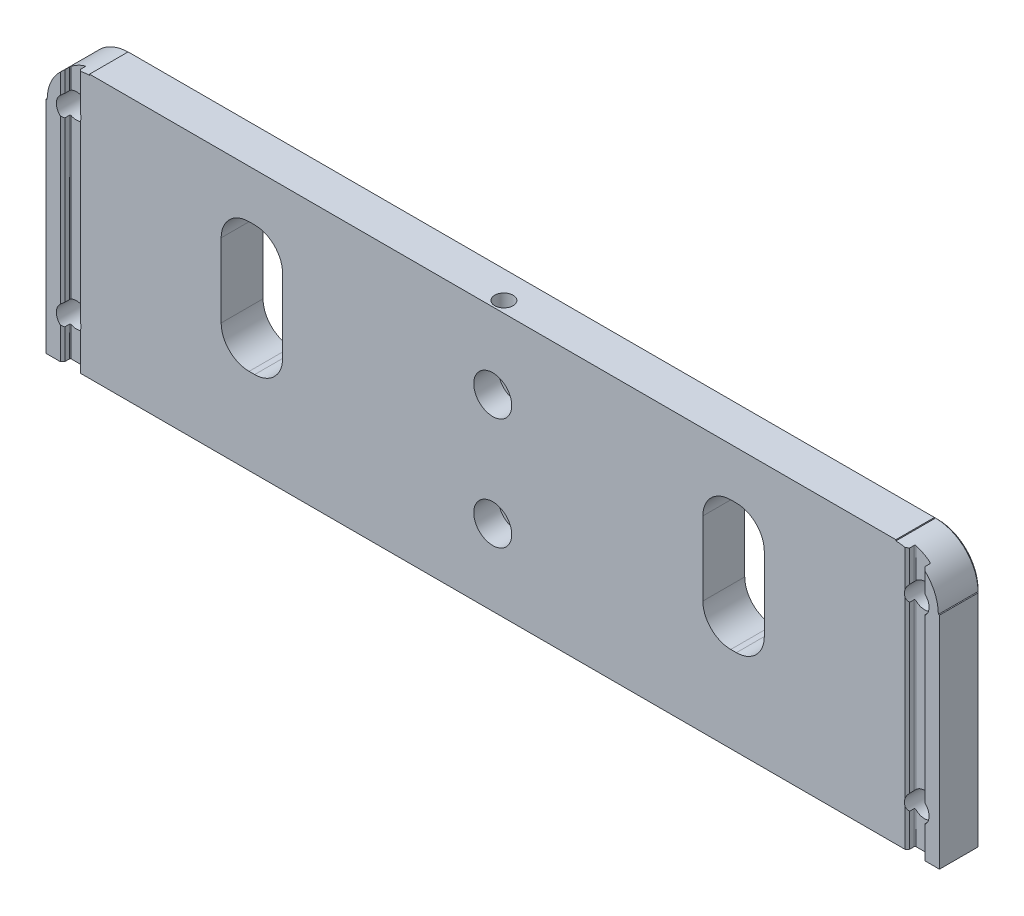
ISO-10303-21;
HEADER;
FILE_DESCRIPTION(('STEP AP214'),'2;1');
FILE_NAME('part.step','',(''),(''),'','','');
FILE_SCHEMA(('AUTOMOTIVE_DESIGN { 1 0 10303 214 1 1 1 1 }'));
ENDSEC;
DATA;
#1=APPLICATION_CONTEXT('core data for automotive mechanical design processes');
#2=APPLICATION_PROTOCOL_DEFINITION('international standard','automotive_design',2000,#1);
#3=PRODUCT_CONTEXT('',#1,'mechanical');
#4=PRODUCT('Part','Part','',(#3));
#5=PRODUCT_RELATED_PRODUCT_CATEGORY('part','',(#4));
#6=PRODUCT_DEFINITION_FORMATION('','',#4);
#7=PRODUCT_DEFINITION_CONTEXT('part definition',#1,'design');
#8=PRODUCT_DEFINITION('design','',#6,#7);
#9=PRODUCT_DEFINITION_SHAPE('','',#8);
#10=(LENGTH_UNIT() NAMED_UNIT(*) SI_UNIT(.MILLI.,.METRE.));
#11=(NAMED_UNIT(*) PLANE_ANGLE_UNIT() SI_UNIT($,.RADIAN.));
#12=(NAMED_UNIT(*) SI_UNIT($,.STERADIAN.) SOLID_ANGLE_UNIT());
#13=UNCERTAINTY_MEASURE_WITH_UNIT(LENGTH_MEASURE(1.E-05),#10,'distance_accuracy_value','');
#14=(GEOMETRIC_REPRESENTATION_CONTEXT(3) GLOBAL_UNCERTAINTY_ASSIGNED_CONTEXT((#13)) GLOBAL_UNIT_ASSIGNED_CONTEXT((#10,
#11,#12)) REPRESENTATION_CONTEXT('',''));
#15=CARTESIAN_POINT('',(0.,0.,0.));
#16=DIRECTION('',(0.,0.,1.));
#17=DIRECTION('',(1.,0.,0.));
#18=AXIS2_PLACEMENT_3D('',#15,#16,#17);
#19=CARTESIAN_POINT('',(-101.5746,-29.972,0.));
#20=DIRECTION('',(0.,0.,1.));
#21=DIRECTION('',(1.,0.,0.));
#22=AXIS2_PLACEMENT_3D('',#19,#20,#21);
#23=PLANE('',#22);
#24=CARTESIAN_POINT('',(91.6686,20.066,0.));
#25=DIRECTION('',(0.,0.,-1.));
#26=DIRECTION('',(-1.,0.,0.));
#27=AXIS2_PLACEMENT_3D('',#24,#25,#26);
#28=CIRCLE('',#27,9.652);
#29=CARTESIAN_POINT('',(98.3234,27.0570472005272,0.));
#30=VERTEX_POINT('',#29);
#31=CARTESIAN_POINT('',(101.3206,20.066,0.));
#32=VERTEX_POINT('',#31);
#33=EDGE_CURVE('E727',#30,#32,#28,.T.);
#34=ORIENTED_EDGE('',*,*,#33,.F.);
#35=DIRECTION('',(0.,-1.,0.));
#36=VECTOR('',#35,1.);
#37=CARTESIAN_POINT('',(98.3234,-29.972,0.));
#38=LINE('',#37,#36);
#39=CARTESIAN_POINT('',(98.3234,22.4908715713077,0.));
#40=VERTEX_POINT('',#39);
#41=EDGE_CURVE('E1279',#30,#40,#38,.T.);
#42=ORIENTED_EDGE('',*,*,#41,.T.);
#43=CARTESIAN_POINT('',(96.4184,20.447,0.));
#44=DIRECTION('',(0.,0.,1.));
#45=DIRECTION('',(1.,0.,0.));
#46=AXIS2_PLACEMENT_3D('',#43,#44,#45);
#47=CIRCLE('',#46,2.794);
#48=CARTESIAN_POINT('',(98.3234,18.4031284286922,0.));
#49=VERTEX_POINT('',#48);
#50=EDGE_CURVE('E669',#49,#40,#47,.T.);
#51=ORIENTED_EDGE('',*,*,#50,.F.);
#52=DIRECTION('',(0.,-1.,0.));
#53=VECTOR('',#52,1.);
#54=CARTESIAN_POINT('',(98.3234,-29.972,0.));
#55=LINE('',#54,#53);
#56=CARTESIAN_POINT('',(98.3234,-18.6571284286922,0.));
#57=VERTEX_POINT('',#56);
#58=EDGE_CURVE('E1273',#49,#57,#55,.T.);
#59=ORIENTED_EDGE('',*,*,#58,.T.);
#60=CARTESIAN_POINT('',(96.4184,-20.701,0.));
#61=DIRECTION('',(0.,0.,1.));
#62=DIRECTION('',(1.,0.,0.));
#63=AXIS2_PLACEMENT_3D('',#60,#61,#62);
#64=CIRCLE('',#63,2.794);
#65=CARTESIAN_POINT('',(98.3234,-22.7448715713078,0.));
#66=VERTEX_POINT('',#65);
#67=EDGE_CURVE('E690',#66,#57,#64,.T.);
#68=ORIENTED_EDGE('',*,*,#67,.F.);
#69=DIRECTION('',(0.,-1.,0.));
#70=VECTOR('',#69,1.);
#71=CARTESIAN_POINT('',(98.3234,-29.972,0.));
#72=LINE('',#71,#70);
#73=CARTESIAN_POINT('',(98.3234,-29.972,0.));
#74=VERTEX_POINT('',#73);
#75=EDGE_CURVE('E1276',#66,#74,#72,.T.);
#76=ORIENTED_EDGE('',*,*,#75,.T.);
#77=DIRECTION('',(1.,0.,0.));
#78=VECTOR('',#77,1.);
#79=CARTESIAN_POINT('',(-101.5746,-29.972,0.));
#80=LINE('',#79,#78);
#81=CARTESIAN_POINT('',(101.5746,-29.972,0.));
#82=VERTEX_POINT('',#81);
#83=EDGE_CURVE('E745',#74,#82,#80,.T.);
#84=ORIENTED_EDGE('',*,*,#83,.T.);
#85=DIRECTION('',(0.,1.,0.));
#86=VECTOR('',#85,1.);
#87=CARTESIAN_POINT('',(101.5746,29.972,0.));
#88=LINE('',#87,#86);
#89=CARTESIAN_POINT('',(101.5746,20.066,0.));
#90=VERTEX_POINT('',#89);
#91=EDGE_CURVE('E749',#82,#90,#88,.T.);
#92=ORIENTED_EDGE('',*,*,#91,.T.);
#93=DIRECTION('',(1.,0.,0.));
#94=VECTOR('',#93,1.);
#95=CARTESIAN_POINT('',(101.3206,20.066,0.));
#96=LINE('',#95,#94);
#97=EDGE_CURVE('E731',#32,#90,#96,.T.);
#98=ORIENTED_EDGE('',*,*,#97,.F.);
#99=EDGE_LOOP('',(#34,#42,#51,#59,#68,#76,#84,#92,#98));
#100=FACE_BOUND('',#99,.T.);
#101=ADVANCED_FACE('F37',(#100),#23,.T.);
#102=DIRECTION('',(0.,1.,0.));
#103=VECTOR('',#102,1.);
#104=CARTESIAN_POINT('',(47.7774,12.7,0.));
#105=LINE('',#104,#103);
#106=CARTESIAN_POINT('',(47.7774,-4.064,0.));
#107=VERTEX_POINT('',#106);
#108=CARTESIAN_POINT('',(47.7774,12.7,0.));
#109=VERTEX_POINT('',#108);
#110=EDGE_CURVE('E582',#107,#109,#105,.T.);
#111=ORIENTED_EDGE('',*,*,#110,.T.);
#112=CARTESIAN_POINT('',(54.1274,12.7,0.));
#113=DIRECTION('',(0.,0.,-1.));
#114=DIRECTION('',(-1.,0.,0.));
#115=AXIS2_PLACEMENT_3D('',#112,#113,#114);
#116=CIRCLE('',#115,6.35);
#117=CARTESIAN_POINT('',(54.1274,19.05,0.));
#118=VERTEX_POINT('',#117);
#119=EDGE_CURVE('E560',#109,#118,#116,.T.);
#120=ORIENTED_EDGE('',*,*,#119,.T.);
#121=DIRECTION('',(1.,0.,0.));
#122=VECTOR('',#121,1.);
#123=CARTESIAN_POINT('',(55.3974,19.05,0.));
#124=LINE('',#123,#122);
#125=CARTESIAN_POINT('',(55.3974,19.05,0.));
#126=VERTEX_POINT('',#125);
#127=EDGE_CURVE('E564',#118,#126,#124,.T.);
#128=ORIENTED_EDGE('',*,*,#127,.T.);
#129=CARTESIAN_POINT('',(55.3974,12.7,0.));
#130=DIRECTION('',(0.,0.,-1.));
#131=DIRECTION('',(-1.,0.,0.));
#132=AXIS2_PLACEMENT_3D('',#129,#130,#131);
#133=CIRCLE('',#132,6.35);
#134=CARTESIAN_POINT('',(61.7474,12.7,0.));
#135=VERTEX_POINT('',#134);
#136=EDGE_CURVE('E597',#126,#135,#133,.T.);
#137=ORIENTED_EDGE('',*,*,#136,.T.);
#138=DIRECTION('',(0.,-1.,0.));
#139=VECTOR('',#138,1.);
#140=CARTESIAN_POINT('',(61.7474,12.7,0.));
#141=LINE('',#140,#139);
#142=CARTESIAN_POINT('',(61.7474,-4.064,0.));
#143=VERTEX_POINT('',#142);
#144=EDGE_CURVE('E594',#135,#143,#141,.T.);
#145=ORIENTED_EDGE('',*,*,#144,.T.);
#146=CARTESIAN_POINT('',(55.3974,-4.064,0.));
#147=DIRECTION('',(0.,0.,-1.));
#148=DIRECTION('',(-1.,0.,0.));
#149=AXIS2_PLACEMENT_3D('',#146,#147,#148);
#150=CIRCLE('',#149,6.35);
#151=CARTESIAN_POINT('',(55.3974,-10.414,0.));
#152=VERTEX_POINT('',#151);
#153=EDGE_CURVE('E591',#143,#152,#150,.T.);
#154=ORIENTED_EDGE('',*,*,#153,.T.);
#155=DIRECTION('',(-1.,0.,0.));
#156=VECTOR('',#155,1.);
#157=CARTESIAN_POINT('',(55.3974,-10.414,0.));
#158=LINE('',#157,#156);
#159=CARTESIAN_POINT('',(54.1274,-10.414,0.));
#160=VERTEX_POINT('',#159);
#161=EDGE_CURVE('E588',#152,#160,#158,.T.);
#162=ORIENTED_EDGE('',*,*,#161,.T.);
#163=CARTESIAN_POINT('',(54.1274,-4.064,0.));
#164=DIRECTION('',(0.,0.,-1.));
#165=DIRECTION('',(-1.,0.,0.));
#166=AXIS2_PLACEMENT_3D('',#163,#164,#165);
#167=CIRCLE('',#166,6.35);
#168=EDGE_CURVE('E585',#160,#107,#167,.T.);
#169=ORIENTED_EDGE('',*,*,#168,.T.);
#170=EDGE_LOOP('',(#111,#120,#128,#137,#145,#154,#162,#169));
#171=FACE_BOUND('',#170,.T.);
#172=CARTESIAN_POINT('',(-54.1274,12.7,0.));
#173=DIRECTION('',(0.,0.,1.));
#174=DIRECTION('',(1.,0.,0.));
#175=AXIS2_PLACEMENT_3D('',#172,#173,#174);
#176=CIRCLE('',#175,6.35);
#177=CARTESIAN_POINT('',(-47.7774,12.7,0.));
#178=VERTEX_POINT('',#177);
#179=CARTESIAN_POINT('',(-54.1274,19.05,0.));
#180=VERTEX_POINT('',#179);
#181=EDGE_CURVE('E605',#178,#180,#176,.T.);
#182=ORIENTED_EDGE('',*,*,#181,.F.);
#183=DIRECTION('',(0.,1.,0.));
#184=VECTOR('',#183,1.);
#185=CARTESIAN_POINT('',(-47.7774,12.7,0.));
#186=LINE('',#185,#184);
#187=CARTESIAN_POINT('',(-47.7774,-4.064,0.));
#188=VERTEX_POINT('',#187);
#189=EDGE_CURVE('E624',#188,#178,#186,.T.);
#190=ORIENTED_EDGE('',*,*,#189,.F.);
#191=CARTESIAN_POINT('',(-54.1274,-4.064,0.));
#192=DIRECTION('',(0.,0.,1.));
#193=DIRECTION('',(1.,0.,0.));
#194=AXIS2_PLACEMENT_3D('',#191,#192,#193);
#195=CIRCLE('',#194,6.35);
#196=CARTESIAN_POINT('',(-54.1274,-10.414,0.));
#197=VERTEX_POINT('',#196);
#198=EDGE_CURVE('E662',#197,#188,#195,.T.);
#199=ORIENTED_EDGE('',*,*,#198,.F.);
#200=DIRECTION('',(1.,0.,0.));
#201=VECTOR('',#200,1.);
#202=CARTESIAN_POINT('',(-55.3974,-10.414,0.));
#203=LINE('',#202,#201);
#204=CARTESIAN_POINT('',(-55.3974,-10.414,0.));
#205=VERTEX_POINT('',#204);
#206=EDGE_CURVE('E659',#205,#197,#203,.T.);
#207=ORIENTED_EDGE('',*,*,#206,.F.);
#208=CARTESIAN_POINT('',(-55.3974,-4.064,0.));
#209=DIRECTION('',(0.,0.,1.));
#210=DIRECTION('',(1.,0.,0.));
#211=AXIS2_PLACEMENT_3D('',#208,#209,#210);
#212=CIRCLE('',#211,6.35);
#213=CARTESIAN_POINT('',(-61.7474,-4.064,0.));
#214=VERTEX_POINT('',#213);
#215=EDGE_CURVE('E656',#214,#205,#212,.T.);
#216=ORIENTED_EDGE('',*,*,#215,.F.);
#217=DIRECTION('',(0.,-1.,0.));
#218=VECTOR('',#217,1.);
#219=CARTESIAN_POINT('',(-61.7474,12.7,0.));
#220=LINE('',#219,#218);
#221=CARTESIAN_POINT('',(-61.7474,12.7,0.));
#222=VERTEX_POINT('',#221);
#223=EDGE_CURVE('E653',#222,#214,#220,.T.);
#224=ORIENTED_EDGE('',*,*,#223,.F.);
#225=CARTESIAN_POINT('',(-55.3974,12.7,0.));
#226=DIRECTION('',(0.,0.,1.));
#227=DIRECTION('',(1.,0.,0.));
#228=AXIS2_PLACEMENT_3D('',#225,#226,#227);
#229=CIRCLE('',#228,6.35);
#230=CARTESIAN_POINT('',(-55.3974,19.05,0.));
#231=VERTEX_POINT('',#230);
#232=EDGE_CURVE('E650',#231,#222,#229,.T.);
#233=ORIENTED_EDGE('',*,*,#232,.F.);
#234=DIRECTION('',(-1.,0.,0.));
#235=VECTOR('',#234,1.);
#236=CARTESIAN_POINT('',(-55.3974,19.05,0.));
#237=LINE('',#236,#235);
#238=EDGE_CURVE('E647',#180,#231,#237,.T.);
#239=ORIENTED_EDGE('',*,*,#238,.F.);
#240=EDGE_LOOP('',(#182,#190,#199,#207,#216,#224,#233,#239));
#241=FACE_BOUND('',#240,.T.);
#242=CARTESIAN_POINT('',(0.,-12.7,0.));
#243=DIRECTION('',(0.,0.,1.));
#244=DIRECTION('',(1.,0.,0.));
#245=AXIS2_PLACEMENT_3D('',#242,#243,#244);
#246=CIRCLE('',#245,4.318);
#247=CARTESIAN_POINT('',(4.318,-12.7,0.));
#248=VERTEX_POINT('',#247);
#249=EDGE_CURVE('E557',#248,#248,#246,.T.);
#250=ORIENTED_EDGE('',*,*,#249,.F.);
#251=EDGE_LOOP('',(#250));
#252=FACE_BOUND('',#251,.T.);
#253=CARTESIAN_POINT('',(0.,12.7,0.));
#254=DIRECTION('',(0.,0.,1.));
#255=DIRECTION('',(1.,0.,0.));
#256=AXIS2_PLACEMENT_3D('',#253,#254,#255);
#257=CIRCLE('',#256,4.318);
#258=CARTESIAN_POINT('',(4.318,12.7,0.));
#259=VERTEX_POINT('',#258);
#260=EDGE_CURVE('E549',#259,#259,#257,.T.);
#261=ORIENTED_EDGE('',*,*,#260,.F.);
#262=EDGE_LOOP('',(#261));
#263=FACE_BOUND('',#262,.T.);
#264=CARTESIAN_POINT('',(93.7514,21.2797946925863,0.));
#265=VERTEX_POINT('',#264);
#266=CARTESIAN_POINT('',(93.7514,19.6142053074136,0.));
#267=VERTEX_POINT('',#266);
#268=EDGE_CURVE('E686',#265,#267,#47,.T.);
#269=ORIENTED_EDGE('',*,*,#268,.F.);
#270=DIRECTION('',(0.,1.,0.));
#271=VECTOR('',#270,1.);
#272=CARTESIAN_POINT('',(93.7514,-29.972,0.));
#273=LINE('',#272,#271);
#274=CARTESIAN_POINT('',(93.7514,29.4905980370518,0.));
#275=VERTEX_POINT('',#274);
#276=EDGE_CURVE('E1244',#265,#275,#273,.T.);
#277=ORIENTED_EDGE('',*,*,#276,.T.);
#278=CARTESIAN_POINT('',(91.6686,29.718,0.));
#279=VERTEX_POINT('',#278);
#280=EDGE_CURVE('E728',#279,#275,#28,.T.);
#281=ORIENTED_EDGE('',*,*,#280,.F.);
#282=DIRECTION('',(0.,-1.,0.));
#283=VECTOR('',#282,1.);
#284=CARTESIAN_POINT('',(91.6686,-29.9719999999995,0.));
#285=LINE('',#284,#283);
#286=CARTESIAN_POINT('',(91.6686,29.972,0.));
#287=VERTEX_POINT('',#286);
#288=EDGE_CURVE('E759',#287,#279,#285,.T.);
#289=ORIENTED_EDGE('',*,*,#288,.F.);
#290=DIRECTION('',(-1.,0.,0.));
#291=VECTOR('',#290,1.);
#292=CARTESIAN_POINT('',(-101.5746,29.972,0.));
#293=LINE('',#292,#291);
#294=CARTESIAN_POINT('',(-91.6686,29.972,0.));
#295=VERTEX_POINT('',#294);
#296=EDGE_CURVE('E753',#287,#295,#293,.T.);
#297=ORIENTED_EDGE('',*,*,#296,.T.);
#298=DIRECTION('',(0.,-1.,0.));
#299=VECTOR('',#298,1.);
#300=CARTESIAN_POINT('',(-91.6686,-29.972,0.));
#301=LINE('',#300,#299);
#302=CARTESIAN_POINT('',(-91.6686,29.718,0.));
#303=VERTEX_POINT('',#302);
#304=EDGE_CURVE('E763',#295,#303,#301,.T.);
#305=ORIENTED_EDGE('',*,*,#304,.T.);
#306=CARTESIAN_POINT('',(-91.6686,20.066,0.));
#307=DIRECTION('',(0.,0.,1.));
#308=DIRECTION('',(1.,0.,0.));
#309=AXIS2_PLACEMENT_3D('',#306,#307,#308);
#310=CIRCLE('',#309,9.652);
#311=CARTESIAN_POINT('',(-93.7514,29.4905980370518,0.));
#312=VERTEX_POINT('',#311);
#313=EDGE_CURVE('E715',#303,#312,#310,.T.);
#314=ORIENTED_EDGE('',*,*,#313,.T.);
#315=DIRECTION('',(0.,-1.,0.));
#316=VECTOR('',#315,1.);
#317=CARTESIAN_POINT('',(-93.7514,22.2204584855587,0.));
#318=LINE('',#317,#316);
#319=CARTESIAN_POINT('',(-93.7514,21.2797946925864,0.));
#320=VERTEX_POINT('',#319);
#321=EDGE_CURVE('E1079',#312,#320,#318,.T.);
#322=ORIENTED_EDGE('',*,*,#321,.T.);
#323=CARTESIAN_POINT('',(-96.4184,20.447,0.));
#324=DIRECTION('',(0.,0.,1.));
#325=DIRECTION('',(1.,0.,0.));
#326=AXIS2_PLACEMENT_3D('',#323,#324,#325);
#327=CIRCLE('',#326,2.794);
#328=CARTESIAN_POINT('',(-93.7514,19.6142053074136,0.));
#329=VERTEX_POINT('',#328);
#330=EDGE_CURVE('E697',#329,#320,#327,.T.);
#331=ORIENTED_EDGE('',*,*,#330,.F.);
#332=DIRECTION('',(0.,-1.,0.));
#333=VECTOR('',#332,1.);
#334=CARTESIAN_POINT('',(-93.7514,-18.9275415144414,0.));
#335=LINE('',#334,#333);
#336=CARTESIAN_POINT('',(-93.7514,-19.8682053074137,0.));
#337=VERTEX_POINT('',#336);
#338=EDGE_CURVE('E2331',#329,#337,#335,.T.);
#339=ORIENTED_EDGE('',*,*,#338,.T.);
#340=CARTESIAN_POINT('',(-96.4184,-20.701,0.));
#341=DIRECTION('',(0.,0.,1.));
#342=DIRECTION('',(1.,0.,0.));
#343=AXIS2_PLACEMENT_3D('',#340,#341,#342);
#344=CIRCLE('',#343,2.794);
#345=CARTESIAN_POINT('',(-93.7514,-21.5337946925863,0.));
#346=VERTEX_POINT('',#345);
#347=EDGE_CURVE('E704',#346,#337,#344,.T.);
#348=ORIENTED_EDGE('',*,*,#347,.F.);
#349=DIRECTION('',(0.,-1.,0.));
#350=VECTOR('',#349,1.);
#351=CARTESIAN_POINT('',(-93.7514,-29.972,0.));
#352=LINE('',#351,#350);
#353=CARTESIAN_POINT('',(-93.7514,-29.972,0.));
#354=VERTEX_POINT('',#353);
#355=EDGE_CURVE('E1453',#346,#354,#352,.T.);
#356=ORIENTED_EDGE('',*,*,#355,.T.);
#357=CARTESIAN_POINT('',(93.7514,-29.972,0.));
#358=VERTEX_POINT('',#357);
#359=EDGE_CURVE('E750',#354,#358,#80,.T.);
#360=ORIENTED_EDGE('',*,*,#359,.T.);
#361=DIRECTION('',(0.,1.,0.));
#362=VECTOR('',#361,1.);
#363=CARTESIAN_POINT('',(93.7514,-29.972,0.));
#364=LINE('',#363,#362);
#365=CARTESIAN_POINT('',(93.7514,-21.5337946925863,0.));
#366=VERTEX_POINT('',#365);
#367=EDGE_CURVE('E1256',#358,#366,#364,.T.);
#368=ORIENTED_EDGE('',*,*,#367,.T.);
#369=CARTESIAN_POINT('',(93.7514,-19.8682053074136,0.));
#370=VERTEX_POINT('',#369);
#371=EDGE_CURVE('E693',#370,#366,#64,.T.);
#372=ORIENTED_EDGE('',*,*,#371,.F.);
#373=DIRECTION('',(0.,1.,0.));
#374=VECTOR('',#373,1.);
#375=CARTESIAN_POINT('',(93.7514,-29.972,0.));
#376=LINE('',#375,#374);
#377=EDGE_CURVE('E1247',#370,#267,#376,.T.);
#378=ORIENTED_EDGE('',*,*,#377,.T.);
#379=EDGE_LOOP('',(#269,#277,#281,#289,#297,#305,#314,#322,#331,#339,#348,#356,#360,#368,#372,#378));
#380=FACE_BOUND('',#379,.T.);
#381=ADVANCED_FACE('F1097',(#171,#241,#252,#263,#380),#23,.T.);
#382=CARTESIAN_POINT('',(-101.5746,-29.972,-9.525));
#383=DIRECTION('',(0.,-1.,0.));
#384=DIRECTION('',(0.,0.,-1.));
#385=AXIS2_PLACEMENT_3D('',#382,#383,#384);
#386=PLANE('',#385);
#387=DIRECTION('',(0.,0.,1.));
#388=VECTOR('',#387,1.);
#389=CARTESIAN_POINT('',(-101.5746,-29.972,-9.525));
#390=LINE('',#389,#388);
#391=CARTESIAN_POINT('',(-101.5746,-29.972,-8.763));
#392=VERTEX_POINT('',#391);
#393=CARTESIAN_POINT('',(-101.5746,-29.972,0.));
#394=VERTEX_POINT('',#393);
#395=EDGE_CURVE('E756',#392,#394,#390,.T.);
#396=ORIENTED_EDGE('',*,*,#395,.F.);
#397=DIRECTION('',(1.,0.,0.));
#398=VECTOR('',#397,1.);
#399=CARTESIAN_POINT('',(101.5746,-29.972,-8.763));
#400=LINE('',#399,#398);
#401=CARTESIAN_POINT('',(101.5746,-29.972,-8.763));
#402=VERTEX_POINT('',#401);
#403=EDGE_CURVE('E1196',#392,#402,#400,.T.);
#404=ORIENTED_EDGE('',*,*,#403,.T.);
#405=DIRECTION('',(0.,0.,1.));
#406=VECTOR('',#405,1.);
#407=CARTESIAN_POINT('',(101.5746,-29.972,-9.525));
#408=LINE('',#407,#406);
#409=EDGE_CURVE('E757',#402,#82,#408,.T.);
#410=ORIENTED_EDGE('',*,*,#409,.T.);
#411=ORIENTED_EDGE('',*,*,#83,.F.);
#412=DIRECTION('',(0.707106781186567,0.,0.707106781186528));
#413=VECTOR('',#412,1.);
#414=CARTESIAN_POINT('',(-6.38810000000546,-29.972,-104.7115));
#415=LINE('',#414,#413);
#416=CARTESIAN_POINT('',(97.8154,-29.972,-0.507999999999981));
#417=VERTEX_POINT('',#416);
#418=EDGE_CURVE('E1289',#74,#417,#415,.F.);
#419=ORIENTED_EDGE('',*,*,#418,.T.);
#420=DIRECTION('',(0.,0.,-1.));
#421=VECTOR('',#420,1.);
#422=CARTESIAN_POINT('',(97.8154,-29.972,-9.525));
#423=LINE('',#422,#421);
#424=CARTESIAN_POINT('',(97.8154,-29.972,-1.5748));
#425=VERTEX_POINT('',#424);
#426=EDGE_CURVE('E1394',#417,#425,#423,.T.);
#427=ORIENTED_EDGE('',*,*,#426,.T.);
#428=CARTESIAN_POINT('',(97.6122,-29.972,-1.5748));
#429=DIRECTION('',(0.,-1.,0.));
#430=DIRECTION('',(0.,0.,-1.));
#431=AXIS2_PLACEMENT_3D('',#428,#429,#430);
#432=CIRCLE('',#431,0.2032);
#433=CARTESIAN_POINT('',(97.6122,-29.972,-1.778));
#434=VERTEX_POINT('',#433);
#435=EDGE_CURVE('E858',#425,#434,#432,.F.);
#436=ORIENTED_EDGE('',*,*,#435,.T.);
#437=DIRECTION('',(-1.,0.,0.));
#438=VECTOR('',#437,1.);
#439=CARTESIAN_POINT('',(-101.5746,-29.972,-1.778));
#440=LINE('',#439,#438);
#441=CARTESIAN_POINT('',(94.4626,-29.972,-1.778));
#442=VERTEX_POINT('',#441);
#443=EDGE_CURVE('E1416',#434,#442,#440,.T.);
#444=ORIENTED_EDGE('',*,*,#443,.T.);
#445=CARTESIAN_POINT('',(94.4626,-29.972,-1.5748));
#446=DIRECTION('',(0.,-1.,0.));
#447=DIRECTION('',(0.,0.,-1.));
#448=AXIS2_PLACEMENT_3D('',#445,#446,#447);
#449=CIRCLE('',#448,0.2032);
#450=CARTESIAN_POINT('',(94.2594,-29.972,-1.5748));
#451=VERTEX_POINT('',#450);
#452=EDGE_CURVE('E970',#442,#451,#449,.F.);
#453=ORIENTED_EDGE('',*,*,#452,.T.);
#454=DIRECTION('',(0.,0.,1.));
#455=VECTOR('',#454,1.);
#456=CARTESIAN_POINT('',(94.2594,-29.972,-9.525));
#457=LINE('',#456,#455);
#458=CARTESIAN_POINT('',(94.2594,-29.972,-0.50800000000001));
#459=VERTEX_POINT('',#458);
#460=EDGE_CURVE('E1405',#451,#459,#457,.T.);
#461=ORIENTED_EDGE('',*,*,#460,.T.);
#462=DIRECTION('',(0.707106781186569,0.,-0.707106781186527));
#463=VECTOR('',#462,1.);
#464=CARTESIAN_POINT('',(0.850899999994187,-29.972,92.9005));
#465=LINE('',#464,#463);
#466=EDGE_CURVE('E1287',#459,#358,#465,.F.);
#467=ORIENTED_EDGE('',*,*,#466,.T.);
#468=ORIENTED_EDGE('',*,*,#359,.F.);
#469=DIRECTION('',(-0.707106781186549,0.,-0.707106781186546));
#470=VECTOR('',#469,1.);
#471=CARTESIAN_POINT('',(-102.4255,-29.972,-8.6741));
#472=LINE('',#471,#470);
#473=CARTESIAN_POINT('',(-94.2594,-29.972,-0.508000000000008));
#474=VERTEX_POINT('',#473);
#475=EDGE_CURVE('E1284',#354,#474,#472,.T.);
#476=ORIENTED_EDGE('',*,*,#475,.T.);
#477=DIRECTION('',(0.,0.,1.));
#478=VECTOR('',#477,1.);
#479=CARTESIAN_POINT('',(-94.2594,-29.972,-9.525));
#480=LINE('',#479,#478);
#481=CARTESIAN_POINT('',(-94.2594,-29.972,-1.5748));
#482=VERTEX_POINT('',#481);
#483=EDGE_CURVE('E1355',#482,#474,#480,.T.);
#484=ORIENTED_EDGE('',*,*,#483,.F.);
#485=CARTESIAN_POINT('',(-94.4626,-29.972,-1.5748));
#486=DIRECTION('',(0.,-1.,0.));
#487=DIRECTION('',(0.,0.,-1.));
#488=AXIS2_PLACEMENT_3D('',#485,#486,#487);
#489=CIRCLE('',#488,0.2032);
#490=CARTESIAN_POINT('',(-94.4626,-29.972,-1.778));
#491=VERTEX_POINT('',#490);
#492=EDGE_CURVE('E979',#482,#491,#489,.F.);
#493=ORIENTED_EDGE('',*,*,#492,.T.);
#494=DIRECTION('',(-1.,0.,0.));
#495=VECTOR('',#494,1.);
#496=CARTESIAN_POINT('',(-101.5746,-29.972,-1.778));
#497=LINE('',#496,#495);
#498=CARTESIAN_POINT('',(-97.6122,-29.972,-1.778));
#499=VERTEX_POINT('',#498);
#500=EDGE_CURVE('E1339',#491,#499,#497,.T.);
#501=ORIENTED_EDGE('',*,*,#500,.T.);
#502=CARTESIAN_POINT('',(-97.6122,-29.972,-1.5748));
#503=DIRECTION('',(0.,-1.,0.));
#504=DIRECTION('',(0.,0.,-1.));
#505=AXIS2_PLACEMENT_3D('',#502,#503,#504);
#506=CIRCLE('',#505,0.2032);
#507=CARTESIAN_POINT('',(-97.8154,-29.972,-1.5748));
#508=VERTEX_POINT('',#507);
#509=EDGE_CURVE('E1040',#499,#508,#506,.F.);
#510=ORIENTED_EDGE('',*,*,#509,.T.);
#511=DIRECTION('',(0.,0.,-1.));
#512=VECTOR('',#511,1.);
#513=CARTESIAN_POINT('',(-97.8154,-29.972,-9.525));
#514=LINE('',#513,#512);
#515=CARTESIAN_POINT('',(-97.8154,-29.972,-0.507999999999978));
#516=VERTEX_POINT('',#515);
#517=EDGE_CURVE('E531',#516,#508,#514,.T.);
#518=ORIENTED_EDGE('',*,*,#517,.F.);
#519=DIRECTION('',(-0.707106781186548,0.,0.707106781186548));
#520=VECTOR('',#519,1.);
#521=CARTESIAN_POINT('',(-95.1865,-29.972,-3.1369));
#522=LINE('',#521,#520);
#523=CARTESIAN_POINT('',(-98.3234,-29.972,0.));
#524=VERTEX_POINT('',#523);
#525=EDGE_CURVE('E1126',#516,#524,#522,.T.);
#526=ORIENTED_EDGE('',*,*,#525,.T.);
#527=EDGE_CURVE('E746',#394,#524,#80,.T.);
#528=ORIENTED_EDGE('',*,*,#527,.F.);
#529=EDGE_LOOP('',(#396,#404,#410,#411,#419,#427,#436,#444,#453,#461,#467,#468,#476,#484,#493,
#501,#510,#518,#526,#528));
#530=FACE_BOUND('',#529,.T.);
#531=ADVANCED_FACE('F1103',(#530),#386,.T.);
#532=CARTESIAN_POINT('',(91.6686,20.066,-9.525));
#533=DIRECTION('',(0.,0.,1.));
#534=DIRECTION('',(1.,0.,0.));
#535=AXIS2_PLACEMENT_3D('',#532,#533,#534);
#536=CYLINDRICAL_SURFACE('',#535,9.652);
#537=DIRECTION('',(0.,0.,1.));
#538=VECTOR('',#537,1.);
#539=CARTESIAN_POINT('',(101.3206,20.066,-9.525));
#540=LINE('',#539,#538);
#541=CARTESIAN_POINT('',(101.3206,20.066,-9.017));
#542=VERTEX_POINT('',#541);
#543=EDGE_CURVE('E734',#542,#32,#540,.T.);
#544=ORIENTED_EDGE('',*,*,#543,.F.);
#545=CARTESIAN_POINT('',(91.6686,20.066,-9.017));
#546=DIRECTION('',(0.,0.,1.));
#547=DIRECTION('',(1.,0.,0.));
#548=AXIS2_PLACEMENT_3D('',#545,#546,#547);
#549=CIRCLE('',#548,9.652);
#550=CARTESIAN_POINT('',(91.6686,29.718,-9.017));
#551=VERTEX_POINT('',#550);
#552=EDGE_CURVE('E12',#542,#551,#549,.T.);
#553=ORIENTED_EDGE('',*,*,#552,.T.);
#554=DIRECTION('',(0.,0.,1.));
#555=VECTOR('',#554,1.);
#556=CARTESIAN_POINT('',(91.6686,29.718,-9.525));
#557=LINE('',#556,#555);
#558=EDGE_CURVE('E733',#551,#279,#557,.T.);
#559=ORIENTED_EDGE('',*,*,#558,.T.);
#560=ORIENTED_EDGE('',*,*,#280,.T.);
#561=CARTESIAN_POINT('',(91.6686,20.066,2.08279999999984));
#562=DIRECTION('',(-0.707106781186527,0.,-0.707106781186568));
#563=DIRECTION('',(-0.707106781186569,0.,0.707106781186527));
#564=AXIS2_PLACEMENT_3D('',#561,#562,#563);
#565=ELLIPSE('',#564,13.6499893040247,9.652);
#566=CARTESIAN_POINT('',(94.2594,29.363787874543,-0.507999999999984));
#567=VERTEX_POINT('',#566);
#568=EDGE_CURVE('E1254',#275,#567,#565,.T.);
#569=ORIENTED_EDGE('',*,*,#568,.T.);
#570=DIRECTION('',(0.,0.,1.));
#571=VECTOR('',#570,1.);
#572=CARTESIAN_POINT('',(94.2594,29.363787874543,-9.525));
#573=LINE('',#572,#571);
#574=CARTESIAN_POINT('',(94.2594,29.363787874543,-1.5748));
#575=VERTEX_POINT('',#574);
#576=EDGE_CURVE('E1408',#575,#567,#573,.T.);
#577=ORIENTED_EDGE('',*,*,#576,.F.);
#578=CARTESIAN_POINT('',(94.2594,29.363787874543,-1.5748));
#579=CARTESIAN_POINT('',(94.2593889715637,29.3637903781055,-1.58592168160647));
#580=CARTESIAN_POINT('',(94.2603123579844,29.3635336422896,-1.59703818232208));
#581=CARTESIAN_POINT('',(94.2639439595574,29.3625208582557,-1.61893295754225));
#582=CARTESIAN_POINT('',(94.2666490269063,29.3617656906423,-1.62971179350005));
#583=CARTESIAN_POINT('',(94.2737610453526,29.3597749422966,-1.65064627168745));
#584=CARTESIAN_POINT('',(94.2781682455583,29.358539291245,-1.66080182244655));
#585=CARTESIAN_POINT('',(94.2885347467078,29.3556218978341,-1.68021618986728));
#586=CARTESIAN_POINT('',(94.294494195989,29.3539401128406,-1.68947492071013));
#587=CARTESIAN_POINT('',(94.3078769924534,29.3501461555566,-1.70699051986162));
#588=CARTESIAN_POINT('',(94.3153208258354,29.348027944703,-1.71523040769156));
#589=CARTESIAN_POINT('',(94.3313873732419,29.3434316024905,-1.73034809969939));
#590=CARTESIAN_POINT('',(94.3400103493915,29.3409533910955,-1.73722560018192));
#591=CARTESIAN_POINT('',(94.358506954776,29.3356062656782,-1.74968147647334));
#592=CARTESIAN_POINT('',(94.3684138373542,29.3327266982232,-1.7552058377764));
#593=CARTESIAN_POINT('',(94.3889441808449,29.3267205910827,-1.76451580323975));
#594=CARTESIAN_POINT('',(94.3995676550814,29.3235940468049,-1.76830137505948));
#595=CARTESIAN_POINT('',(94.4189353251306,29.3178559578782,-1.77344955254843));
#596=CARTESIAN_POINT('',(94.4275994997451,29.3152760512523,-1.77515598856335));
#597=CARTESIAN_POINT('',(94.4450432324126,29.3100549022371,-1.77743122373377));
#598=CARTESIAN_POINT('',(94.4538225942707,29.3074137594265,-1.77800175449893));
#599=CARTESIAN_POINT('',(94.4626,29.3047590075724,-1.778));
#600=B_SPLINE_CURVE_WITH_KNOTS('',3,(#578,#579,#580,#581,#582,#583,#584,#585,#586,#587,#588,
#589,#590,#591,#592,#593,#594,#595,#596,#597,#598,#599),.UNSPECIFIED.,.F.,.F.,(4,2,2,2,2,2,2,2,
2,2,4),(0.,0.0333159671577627,0.0665732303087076,0.0998353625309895,0.133100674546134,
0.166861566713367,0.200629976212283,0.235582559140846,0.270535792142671,0.29806608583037,
0.325554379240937),.UNSPECIFIED.);
#601=CARTESIAN_POINT('',(94.4626,29.3047590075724,-1.778));
#602=VERTEX_POINT('',#601);
#603=EDGE_CURVE('E931',#575,#602,#600,.T.);
#604=ORIENTED_EDGE('',*,*,#603,.T.);
#605=CARTESIAN_POINT('',(91.6686,20.066,-1.778));
#606=DIRECTION('',(0.,0.,1.));
#607=DIRECTION('',(1.,0.,0.));
#608=AXIS2_PLACEMENT_3D('',#605,#606,#607);
#609=CIRCLE('',#608,9.652);
#610=CARTESIAN_POINT('',(97.6122,27.6709144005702,-1.778));
#611=VERTEX_POINT('',#610);
#612=EDGE_CURVE('E1419',#611,#602,#609,.T.);
#613=ORIENTED_EDGE('',*,*,#612,.F.);
#614=CARTESIAN_POINT('',(97.6122,27.6709144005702,-1.778));
#615=CARTESIAN_POINT('',(97.6257198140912,27.6603502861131,-1.77799116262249));
#616=CARTESIAN_POINT('',(97.6392260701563,27.6497342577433,-1.77664930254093));
#617=CARTESIAN_POINT('',(97.6659259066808,27.6286363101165,-1.77124719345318));
#618=CARTESIAN_POINT('',(97.6791170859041,27.6181555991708,-1.76717046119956));
#619=CARTESIAN_POINT('',(97.7031630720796,27.5989517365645,-1.75691287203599));
#620=CARTESIAN_POINT('',(97.7141064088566,27.590170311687,-1.75104999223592));
#621=CARTESIAN_POINT('',(97.7350629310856,27.5732838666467,-1.73713486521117));
#622=CARTESIAN_POINT('',(97.7450782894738,27.5651772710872,-1.7290879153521));
#623=CARTESIAN_POINT('',(97.7617091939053,27.5516671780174,-1.71279031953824));
#624=CARTESIAN_POINT('',(97.7685874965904,27.5460617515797,-1.70497565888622));
#625=CARTESIAN_POINT('',(97.7812698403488,27.5357013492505,-1.68801391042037));
#626=CARTESIAN_POINT('',(97.787074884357,27.5309455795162,-1.67886808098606));
#627=CARTESIAN_POINT('',(97.7964215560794,27.5232741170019,-1.66103228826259));
#628=CARTESIAN_POINT('',(97.8001805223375,27.5201828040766,-1.65253218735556));
#629=CARTESIAN_POINT('',(97.806551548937,27.5149376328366,-1.63484716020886));
#630=CARTESIAN_POINT('',(97.8091657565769,27.5127820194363,-1.62566355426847));
#631=CARTESIAN_POINT('',(97.8125315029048,27.5100051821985,-1.60951253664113));
#632=CARTESIAN_POINT('',(97.8136009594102,27.5091222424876,-1.60265463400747));
#633=CARTESIAN_POINT('',(97.815038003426,27.5079355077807,-1.58880015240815));
#634=CARTESIAN_POINT('',(97.8154039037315,27.5076331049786,-1.58180328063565));
#635=CARTESIAN_POINT('',(97.8154,27.507636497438,-1.5748));
#636=B_SPLINE_CURVE_WITH_KNOTS('',3,(#614,#615,#616,#617,#618,#619,#620,#621,#622,#623,#624,
#625,#626,#627,#628,#629,#630,#631,#632,#633,#634,#635),.UNSPECIFIED.,.F.,.F.,(4,2,2,2,2,2,2,2,
2,2,4),(0.,0.0514588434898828,0.103230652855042,0.148676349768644,0.194012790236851,
0.229354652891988,0.264663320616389,0.293929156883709,0.32313985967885,0.344072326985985,
0.365054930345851),.UNSPECIFIED.);
#637=CARTESIAN_POINT('',(97.8154,27.507636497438,-1.5748));
#638=VERTEX_POINT('',#637);
#639=EDGE_CURVE('E1487',#611,#638,#636,.T.);
#640=ORIENTED_EDGE('',*,*,#639,.T.);
#641=DIRECTION('',(0.,0.,1.));
#642=VECTOR('',#641,1.);
#643=CARTESIAN_POINT('',(97.8154,27.507636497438,-9.525));
#644=LINE('',#643,#642);
#645=CARTESIAN_POINT('',(97.8154,27.507636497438,-0.507999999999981));
#646=VERTEX_POINT('',#645);
#647=EDGE_CURVE('E1395',#646,#638,#644,.F.);
#648=ORIENTED_EDGE('',*,*,#647,.F.);
#649=CARTESIAN_POINT('',(91.6686,20.066,-6.65479999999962));
#650=DIRECTION('',(0.707106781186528,0.,-0.707106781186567));
#651=DIRECTION('',(0.707106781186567,0.,0.707106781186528));
#652=AXIS2_PLACEMENT_3D('',#649,#650,#651);
#653=ELLIPSE('',#652,13.6499893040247,9.652);
#654=EDGE_CURVE('E1255',#646,#30,#653,.T.);
#655=ORIENTED_EDGE('',*,*,#654,.T.);
#656=ORIENTED_EDGE('',*,*,#33,.T.);
#657=EDGE_LOOP('',(#544,#553,#559,#560,#569,#577,#604,#613,#640,#648,#655,#656));
#658=FACE_BOUND('',#657,.T.);
#659=ADVANCED_FACE('F1494',(#658),#536,.T.);
#660=CARTESIAN_POINT('',(96.4184,-20.701,0.));
#661=DIRECTION('',(0.,0.,1.));
#662=DIRECTION('',(1.,0.,0.));
#663=AXIS2_PLACEMENT_3D('',#660,#661,#662);
#664=CYLINDRICAL_SURFACE('',#663,2.794);
#665=CARTESIAN_POINT('',(96.4184,-20.701,-9.525));
#666=DIRECTION('',(0.,0.,1.));
#667=DIRECTION('',(1.,0.,0.));
#668=AXIS2_PLACEMENT_3D('',#665,#666,#667);
#669=CIRCLE('',#668,2.794);
#670=CARTESIAN_POINT('',(99.2124,-20.701,-9.525));
#671=VERTEX_POINT('',#670);
#672=EDGE_CURVE('E694',#671,#671,#669,.T.);
#673=ORIENTED_EDGE('',*,*,#672,.F.);
#674=EDGE_LOOP('',(#673));
#675=FACE_BOUND('',#674,.T.);
#676=DIRECTION('',(0.,0.,1.));
#677=VECTOR('',#676,1.);
#678=CARTESIAN_POINT('',(97.8154,-23.1206749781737,0.));
#679=LINE('',#678,#677);
#680=CARTESIAN_POINT('',(97.8154,-23.1206749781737,-0.507999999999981));
#681=VERTEX_POINT('',#680);
#682=CARTESIAN_POINT('',(97.8154,-23.1206749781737,-1.5748));
#683=VERTEX_POINT('',#682);
#684=EDGE_CURVE('E1398',#681,#683,#679,.F.);
#685=ORIENTED_EDGE('',*,*,#684,.F.);
#686=CARTESIAN_POINT('',(96.4184,-20.701,-1.90499999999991));
#687=DIRECTION('',(0.707106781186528,0.,-0.707106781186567));
#688=DIRECTION('',(0.707106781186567,0.,0.707106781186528));
#689=AXIS2_PLACEMENT_3D('',#686,#687,#688);
#690=ELLIPSE('',#689,3.95131269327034,2.794);
#691=EDGE_CURVE('E1299',#681,#66,#690,.F.);
#692=ORIENTED_EDGE('',*,*,#691,.T.);
#693=ORIENTED_EDGE('',*,*,#67,.T.);
#694=CARTESIAN_POINT('',(96.4184,-20.701,-1.90499999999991));
#695=DIRECTION('',(0.707106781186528,0.,-0.707106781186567));
#696=DIRECTION('',(0.707106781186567,0.,0.707106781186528));
#697=AXIS2_PLACEMENT_3D('',#694,#695,#696);
#698=ELLIPSE('',#697,3.95131269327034,2.794);
#699=CARTESIAN_POINT('',(97.8154,-18.2813250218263,-0.507999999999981));
#700=VERTEX_POINT('',#699);
#701=EDGE_CURVE('E1293',#57,#700,#698,.F.);
#702=ORIENTED_EDGE('',*,*,#701,.T.);
#703=DIRECTION('',(0.,0.,1.));
#704=VECTOR('',#703,1.);
#705=CARTESIAN_POINT('',(97.8154,-18.2813250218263,0.));
#706=LINE('',#705,#704);
#707=CARTESIAN_POINT('',(97.8154,-18.2813250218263,-1.5748));
#708=VERTEX_POINT('',#707);
#709=EDGE_CURVE('E1402',#708,#700,#706,.T.);
#710=ORIENTED_EDGE('',*,*,#709,.F.);
#711=CARTESIAN_POINT('',(97.8154,-18.2813250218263,-1.5748));
#712=CARTESIAN_POINT('',(97.8154133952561,-18.2813346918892,-1.58519090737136));
#713=CARTESIAN_POINT('',(97.8146039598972,-18.2808654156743,-1.59556871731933));
#714=CARTESIAN_POINT('',(97.8114496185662,-18.279047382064,-1.61596172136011));
#715=CARTESIAN_POINT('',(97.8091118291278,-18.2777027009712,-1.62597837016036));
#716=CARTESIAN_POINT('',(97.8030123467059,-18.2742127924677,-1.64540390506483));
#717=CARTESIAN_POINT('',(97.7992521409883,-18.2720684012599,-1.65481341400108));
#718=CARTESIAN_POINT('',(97.7904698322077,-18.2670965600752,-1.67283381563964));
#719=CARTESIAN_POINT('',(97.7854465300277,-18.2642684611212,-1.68144393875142));
#720=CARTESIAN_POINT('',(97.7739970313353,-18.2578794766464,-1.69817148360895));
#721=CARTESIAN_POINT('',(97.7675070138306,-18.2542859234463,-1.7062325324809));
#722=CARTESIAN_POINT('',(97.7535217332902,-18.2466264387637,-1.72116657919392));
#723=CARTESIAN_POINT('',(97.7460261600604,-18.2425603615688,-1.72803920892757));
#724=CARTESIAN_POINT('',(97.7292182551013,-18.2335532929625,-1.74131015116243));
#725=CARTESIAN_POINT('',(97.7197960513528,-18.2285666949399,-1.74753843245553));
#726=CARTESIAN_POINT('',(97.7001631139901,-18.2183316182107,-1.75831649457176));
#727=CARTESIAN_POINT('',(97.6899518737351,-18.2130829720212,-1.7628651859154));
#728=CARTESIAN_POINT('',(97.6686656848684,-18.20231695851,-1.77033188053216));
#729=CARTESIAN_POINT('',(97.6575741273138,-18.1967962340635,-1.77319770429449));
#730=CARTESIAN_POINT('',(97.6350683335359,-18.1857833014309,-1.77703170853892));
#731=CARTESIAN_POINT('',(97.6236544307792,-18.1802910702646,-1.77800178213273));
#732=CARTESIAN_POINT('',(97.6122,-18.1748809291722,-1.778));
#733=B_SPLINE_CURVE_WITH_KNOTS('',3,(#711,#712,#713,#714,#715,#716,#717,#718,#719,#720,#721,
#722,#723,#724,#725,#726,#727,#728,#729,#730,#731,#732),.UNSPECIFIED.,.F.,.F.,(4,2,2,2,2,2,2,2,
2,2,4),(0.,0.0311100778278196,0.0620763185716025,0.0930102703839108,0.123973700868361,
0.156708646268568,0.189453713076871,0.226341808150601,0.263253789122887,0.301256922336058,
0.339222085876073),.UNSPECIFIED.);
#734=CARTESIAN_POINT('',(97.6122,-18.1748809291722,-1.778));
#735=VERTEX_POINT('',#734);
#736=EDGE_CURVE('E869',#708,#735,#733,.T.);
#737=ORIENTED_EDGE('',*,*,#736,.T.);
#738=CARTESIAN_POINT('',(96.4184,-20.701,-1.778));
#739=DIRECTION('',(0.,0.,1.));
#740=DIRECTION('',(1.,0.,0.));
#741=AXIS2_PLACEMENT_3D('',#738,#739,#740);
#742=CIRCLE('',#741,2.794);
#743=CARTESIAN_POINT('',(94.4626,-18.7056848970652,-1.778));
#744=VERTEX_POINT('',#743);
#745=EDGE_CURVE('E1205',#744,#735,#742,.F.);
#746=ORIENTED_EDGE('',*,*,#745,.F.);
#747=CARTESIAN_POINT('',(94.4626,-18.7056848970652,-1.778));
#748=CARTESIAN_POINT('',(94.4464935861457,-18.7214558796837,-1.77795719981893));
#749=CARTESIAN_POINT('',(94.4305726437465,-18.7374593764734,-1.77608135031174));
#750=CARTESIAN_POINT('',(94.3993983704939,-18.7695354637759,-1.76860409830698));
#751=CARTESIAN_POINT('',(94.3841525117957,-18.785607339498,-1.76296864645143));
#752=CARTESIAN_POINT('',(94.3585100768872,-18.8132613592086,-1.74975360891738));
#753=CARTESIAN_POINT('',(94.3478394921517,-18.8249801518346,-1.74298668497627));
#754=CARTESIAN_POINT('',(94.3275064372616,-18.8476708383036,-1.72713461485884));
#755=CARTESIAN_POINT('',(94.3178407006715,-18.8586451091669,-1.71805733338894));
#756=CARTESIAN_POINT('',(94.3030040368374,-18.8757281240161,-1.7008956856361));
#757=CARTESIAN_POINT('',(94.2974283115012,-18.8822149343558,-1.69353808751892));
#758=CARTESIAN_POINT('',(94.2870876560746,-18.8943437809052,-1.67763661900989));
#759=CARTESIAN_POINT('',(94.2823218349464,-18.8999867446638,-1.66909407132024));
#760=CARTESIAN_POINT('',(94.2748625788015,-18.9088758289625,-1.65293254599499));
#761=CARTESIAN_POINT('',(94.2719447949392,-18.9123744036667,-1.64555751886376));
#762=CARTESIAN_POINT('',(94.2669251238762,-18.9184155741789,-1.63017744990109));
#763=CARTESIAN_POINT('',(94.2648208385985,-18.9209609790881,-1.62217434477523));
#764=CARTESIAN_POINT('',(94.2619660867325,-18.9244210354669,-1.60762499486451));
#765=CARTESIAN_POINT('',(94.2610140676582,-18.9255778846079,-1.60117594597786));
#766=CARTESIAN_POINT('',(94.2597262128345,-18.9271443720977,-1.58808895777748));
#767=CARTESIAN_POINT('',(94.2593941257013,-18.927549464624,-1.58145011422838));
#768=CARTESIAN_POINT('',(94.2594,-18.9275415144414,-1.5748));
#769=B_SPLINE_CURVE_WITH_KNOTS('',3,(#747,#748,#749,#750,#751,#752,#753,#754,#755,#756,#757,
#758,#759,#760,#761,#762,#763,#764,#765,#766,#767,#768),.UNSPECIFIED.,.F.,.F.,(4,2,2,2,2,2,2,2,
2,2,4),(0.,0.0676107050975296,0.135842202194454,0.187384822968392,0.238754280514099,
0.272509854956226,0.306228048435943,0.332141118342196,0.357977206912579,0.377768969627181,
0.397680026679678),.UNSPECIFIED.);
#770=CARTESIAN_POINT('',(94.2594,-18.9275415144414,-1.5748));
#771=VERTEX_POINT('',#770);
#772=EDGE_CURVE('E957',#744,#771,#769,.T.);
#773=ORIENTED_EDGE('',*,*,#772,.T.);
#774=DIRECTION('',(0.,0.,1.));
#775=VECTOR('',#774,1.);
#776=CARTESIAN_POINT('',(94.2594,-18.9275415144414,0.));
#777=LINE('',#776,#775);
#778=CARTESIAN_POINT('',(94.2594,-18.9275415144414,-0.507999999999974));
#779=VERTEX_POINT('',#778);
#780=EDGE_CURVE('E1411',#779,#771,#777,.F.);
#781=ORIENTED_EDGE('',*,*,#780,.F.);
#782=CARTESIAN_POINT('',(96.4184,-20.701,-2.66699999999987));
#783=DIRECTION('',(-0.707106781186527,0.,-0.707106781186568));
#784=DIRECTION('',(-0.707106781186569,0.,0.707106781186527));
#785=AXIS2_PLACEMENT_3D('',#782,#783,#784);
#786=ELLIPSE('',#785,3.95131269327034,2.794);
#787=EDGE_CURVE('E1295',#779,#370,#786,.F.);
#788=ORIENTED_EDGE('',*,*,#787,.T.);
#789=ORIENTED_EDGE('',*,*,#371,.T.);
#790=CARTESIAN_POINT('',(96.4184,-20.701,-2.66699999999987));
#791=DIRECTION('',(-0.707106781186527,0.,-0.707106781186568));
#792=DIRECTION('',(-0.707106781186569,0.,0.707106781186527));
#793=AXIS2_PLACEMENT_3D('',#790,#791,#792);
#794=ELLIPSE('',#793,3.95131269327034,2.794);
#795=CARTESIAN_POINT('',(94.2594,-22.4744584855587,-0.507999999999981));
#796=VERTEX_POINT('',#795);
#797=EDGE_CURVE('E1297',#366,#796,#794,.F.);
#798=ORIENTED_EDGE('',*,*,#797,.T.);
#799=DIRECTION('',(0.,0.,1.));
#800=VECTOR('',#799,1.);
#801=CARTESIAN_POINT('',(94.2594,-22.4744584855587,0.));
#802=LINE('',#801,#800);
#803=CARTESIAN_POINT('',(94.2594,-22.4744584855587,-1.5748));
#804=VERTEX_POINT('',#803);
#805=EDGE_CURVE('E1413',#804,#796,#802,.T.);
#806=ORIENTED_EDGE('',*,*,#805,.F.);
#807=CARTESIAN_POINT('',(94.2594,-22.4744584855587,-1.5748));
#808=CARTESIAN_POINT('',(94.2593841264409,-22.4744371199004,-1.58350103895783));
#809=CARTESIAN_POINT('',(94.2599577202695,-22.4751375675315,-1.59216852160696));
#810=CARTESIAN_POINT('',(94.2621372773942,-22.4777869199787,-1.60907805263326));
#811=CARTESIAN_POINT('',(94.2637312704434,-22.4797213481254,-1.61732385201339));
#812=CARTESIAN_POINT('',(94.267801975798,-22.4846405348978,-1.63320900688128));
#813=CARTESIAN_POINT('',(94.2702747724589,-22.4876206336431,-1.64085087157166));
#814=CARTESIAN_POINT('',(94.2759414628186,-22.4944121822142,-1.65548789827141));
#815=CARTESIAN_POINT('',(94.2791375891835,-22.49822620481,-1.66248096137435));
#816=CARTESIAN_POINT('',(94.287966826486,-22.5086942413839,-1.6793292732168));
#817=CARTESIAN_POINT('',(94.293988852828,-22.5157759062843,-1.6887139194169));
#818=CARTESIAN_POINT('',(94.306990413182,-22.5308868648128,-1.70592052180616));
#819=CARTESIAN_POINT('',(94.3139721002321,-22.5389182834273,-1.71373886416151));
#820=CARTESIAN_POINT('',(94.3320684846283,-22.5594725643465,-1.7312487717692));
#821=CARTESIAN_POINT('',(94.3435910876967,-22.5723418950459,-1.74011099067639));
#822=CARTESIAN_POINT('',(94.3676790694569,-22.5987093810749,-1.75502479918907));
#823=CARTESIAN_POINT('',(94.3802459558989,-22.6122084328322,-1.76107223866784));
#824=CARTESIAN_POINT('',(94.4043448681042,-22.637563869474,-1.76983280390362));
#825=CARTESIAN_POINT('',(94.4157833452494,-22.6493923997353,-1.7728888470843));
#826=CARTESIAN_POINT('',(94.4389792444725,-22.6729547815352,-1.77696051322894));
#827=CARTESIAN_POINT('',(94.4507345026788,-22.6846887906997,-1.77798755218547));
#828=CARTESIAN_POINT('',(94.4626,-22.6963151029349,-1.778));
#829=B_SPLINE_CURVE_WITH_KNOTS('',3,(#807,#808,#809,#810,#811,#812,#813,#814,#815,#816,#817,
#818,#819,#820,#821,#822,#823,#824,#825,#826,#827,#828),.UNSPECIFIED.,.F.,.F.,(4,2,2,2,2,2,2,2,
2,2,4),(0.,0.0260029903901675,0.0517063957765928,0.0772966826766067,0.102967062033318,
0.142372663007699,0.181868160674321,0.239801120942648,0.297819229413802,0.347901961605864,
0.397702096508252),.UNSPECIFIED.);
#830=CARTESIAN_POINT('',(94.4626,-22.6963151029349,-1.778));
#831=VERTEX_POINT('',#830);
#832=EDGE_CURVE('E964',#804,#831,#829,.T.);
#833=ORIENTED_EDGE('',*,*,#832,.T.);
#834=CARTESIAN_POINT('',(97.6122,-23.2271190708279,-1.778));
#835=VERTEX_POINT('',#834);
#836=EDGE_CURVE('E1422',#835,#831,#742,.F.);
#837=ORIENTED_EDGE('',*,*,#836,.F.);
#838=CARTESIAN_POINT('',(97.6122,-23.2271190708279,-1.778));
#839=CARTESIAN_POINT('',(97.6248477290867,-23.2211464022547,-1.77800226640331));
#840=CARTESIAN_POINT('',(97.6374448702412,-23.2150727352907,-1.77681944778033));
#841=CARTESIAN_POINT('',(97.6622225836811,-23.202904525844,-1.77214976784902));
#842=CARTESIAN_POINT('',(97.6744023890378,-23.1968099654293,-1.76865888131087));
#843=CARTESIAN_POINT('',(97.6979910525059,-23.184799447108,-1.75943669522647));
#844=CARTESIAN_POINT('',(97.7093994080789,-23.1788836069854,-1.75370395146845));
#845=CARTESIAN_POINT('',(97.7310843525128,-23.1674641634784,-1.74008897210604));
#846=CARTESIAN_POINT('',(97.741361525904,-23.1619603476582,-1.7322078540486));
#847=CARTESIAN_POINT('',(97.7600434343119,-23.1518239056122,-1.71476305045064));
#848=CARTESIAN_POINT('',(97.7685045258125,-23.1471661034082,-1.70527477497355));
#849=CARTESIAN_POINT('',(97.78364745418,-23.1387470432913,-1.68461588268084));
#850=CARTESIAN_POINT('',(97.7903303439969,-23.1349852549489,-1.67344626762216));
#851=CARTESIAN_POINT('',(97.8008537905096,-23.1290217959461,-1.65117583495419));
#852=CARTESIAN_POINT('',(97.8049382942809,-23.1266875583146,-1.64022572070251));
#853=CARTESIAN_POINT('',(97.8111771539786,-23.1231108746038,-1.61763310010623));
#854=CARTESIAN_POINT('',(97.813337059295,-23.1218652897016,-1.60599268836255));
#855=CARTESIAN_POINT('',(97.8147785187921,-23.1210336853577,-1.59101253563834));
#856=CARTESIAN_POINT('',(97.8150115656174,-23.1208991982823,-1.58777369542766));
#857=CARTESIAN_POINT('',(97.8153220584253,-23.1207199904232,-1.58129045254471));
#858=CARTESIAN_POINT('',(97.8153997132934,-23.1206751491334,-1.57804606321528));
#859=CARTESIAN_POINT('',(97.8154,-23.1206749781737,-1.5748));
#860=B_SPLINE_CURVE_WITH_KNOTS('',3,(#838,#839,#840,#841,#842,#843,#844,#845,#846,#847,#848,
#849,#850,#851,#852,#853,#854,#855,#856,#857,#858,#859),.UNSPECIFIED.,.F.,.F.,(4,2,2,2,2,2,2,2,
2,2,4),(0.,0.041908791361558,0.0838908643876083,0.12590002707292,0.167887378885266,
0.208277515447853,0.248643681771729,0.28419510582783,0.319643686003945,0.329390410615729,
0.339124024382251),.UNSPECIFIED.);
#861=EDGE_CURVE('E860',#835,#683,#860,.T.);
#862=ORIENTED_EDGE('',*,*,#861,.T.);
#863=EDGE_LOOP('',(#685,#692,#693,#702,#710,#737,#746,#773,#781,#788,#789,#798,#806,#833,#837,#862));
#864=FACE_BOUND('',#863,.T.);
#865=ADVANCED_FACE('F876',(#675,#864),#664,.F.);
#866=CARTESIAN_POINT('',(96.4184,20.447,0.));
#867=DIRECTION('',(0.,0.,1.));
#868=DIRECTION('',(1.,0.,0.));
#869=AXIS2_PLACEMENT_3D('',#866,#867,#868);
#870=CYLINDRICAL_SURFACE('',#869,2.794);
#871=CARTESIAN_POINT('',(96.4184,20.447,-9.525));
#872=DIRECTION('',(0.,0.,1.));
#873=DIRECTION('',(1.,0.,0.));
#874=AXIS2_PLACEMENT_3D('',#871,#872,#873);
#875=CIRCLE('',#874,2.794);
#876=CARTESIAN_POINT('',(99.2124,20.447,-9.525));
#877=VERTEX_POINT('',#876);
#878=EDGE_CURVE('E687',#877,#877,#875,.T.);
#879=ORIENTED_EDGE('',*,*,#878,.F.);
#880=EDGE_LOOP('',(#879));
#881=FACE_BOUND('',#880,.T.);
#882=DIRECTION('',(0.,0.,1.));
#883=VECTOR('',#882,1.);
#884=CARTESIAN_POINT('',(94.2594,22.2204584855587,0.));
#885=LINE('',#884,#883);
#886=CARTESIAN_POINT('',(94.2594,22.2204584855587,-0.507999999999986));
#887=VERTEX_POINT('',#886);
#888=CARTESIAN_POINT('',(94.2594,22.2204584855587,-1.5748));
#889=VERTEX_POINT('',#888);
#890=EDGE_CURVE('E783',#887,#889,#885,.F.);
#891=ORIENTED_EDGE('',*,*,#890,.F.);
#892=CARTESIAN_POINT('',(96.4184,20.447,-2.66699999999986));
#893=DIRECTION('',(-0.707106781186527,0.,-0.707106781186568));
#894=DIRECTION('',(-0.707106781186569,0.,0.707106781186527));
#895=AXIS2_PLACEMENT_3D('',#892,#893,#894);
#896=ELLIPSE('',#895,3.95131269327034,2.794);
#897=EDGE_CURVE('E1253',#887,#265,#896,.F.);
#898=ORIENTED_EDGE('',*,*,#897,.T.);
#899=ORIENTED_EDGE('',*,*,#268,.T.);
#900=CARTESIAN_POINT('',(96.4184,20.447,-2.66699999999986));
#901=DIRECTION('',(-0.707106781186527,0.,-0.707106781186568));
#902=DIRECTION('',(-0.707106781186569,0.,0.707106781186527));
#903=AXIS2_PLACEMENT_3D('',#900,#901,#902);
#904=ELLIPSE('',#903,3.95131269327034,2.794);
#905=CARTESIAN_POINT('',(94.2594,18.6735415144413,-0.507999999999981));
#906=VERTEX_POINT('',#905);
#907=EDGE_CURVE('E1268',#267,#906,#904,.F.);
#908=ORIENTED_EDGE('',*,*,#907,.T.);
#909=DIRECTION('',(0.,0.,1.));
#910=VECTOR('',#909,1.);
#911=CARTESIAN_POINT('',(94.2594,18.6735415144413,0.));
#912=LINE('',#911,#910);
#913=CARTESIAN_POINT('',(94.2594,18.6735415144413,-1.5748));
#914=VERTEX_POINT('',#913);
#915=EDGE_CURVE('E789',#914,#906,#912,.T.);
#916=ORIENTED_EDGE('',*,*,#915,.F.);
#917=CARTESIAN_POINT('',(94.2594,18.6735415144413,-1.5748));
#918=CARTESIAN_POINT('',(94.2593841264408,18.6735628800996,-1.58350103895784));
#919=CARTESIAN_POINT('',(94.2599577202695,18.6728624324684,-1.59216852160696));
#920=CARTESIAN_POINT('',(94.2621372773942,18.6702130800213,-1.60907805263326));
#921=CARTESIAN_POINT('',(94.2637312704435,18.6682786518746,-1.61732385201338));
#922=CARTESIAN_POINT('',(94.2678019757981,18.6633594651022,-1.63320900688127));
#923=CARTESIAN_POINT('',(94.270274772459,18.6603793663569,-1.64085087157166));
#924=CARTESIAN_POINT('',(94.2759414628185,18.6535878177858,-1.65548789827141));
#925=CARTESIAN_POINT('',(94.2791375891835,18.64977379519,-1.66248096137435));
#926=CARTESIAN_POINT('',(94.287966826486,18.6393057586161,-1.6793292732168));
#927=CARTESIAN_POINT('',(94.293988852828,18.6322240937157,-1.68871391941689));
#928=CARTESIAN_POINT('',(94.306990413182,18.6171131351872,-1.70592052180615));
#929=CARTESIAN_POINT('',(94.3139721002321,18.6090817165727,-1.7137388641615));
#930=CARTESIAN_POINT('',(94.3320684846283,18.5885274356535,-1.73124877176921));
#931=CARTESIAN_POINT('',(94.3435910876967,18.5756581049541,-1.74011099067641));
#932=CARTESIAN_POINT('',(94.367679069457,18.5492906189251,-1.75502479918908));
#933=CARTESIAN_POINT('',(94.380245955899,18.5357915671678,-1.76107223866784));
#934=CARTESIAN_POINT('',(94.4043448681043,18.510436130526,-1.76983280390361));
#935=CARTESIAN_POINT('',(94.4157833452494,18.4986076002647,-1.7728888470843));
#936=CARTESIAN_POINT('',(94.4389792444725,18.4750452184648,-1.77696051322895));
#937=CARTESIAN_POINT('',(94.4507345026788,18.4633112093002,-1.77798755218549));
#938=CARTESIAN_POINT('',(94.4626,18.4516848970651,-1.778));
#939=B_SPLINE_CURVE_WITH_KNOTS('',3,(#917,#918,#919,#920,#921,#922,#923,#924,#925,#926,#927,
#928,#929,#930,#931,#932,#933,#934,#935,#936,#937,#938),.UNSPECIFIED.,.F.,.F.,(4,2,2,2,2,2,2,2,
2,2,4),(0.,0.0260029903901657,0.0517063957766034,0.0772966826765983,0.102967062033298,
0.142372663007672,0.181868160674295,0.239801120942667,0.297819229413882,0.347901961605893,
0.397702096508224),.UNSPECIFIED.);
#940=CARTESIAN_POINT('',(94.4626,18.4516848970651,-1.778));
#941=VERTEX_POINT('',#940);
#942=EDGE_CURVE('E930',#914,#941,#939,.T.);
#943=ORIENTED_EDGE('',*,*,#942,.T.);
#944=CARTESIAN_POINT('',(96.4184,20.447,-1.778));
#945=DIRECTION('',(0.,0.,1.));
#946=DIRECTION('',(1.,0.,0.));
#947=AXIS2_PLACEMENT_3D('',#944,#945,#946);
#948=CIRCLE('',#947,2.794);
#949=CARTESIAN_POINT('',(97.6122,17.9208809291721,-1.778));
#950=VERTEX_POINT('',#949);
#951=EDGE_CURVE('E784',#950,#941,#948,.F.);
#952=ORIENTED_EDGE('',*,*,#951,.F.);
#953=CARTESIAN_POINT('',(97.6122,17.9208809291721,-1.778));
#954=CARTESIAN_POINT('',(97.6248477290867,17.9268535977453,-1.77800226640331));
#955=CARTESIAN_POINT('',(97.6374448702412,17.9329272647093,-1.77681944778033));
#956=CARTESIAN_POINT('',(97.6622225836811,17.945095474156,-1.77214976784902));
#957=CARTESIAN_POINT('',(97.6744023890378,17.9511900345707,-1.76865888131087));
#958=CARTESIAN_POINT('',(97.6979910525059,17.963200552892,-1.75943669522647));
#959=CARTESIAN_POINT('',(97.7093994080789,17.9691163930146,-1.75370395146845));
#960=CARTESIAN_POINT('',(97.7310843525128,17.9805358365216,-1.74008897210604));
#961=CARTESIAN_POINT('',(97.741361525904,17.9860396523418,-1.7322078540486));
#962=CARTESIAN_POINT('',(97.7600434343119,17.9961760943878,-1.71476305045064));
#963=CARTESIAN_POINT('',(97.7685045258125,18.0008338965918,-1.70527477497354));
#964=CARTESIAN_POINT('',(97.78364745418,18.0092529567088,-1.68461588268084));
#965=CARTESIAN_POINT('',(97.7903303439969,18.0130147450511,-1.67344626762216));
#966=CARTESIAN_POINT('',(97.8008537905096,18.0189782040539,-1.65117583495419));
#967=CARTESIAN_POINT('',(97.8049382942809,18.0213124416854,-1.64022572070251));
#968=CARTESIAN_POINT('',(97.8111771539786,18.0248891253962,-1.61763310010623));
#969=CARTESIAN_POINT('',(97.813337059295,18.0261347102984,-1.60599268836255));
#970=CARTESIAN_POINT('',(97.8147785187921,18.0269663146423,-1.59101253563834));
#971=CARTESIAN_POINT('',(97.8150115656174,18.0271008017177,-1.58777369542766));
#972=CARTESIAN_POINT('',(97.8153220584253,18.0272800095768,-1.58129045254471));
#973=CARTESIAN_POINT('',(97.8153997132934,18.0273248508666,-1.57804606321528));
#974=CARTESIAN_POINT('',(97.8154,18.0273250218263,-1.5748));
#975=B_SPLINE_CURVE_WITH_KNOTS('',3,(#953,#954,#955,#956,#957,#958,#959,#960,#961,#962,#963,
#964,#965,#966,#967,#968,#969,#970,#971,#972,#973,#974),.UNSPECIFIED.,.F.,.F.,(4,2,2,2,2,2,2,2,
2,2,4),(0.,0.041908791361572,0.0838908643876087,0.125900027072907,0.167887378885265,
0.208277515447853,0.248643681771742,0.284195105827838,0.319643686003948,0.329390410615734,
0.339124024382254),.UNSPECIFIED.);
#976=CARTESIAN_POINT('',(97.8154,18.0273250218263,-1.5748));
#977=VERTEX_POINT('',#976);
#978=EDGE_CURVE('E897',#950,#977,#975,.T.);
#979=ORIENTED_EDGE('',*,*,#978,.T.);
#980=DIRECTION('',(0.,0.,1.));
#981=VECTOR('',#980,1.);
#982=CARTESIAN_POINT('',(97.8154,18.0273250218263,0.));
#983=LINE('',#982,#981);
#984=CARTESIAN_POINT('',(97.8154,18.0273250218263,-0.507999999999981));
#985=VERTEX_POINT('',#984);
#986=EDGE_CURVE('E792',#985,#977,#983,.F.);
#987=ORIENTED_EDGE('',*,*,#986,.F.);
#988=CARTESIAN_POINT('',(96.4184,20.447,-1.90499999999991));
#989=DIRECTION('',(0.707106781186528,0.,-0.707106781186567));
#990=DIRECTION('',(0.707106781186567,0.,0.707106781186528));
#991=AXIS2_PLACEMENT_3D('',#988,#989,#990);
#992=ELLIPSE('',#991,3.95131269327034,2.794);
#993=EDGE_CURVE('E1266',#985,#49,#992,.F.);
#994=ORIENTED_EDGE('',*,*,#993,.T.);
#995=ORIENTED_EDGE('',*,*,#50,.T.);
#996=CARTESIAN_POINT('',(96.4184,20.447,-1.90499999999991));
#997=DIRECTION('',(0.707106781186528,0.,-0.707106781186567));
#998=DIRECTION('',(0.707106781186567,0.,0.707106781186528));
#999=AXIS2_PLACEMENT_3D('',#996,#997,#998);
#1000=ELLIPSE('',#999,3.95131269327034,2.794);
#1001=CARTESIAN_POINT('',(97.8154,22.8666749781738,-0.507999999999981));
#1002=VERTEX_POINT('',#1001);
#1003=EDGE_CURVE('E1270',#40,#1002,#1000,.F.);
#1004=ORIENTED_EDGE('',*,*,#1003,.T.);
#1005=DIRECTION('',(0.,0.,1.));
#1006=VECTOR('',#1005,1.);
#1007=CARTESIAN_POINT('',(97.8154,22.8666749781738,0.));
#1008=LINE('',#1007,#1006);
#1009=CARTESIAN_POINT('',(97.8154,22.8666749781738,-1.5748));
#1010=VERTEX_POINT('',#1009);
#1011=EDGE_CURVE('E786',#1010,#1002,#1008,.T.);
#1012=ORIENTED_EDGE('',*,*,#1011,.F.);
#1013=CARTESIAN_POINT('',(97.8154,22.8666749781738,-1.5748));
#1014=CARTESIAN_POINT('',(97.8154133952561,22.8666653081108,-1.58519090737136));
#1015=CARTESIAN_POINT('',(97.8146039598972,22.8671345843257,-1.59556871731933));
#1016=CARTESIAN_POINT('',(97.8114496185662,22.868952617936,-1.61596172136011));
#1017=CARTESIAN_POINT('',(97.8091118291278,22.8702972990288,-1.62597837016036));
#1018=CARTESIAN_POINT('',(97.8030123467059,22.8737872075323,-1.64540390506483));
#1019=CARTESIAN_POINT('',(97.7992521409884,22.8759315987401,-1.65481341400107));
#1020=CARTESIAN_POINT('',(97.7904698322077,22.8809034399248,-1.67283381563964));
#1021=CARTESIAN_POINT('',(97.7854465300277,22.8837315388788,-1.68144393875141));
#1022=CARTESIAN_POINT('',(97.7739970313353,22.8901205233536,-1.69817148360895));
#1023=CARTESIAN_POINT('',(97.7675070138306,22.8937140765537,-1.70623253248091));
#1024=CARTESIAN_POINT('',(97.7535217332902,22.9013735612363,-1.72116657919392));
#1025=CARTESIAN_POINT('',(97.7460261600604,22.9054396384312,-1.72803920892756));
#1026=CARTESIAN_POINT('',(97.7292182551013,22.9144467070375,-1.74131015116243));
#1027=CARTESIAN_POINT('',(97.7197960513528,22.9194333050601,-1.74753843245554));
#1028=CARTESIAN_POINT('',(97.7001631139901,22.9296683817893,-1.75831649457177));
#1029=CARTESIAN_POINT('',(97.6899518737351,22.9349170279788,-1.7628651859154));
#1030=CARTESIAN_POINT('',(97.6686656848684,22.94568304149,-1.77033188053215));
#1031=CARTESIAN_POINT('',(97.6575741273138,22.9512037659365,-1.77319770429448));
#1032=CARTESIAN_POINT('',(97.6350683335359,22.9622166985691,-1.77703170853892));
#1033=CARTESIAN_POINT('',(97.6236544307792,22.9677089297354,-1.77800178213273));
#1034=CARTESIAN_POINT('',(97.6122,22.9731190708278,-1.778));
#1035=B_SPLINE_CURVE_WITH_KNOTS('',3,(#1013,#1014,#1015,#1016,#1017,#1018,#1019,#1020,#1021,
#1022,#1023,#1024,#1025,#1026,#1027,#1028,#1029,#1030,#1031,#1032,#1033,#1034),.UNSPECIFIED.,
.F.,.F.,(4,2,2,2,2,2,2,2,2,2,4),(0.,0.0311100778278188,0.062076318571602,0.0930102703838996,
0.123973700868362,0.156708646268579,0.189453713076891,0.226341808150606,0.263253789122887,
0.301256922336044,0.339222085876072),.UNSPECIFIED.);
#1036=CARTESIAN_POINT('',(97.6122,22.9731190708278,-1.778));
#1037=VERTEX_POINT('',#1036);
#1038=EDGE_CURVE('E904',#1010,#1037,#1035,.T.);
#1039=ORIENTED_EDGE('',*,*,#1038,.T.);
#1040=CARTESIAN_POINT('',(94.4626,22.4423151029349,-1.778));
#1041=VERTEX_POINT('',#1040);
#1042=EDGE_CURVE('E780',#1041,#1037,#948,.F.);
#1043=ORIENTED_EDGE('',*,*,#1042,.F.);
#1044=CARTESIAN_POINT('',(94.4626,22.4423151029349,-1.778));
#1045=CARTESIAN_POINT('',(94.4464935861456,22.4265441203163,-1.77795719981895));
#1046=CARTESIAN_POINT('',(94.4305726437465,22.4105406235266,-1.77608135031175));
#1047=CARTESIAN_POINT('',(94.399398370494,22.3784645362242,-1.76860409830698));
#1048=CARTESIAN_POINT('',(94.3841525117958,22.362392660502,-1.76296864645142));
#1049=CARTESIAN_POINT('',(94.3585100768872,22.3347386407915,-1.7497536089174));
#1050=CARTESIAN_POINT('',(94.3478394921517,22.3230198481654,-1.74298668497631));
#1051=CARTESIAN_POINT('',(94.3275064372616,22.3003291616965,-1.72713461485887));
#1052=CARTESIAN_POINT('',(94.3178407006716,22.2893548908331,-1.71805733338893));
#1053=CARTESIAN_POINT('',(94.3030040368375,22.2722718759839,-1.70089568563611));
#1054=CARTESIAN_POINT('',(94.2974283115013,22.2657850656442,-1.69353808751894));
#1055=CARTESIAN_POINT('',(94.2870876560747,22.2536562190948,-1.67763661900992));
#1056=CARTESIAN_POINT('',(94.2823218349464,22.2480132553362,-1.66909407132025));
#1057=CARTESIAN_POINT('',(94.2748625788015,22.2391241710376,-1.65293254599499));
#1058=CARTESIAN_POINT('',(94.2719447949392,22.2356255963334,-1.64555751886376));
#1059=CARTESIAN_POINT('',(94.2669251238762,22.2295844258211,-1.63017744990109));
#1060=CARTESIAN_POINT('',(94.2648208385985,22.2270390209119,-1.62217434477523));
#1061=CARTESIAN_POINT('',(94.2619660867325,22.2235789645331,-1.6076249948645));
#1062=CARTESIAN_POINT('',(94.2610140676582,22.2224221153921,-1.60117594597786));
#1063=CARTESIAN_POINT('',(94.2597262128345,22.2208556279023,-1.58808895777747));
#1064=CARTESIAN_POINT('',(94.2593941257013,22.220450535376,-1.58145011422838));
#1065=CARTESIAN_POINT('',(94.2594,22.2204584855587,-1.5748));
#1066=B_SPLINE_CURVE_WITH_KNOTS('',3,(#1044,#1045,#1046,#1047,#1048,#1049,#1050,#1051,#1052,
#1053,#1054,#1055,#1056,#1057,#1058,#1059,#1060,#1061,#1062,#1063,#1064,#1065),.UNSPECIFIED.,
.F.,.F.,(4,2,2,2,2,2,2,2,2,2,4),(0.,0.0676107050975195,0.135842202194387,0.187384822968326,
0.238754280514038,0.272509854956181,0.306228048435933,0.3321411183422,0.35797720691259,
0.377768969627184,0.397680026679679),.UNSPECIFIED.);
#1067=EDGE_CURVE('E923',#1041,#889,#1066,.T.);
#1068=ORIENTED_EDGE('',*,*,#1067,.T.);
#1069=EDGE_LOOP('',(#891,#898,#899,#908,#916,#943,#952,#979,#987,#994,#995,#1004,#1012,#1039,
#1043,#1068));
#1070=FACE_BOUND('',#1069,.T.);
#1071=ADVANCED_FACE('F910',(#881,#1070),#870,.F.);
#1072=ORIENTED_EDGE('',*,*,#527,.T.);
#1073=DIRECTION('',(0.,1.,0.));
#1074=VECTOR('',#1073,1.);
#1075=CARTESIAN_POINT('',(-98.3234,-23.1206749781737,0.));
#1076=LINE('',#1075,#1074);
#1077=CARTESIAN_POINT('',(-98.3234,-22.7448715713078,0.));
#1078=VERTEX_POINT('',#1077);
#1079=EDGE_CURVE('E1118',#524,#1078,#1076,.T.);
#1080=ORIENTED_EDGE('',*,*,#1079,.T.);
#1081=CARTESIAN_POINT('',(-98.3234,-18.6571284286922,0.));
#1082=VERTEX_POINT('',#1081);
#1083=EDGE_CURVE('E705',#1082,#1078,#344,.T.);
#1084=ORIENTED_EDGE('',*,*,#1083,.F.);
#1085=DIRECTION('',(0.,1.,0.));
#1086=VECTOR('',#1085,1.);
#1087=CARTESIAN_POINT('',(-98.3234,18.0273250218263,0.));
#1088=LINE('',#1087,#1086);
#1089=CARTESIAN_POINT('',(-98.3234,18.4031284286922,0.));
#1090=VERTEX_POINT('',#1089);
#1091=EDGE_CURVE('E1130',#1082,#1090,#1088,.T.);
#1092=ORIENTED_EDGE('',*,*,#1091,.T.);
#1093=CARTESIAN_POINT('',(-98.3234,22.4908715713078,0.));
#1094=VERTEX_POINT('',#1093);
#1095=EDGE_CURVE('E698',#1094,#1090,#327,.T.);
#1096=ORIENTED_EDGE('',*,*,#1095,.F.);
#1097=DIRECTION('',(0.,1.,0.));
#1098=VECTOR('',#1097,1.);
#1099=CARTESIAN_POINT('',(-98.3234,27.507636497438,0.));
#1100=LINE('',#1099,#1098);
#1101=CARTESIAN_POINT('',(-98.3234,27.0570472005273,0.));
#1102=VERTEX_POINT('',#1101);
#1103=EDGE_CURVE('E1134',#1094,#1102,#1100,.T.);
#1104=ORIENTED_EDGE('',*,*,#1103,.T.);
#1105=CARTESIAN_POINT('',(-101.3206,20.066,0.));
#1106=VERTEX_POINT('',#1105);
#1107=EDGE_CURVE('E714',#1102,#1106,#310,.T.);
#1108=ORIENTED_EDGE('',*,*,#1107,.T.);
#1109=DIRECTION('',(-1.,0.,0.));
#1110=VECTOR('',#1109,1.);
#1111=CARTESIAN_POINT('',(-101.3206,20.066,0.));
#1112=LINE('',#1111,#1110);
#1113=CARTESIAN_POINT('',(-101.5746,20.066,0.));
#1114=VERTEX_POINT('',#1113);
#1115=EDGE_CURVE('E711',#1106,#1114,#1112,.T.);
#1116=ORIENTED_EDGE('',*,*,#1115,.T.);
#1117=DIRECTION('',(0.,-1.,0.));
#1118=VECTOR('',#1117,1.);
#1119=CARTESIAN_POINT('',(-101.5746,29.972,0.));
#1120=LINE('',#1119,#1118);
#1121=EDGE_CURVE('E742',#1114,#394,#1120,.T.);
#1122=ORIENTED_EDGE('',*,*,#1121,.T.);
#1123=EDGE_LOOP('',(#1072,#1080,#1084,#1092,#1096,#1104,#1108,#1116,#1122));
#1124=FACE_BOUND('',#1123,.T.);
#1125=ADVANCED_FACE('F914',(#1124),#23,.T.);
#1126=CARTESIAN_POINT('',(-101.5746,-29.972,-9.525));
#1127=DIRECTION('',(0.,0.,1.));
#1128=DIRECTION('',(1.,0.,0.));
#1129=AXIS2_PLACEMENT_3D('',#1126,#1127,#1128);
#1130=PLANE('',#1129);
#1131=DIRECTION('',(0.,1.,0.));
#1132=VECTOR('',#1131,1.);
#1133=CARTESIAN_POINT('',(-100.8126,20.066,-9.525));
#1134=LINE('',#1133,#1132);
#1135=CARTESIAN_POINT('',(-100.8126,-29.21,-9.525));
#1136=VERTEX_POINT('',#1135);
#1137=CARTESIAN_POINT('',(-100.8126,20.066,-9.525));
#1138=VERTEX_POINT('',#1137);
#1139=EDGE_CURVE('E1177',#1136,#1138,#1134,.T.);
#1140=ORIENTED_EDGE('',*,*,#1139,.T.);
#1141=CARTESIAN_POINT('',(-91.6686,20.066,-9.525));
#1142=DIRECTION('',(0.,0.,1.));
#1143=DIRECTION('',(1.,0.,0.));
#1144=AXIS2_PLACEMENT_3D('',#1141,#1142,#1143);
#1145=CIRCLE('',#1144,9.1439999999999);
#1146=CARTESIAN_POINT('',(-91.6686,29.21,-9.525));
#1147=VERTEX_POINT('',#1146);
#1148=EDGE_CURVE('E1212',#1138,#1147,#1145,.F.);
#1149=ORIENTED_EDGE('',*,*,#1148,.T.);
#1150=DIRECTION('',(1.,0.,0.));
#1151=VECTOR('',#1150,1.);
#1152=CARTESIAN_POINT('',(91.6686,29.21,-9.525));
#1153=LINE('',#1152,#1151);
#1154=CARTESIAN_POINT('',(91.6686,29.21,-9.525));
#1155=VERTEX_POINT('',#1154);
#1156=EDGE_CURVE('E1182',#1147,#1155,#1153,.T.);
#1157=ORIENTED_EDGE('',*,*,#1156,.T.);
#1158=CARTESIAN_POINT('',(91.6686,20.066,-9.525));
#1159=DIRECTION('',(0.,0.,1.));
#1160=DIRECTION('',(1.,0.,0.));
#1161=AXIS2_PLACEMENT_3D('',#1158,#1159,#1160);
#1162=CIRCLE('',#1161,9.144);
#1163=CARTESIAN_POINT('',(100.8126,20.066,-9.525));
#1164=VERTEX_POINT('',#1163);
#1165=EDGE_CURVE('E1210',#1155,#1164,#1162,.F.);
#1166=ORIENTED_EDGE('',*,*,#1165,.T.);
#1167=DIRECTION('',(0.,-1.,0.));
#1168=VECTOR('',#1167,1.);
#1169=CARTESIAN_POINT('',(100.8126,-29.972,-9.525));
#1170=LINE('',#1169,#1168);
#1171=CARTESIAN_POINT('',(100.8126,-29.21,-9.525));
#1172=VERTEX_POINT('',#1171);
#1173=EDGE_CURVE('E1180',#1164,#1172,#1170,.T.);
#1174=ORIENTED_EDGE('',*,*,#1173,.T.);
#1175=DIRECTION('',(-1.,0.,0.));
#1176=VECTOR('',#1175,1.);
#1177=CARTESIAN_POINT('',(-101.5746,-29.21,-9.525));
#1178=LINE('',#1177,#1176);
#1179=EDGE_CURVE('E1175',#1172,#1136,#1178,.T.);
#1180=ORIENTED_EDGE('',*,*,#1179,.T.);
#1181=EDGE_LOOP('',(#1140,#1149,#1157,#1166,#1174,#1180));
#1182=FACE_BOUND('',#1181,.T.);
#1183=CARTESIAN_POINT('',(0.,12.7,-9.525));
#1184=DIRECTION('',(0.,0.,1.));
#1185=DIRECTION('',(1.,0.,0.));
#1186=AXIS2_PLACEMENT_3D('',#1183,#1184,#1185);
#1187=CIRCLE('',#1186,2.7813);
#1188=CARTESIAN_POINT('',(2.7813,12.7,-9.525));
#1189=VERTEX_POINT('',#1188);
#1190=EDGE_CURVE('E545',#1189,#1189,#1187,.T.);
#1191=ORIENTED_EDGE('',*,*,#1190,.T.);
#1192=EDGE_LOOP('',(#1191));
#1193=FACE_BOUND('',#1192,.T.);
#1194=CARTESIAN_POINT('',(0.,-12.7,-9.525));
#1195=DIRECTION('',(0.,0.,1.));
#1196=DIRECTION('',(1.,0.,0.));
#1197=AXIS2_PLACEMENT_3D('',#1194,#1195,#1196);
#1198=CIRCLE('',#1197,2.7813);
#1199=CARTESIAN_POINT('',(2.7813,-12.7,-9.525));
#1200=VERTEX_POINT('',#1199);
#1201=EDGE_CURVE('E552',#1200,#1200,#1198,.T.);
#1202=ORIENTED_EDGE('',*,*,#1201,.T.);
#1203=EDGE_LOOP('',(#1202));
#1204=FACE_BOUND('',#1203,.T.);
#1205=CARTESIAN_POINT('',(-96.4184,-20.701,-9.525));
#1206=DIRECTION('',(0.,0.,1.));
#1207=DIRECTION('',(1.,0.,0.));
#1208=AXIS2_PLACEMENT_3D('',#1205,#1206,#1207);
#1209=CIRCLE('',#1208,2.794);
#1210=CARTESIAN_POINT('',(-93.6244,-20.701,-9.525));
#1211=VERTEX_POINT('',#1210);
#1212=EDGE_CURVE('E708',#1211,#1211,#1209,.T.);
#1213=ORIENTED_EDGE('',*,*,#1212,.T.);
#1214=EDGE_LOOP('',(#1213));
#1215=FACE_BOUND('',#1214,.T.);
#1216=CARTESIAN_POINT('',(-96.4184,20.447,-9.525));
#1217=DIRECTION('',(0.,0.,1.));
#1218=DIRECTION('',(1.,0.,0.));
#1219=AXIS2_PLACEMENT_3D('',#1216,#1217,#1218);
#1220=CIRCLE('',#1219,2.794);
#1221=CARTESIAN_POINT('',(-93.6244,20.447,-9.525));
#1222=VERTEX_POINT('',#1221);
#1223=EDGE_CURVE('E701',#1222,#1222,#1220,.T.);
#1224=ORIENTED_EDGE('',*,*,#1223,.T.);
#1225=EDGE_LOOP('',(#1224));
#1226=FACE_BOUND('',#1225,.T.);
#1227=ORIENTED_EDGE('',*,*,#672,.T.);
#1228=EDGE_LOOP('',(#1227));
#1229=FACE_BOUND('',#1228,.T.);
#1230=ORIENTED_EDGE('',*,*,#878,.T.);
#1231=EDGE_LOOP('',(#1230));
#1232=FACE_BOUND('',#1231,.T.);
#1233=DIRECTION('',(0.,1.,0.));
#1234=VECTOR('',#1233,1.);
#1235=CARTESIAN_POINT('',(-47.7774,12.7,-9.525));
#1236=LINE('',#1235,#1234);
#1237=CARTESIAN_POINT('',(-47.7774,-4.064,-9.525));
#1238=VERTEX_POINT('',#1237);
#1239=CARTESIAN_POINT('',(-47.7774,12.7,-9.525));
#1240=VERTEX_POINT('',#1239);
#1241=EDGE_CURVE('E642',#1238,#1240,#1236,.T.);
#1242=ORIENTED_EDGE('',*,*,#1241,.T.);
#1243=CARTESIAN_POINT('',(-54.1274,12.7,-9.525));
#1244=DIRECTION('',(0.,0.,1.));
#1245=DIRECTION('',(1.,0.,0.));
#1246=AXIS2_PLACEMENT_3D('',#1243,#1244,#1245);
#1247=CIRCLE('',#1246,6.35);
#1248=CARTESIAN_POINT('',(-54.1274,19.05,-9.525));
#1249=VERTEX_POINT('',#1248);
#1250=EDGE_CURVE('E620',#1240,#1249,#1247,.T.);
#1251=ORIENTED_EDGE('',*,*,#1250,.T.);
#1252=DIRECTION('',(-1.,0.,0.));
#1253=VECTOR('',#1252,1.);
#1254=CARTESIAN_POINT('',(-55.3974,19.05,-9.525));
#1255=LINE('',#1254,#1253);
#1256=CARTESIAN_POINT('',(-55.3974,19.05,-9.525));
#1257=VERTEX_POINT('',#1256);
#1258=EDGE_CURVE('E623',#1249,#1257,#1255,.T.);
#1259=ORIENTED_EDGE('',*,*,#1258,.T.);
#1260=CARTESIAN_POINT('',(-55.3974,12.7,-9.525));
#1261=DIRECTION('',(0.,0.,1.));
#1262=DIRECTION('',(1.,0.,0.));
#1263=AXIS2_PLACEMENT_3D('',#1260,#1261,#1262);
#1264=CIRCLE('',#1263,6.35);
#1265=CARTESIAN_POINT('',(-61.7474,12.7,-9.525));
#1266=VERTEX_POINT('',#1265);
#1267=EDGE_CURVE('E627',#1257,#1266,#1264,.T.);
#1268=ORIENTED_EDGE('',*,*,#1267,.T.);
#1269=DIRECTION('',(0.,-1.,0.));
#1270=VECTOR('',#1269,1.);
#1271=CARTESIAN_POINT('',(-61.7474,12.7,-9.525));
#1272=LINE('',#1271,#1270);
#1273=CARTESIAN_POINT('',(-61.7474,-4.064,-9.525));
#1274=VERTEX_POINT('',#1273);
#1275=EDGE_CURVE('E630',#1266,#1274,#1272,.T.);
#1276=ORIENTED_EDGE('',*,*,#1275,.T.);
#1277=CARTESIAN_POINT('',(-55.3974,-4.064,-9.525));
#1278=DIRECTION('',(0.,0.,1.));
#1279=DIRECTION('',(1.,0.,0.));
#1280=AXIS2_PLACEMENT_3D('',#1277,#1278,#1279);
#1281=CIRCLE('',#1280,6.35);
#1282=CARTESIAN_POINT('',(-55.3974,-10.414,-9.525));
#1283=VERTEX_POINT('',#1282);
#1284=EDGE_CURVE('E633',#1274,#1283,#1281,.T.);
#1285=ORIENTED_EDGE('',*,*,#1284,.T.);
#1286=DIRECTION('',(1.,0.,0.));
#1287=VECTOR('',#1286,1.);
#1288=CARTESIAN_POINT('',(-55.3974,-10.414,-9.525));
#1289=LINE('',#1288,#1287);
#1290=CARTESIAN_POINT('',(-54.1274,-10.414,-9.525));
#1291=VERTEX_POINT('',#1290);
#1292=EDGE_CURVE('E636',#1283,#1291,#1289,.T.);
#1293=ORIENTED_EDGE('',*,*,#1292,.T.);
#1294=CARTESIAN_POINT('',(-54.1274,-4.064,-9.525));
#1295=DIRECTION('',(0.,0.,1.));
#1296=DIRECTION('',(1.,0.,0.));
#1297=AXIS2_PLACEMENT_3D('',#1294,#1295,#1296);
#1298=CIRCLE('',#1297,6.35);
#1299=EDGE_CURVE('E639',#1291,#1238,#1298,.T.);
#1300=ORIENTED_EDGE('',*,*,#1299,.T.);
#1301=EDGE_LOOP('',(#1242,#1251,#1259,#1268,#1276,#1285,#1293,#1300));
#1302=FACE_BOUND('',#1301,.T.);
#1303=CARTESIAN_POINT('',(54.1274,12.7,-9.525));
#1304=DIRECTION('',(0.,0.,-1.));
#1305=DIRECTION('',(-1.,0.,0.));
#1306=AXIS2_PLACEMENT_3D('',#1303,#1304,#1305);
#1307=CIRCLE('',#1306,6.35);
#1308=CARTESIAN_POINT('',(47.7774,12.7,-9.525));
#1309=VERTEX_POINT('',#1308);
#1310=CARTESIAN_POINT('',(54.1274,19.05,-9.525));
#1311=VERTEX_POINT('',#1310);
#1312=EDGE_CURVE('E561',#1309,#1311,#1307,.T.);
#1313=ORIENTED_EDGE('',*,*,#1312,.F.);
#1314=DIRECTION('',(0.,1.,0.));
#1315=VECTOR('',#1314,1.);
#1316=CARTESIAN_POINT('',(47.7774,12.7,-9.525));
#1317=LINE('',#1316,#1315);
#1318=CARTESIAN_POINT('',(47.7774,-4.064,-9.525));
#1319=VERTEX_POINT('',#1318);
#1320=EDGE_CURVE('E563',#1319,#1309,#1317,.T.);
#1321=ORIENTED_EDGE('',*,*,#1320,.F.);
#1322=CARTESIAN_POINT('',(54.1274,-4.064,-9.525));
#1323=DIRECTION('',(0.,0.,-1.));
#1324=DIRECTION('',(-1.,0.,0.));
#1325=AXIS2_PLACEMENT_3D('',#1322,#1323,#1324);
#1326=CIRCLE('',#1325,6.35);
#1327=CARTESIAN_POINT('',(54.1274,-10.414,-9.525));
#1328=VERTEX_POINT('',#1327);
#1329=EDGE_CURVE('E566',#1328,#1319,#1326,.T.);
#1330=ORIENTED_EDGE('',*,*,#1329,.F.);
#1331=DIRECTION('',(-1.,0.,0.));
#1332=VECTOR('',#1331,1.);
#1333=CARTESIAN_POINT('',(55.3974,-10.414,-9.525));
#1334=LINE('',#1333,#1332);
#1335=CARTESIAN_POINT('',(55.3974,-10.414,-9.525));
#1336=VERTEX_POINT('',#1335);
#1337=EDGE_CURVE('E569',#1336,#1328,#1334,.T.);
#1338=ORIENTED_EDGE('',*,*,#1337,.F.);
#1339=CARTESIAN_POINT('',(55.3974,-4.064,-9.525));
#1340=DIRECTION('',(0.,0.,-1.));
#1341=DIRECTION('',(-1.,0.,0.));
#1342=AXIS2_PLACEMENT_3D('',#1339,#1340,#1341);
#1343=CIRCLE('',#1342,6.35);
#1344=CARTESIAN_POINT('',(61.7474,-4.064,-9.525));
#1345=VERTEX_POINT('',#1344);
#1346=EDGE_CURVE('E571',#1345,#1336,#1343,.T.);
#1347=ORIENTED_EDGE('',*,*,#1346,.F.);
#1348=DIRECTION('',(0.,-1.,0.));
#1349=VECTOR('',#1348,1.);
#1350=CARTESIAN_POINT('',(61.7474,12.7,-9.525));
#1351=LINE('',#1350,#1349);
#1352=CARTESIAN_POINT('',(61.7474,12.7,-9.525));
#1353=VERTEX_POINT('',#1352);
#1354=EDGE_CURVE('E573',#1353,#1345,#1351,.T.);
#1355=ORIENTED_EDGE('',*,*,#1354,.F.);
#1356=CARTESIAN_POINT('',(55.3974,12.7,-9.525));
#1357=DIRECTION('',(0.,0.,-1.));
#1358=DIRECTION('',(-1.,0.,0.));
#1359=AXIS2_PLACEMENT_3D('',#1356,#1357,#1358);
#1360=CIRCLE('',#1359,6.35);
#1361=CARTESIAN_POINT('',(55.3974,19.05,-9.525));
#1362=VERTEX_POINT('',#1361);
#1363=EDGE_CURVE('E575',#1362,#1353,#1360,.T.);
#1364=ORIENTED_EDGE('',*,*,#1363,.F.);
#1365=DIRECTION('',(1.,0.,0.));
#1366=VECTOR('',#1365,1.);
#1367=CARTESIAN_POINT('',(55.3974,19.05,-9.525));
#1368=LINE('',#1367,#1366);
#1369=EDGE_CURVE('E577',#1311,#1362,#1368,.T.);
#1370=ORIENTED_EDGE('',*,*,#1369,.F.);
#1371=EDGE_LOOP('',(#1313,#1321,#1330,#1338,#1347,#1355,#1364,#1370));
#1372=FACE_BOUND('',#1371,.T.);
#1373=ADVANCED_FACE('F1109',(#1182,#1193,#1204,#1215,#1226,#1229,#1232,#1302,#1372),#1130,.F.);
#1374=CARTESIAN_POINT('',(-101.5746,29.972,-9.525));
#1375=DIRECTION('',(-1.,0.,0.));
#1376=DIRECTION('',(0.,-1.,0.));
#1377=AXIS2_PLACEMENT_3D('',#1374,#1375,#1376);
#1378=PLANE('',#1377);
#1379=DIRECTION('',(0.,0.,-1.));
#1380=VECTOR('',#1379,1.);
#1381=CARTESIAN_POINT('',(-101.5746,20.066,-9.525));
#1382=LINE('',#1381,#1380);
#1383=CARTESIAN_POINT('',(-101.5746,20.066,-8.763));
#1384=VERTEX_POINT('',#1383);
#1385=EDGE_CURVE('E721',#1114,#1384,#1382,.T.);
#1386=ORIENTED_EDGE('',*,*,#1385,.T.);
#1387=DIRECTION('',(0.,-1.,0.));
#1388=VECTOR('',#1387,1.);
#1389=CARTESIAN_POINT('',(-101.5746,-29.972,-8.763));
#1390=LINE('',#1389,#1388);
#1391=EDGE_CURVE('E1192',#1384,#392,#1390,.T.);
#1392=ORIENTED_EDGE('',*,*,#1391,.T.);
#1393=ORIENTED_EDGE('',*,*,#395,.T.);
#1394=ORIENTED_EDGE('',*,*,#1121,.F.);
#1395=EDGE_LOOP('',(#1386,#1392,#1393,#1394));
#1396=FACE_BOUND('',#1395,.T.);
#1397=ADVANCED_FACE('F887',(#1396),#1378,.T.);
#1398=CARTESIAN_POINT('',(-101.5746,29.972,-9.525));
#1399=DIRECTION('',(0.,1.,0.));
#1400=DIRECTION('',(0.,0.,1.));
#1401=AXIS2_PLACEMENT_3D('',#1398,#1399,#1400);
#1402=PLANE('',#1401);
#1403=CARTESIAN_POINT('',(0.,29.972,-2.54));
#1404=DIRECTION('',(0.,1.,0.));
#1405=DIRECTION('',(0.,0.,1.));
#1406=AXIS2_PLACEMENT_3D('',#1403,#1404,#1405);
#1407=CIRCLE('',#1406,2.0828);
#1408=CARTESIAN_POINT('',(0.,29.972,-0.4572));
#1409=VERTEX_POINT('',#1408);
#1410=EDGE_CURVE('E542',#1409,#1409,#1407,.T.);
#1411=ORIENTED_EDGE('',*,*,#1410,.F.);
#1412=EDGE_LOOP('',(#1411));
#1413=FACE_BOUND('',#1412,.T.);
#1414=DIRECTION('',(0.,0.,1.));
#1415=VECTOR('',#1414,1.);
#1416=CARTESIAN_POINT('',(91.6686,29.972,-9.525));
#1417=LINE('',#1416,#1415);
#1418=CARTESIAN_POINT('',(91.6686,29.972,-8.763));
#1419=VERTEX_POINT('',#1418);
#1420=EDGE_CURVE('E736',#1419,#287,#1417,.T.);
#1421=ORIENTED_EDGE('',*,*,#1420,.F.);
#1422=DIRECTION('',(-1.,0.,0.));
#1423=VECTOR('',#1422,1.);
#1424=CARTESIAN_POINT('',(-91.6686,29.972,-8.763));
#1425=LINE('',#1424,#1423);
#1426=CARTESIAN_POINT('',(-91.6686,29.972,-8.763));
#1427=VERTEX_POINT('',#1426);
#1428=EDGE_CURVE('E1169',#1419,#1427,#1425,.T.);
#1429=ORIENTED_EDGE('',*,*,#1428,.T.);
#1430=DIRECTION('',(0.,0.,1.));
#1431=VECTOR('',#1430,1.);
#1432=CARTESIAN_POINT('',(-91.6686,29.972,-9.525));
#1433=LINE('',#1432,#1431);
#1434=EDGE_CURVE('E725',#1427,#295,#1433,.T.);
#1435=ORIENTED_EDGE('',*,*,#1434,.T.);
#1436=ORIENTED_EDGE('',*,*,#296,.F.);
#1437=EDGE_LOOP('',(#1421,#1429,#1435,#1436));
#1438=FACE_BOUND('',#1437,.T.);
#1439=ADVANCED_FACE('F1536',(#1413,#1438),#1402,.T.);
#1440=CARTESIAN_POINT('',(101.5746,29.972,-9.525));
#1441=DIRECTION('',(1.,0.,0.));
#1442=DIRECTION('',(0.,1.,0.));
#1443=AXIS2_PLACEMENT_3D('',#1440,#1441,#1442);
#1444=PLANE('',#1443);
#1445=ORIENTED_EDGE('',*,*,#409,.F.);
#1446=DIRECTION('',(0.,1.,0.));
#1447=VECTOR('',#1446,1.);
#1448=CARTESIAN_POINT('',(101.5746,20.066,-8.763));
#1449=LINE('',#1448,#1447);
#1450=CARTESIAN_POINT('',(101.5746,20.066,-8.763));
#1451=VERTEX_POINT('',#1450);
#1452=EDGE_CURVE('E1186',#402,#1451,#1449,.T.);
#1453=ORIENTED_EDGE('',*,*,#1452,.T.);
#1454=DIRECTION('',(0.,0.,-1.));
#1455=VECTOR('',#1454,1.);
#1456=CARTESIAN_POINT('',(101.5746,20.066,-9.525));
#1457=LINE('',#1456,#1455);
#1458=EDGE_CURVE('E739',#90,#1451,#1457,.T.);
#1459=ORIENTED_EDGE('',*,*,#1458,.F.);
#1460=ORIENTED_EDGE('',*,*,#91,.F.);
#1461=EDGE_LOOP('',(#1445,#1453,#1459,#1460));
#1462=FACE_BOUND('',#1461,.T.);
#1463=ADVANCED_FACE('F1463',(#1462),#1444,.T.);
#1464=CARTESIAN_POINT('',(101.3206,20.066,-9.525));
#1465=DIRECTION('',(0.,-1.,0.));
#1466=DIRECTION('',(1.,0.,0.));
#1467=AXIS2_PLACEMENT_3D('',#1464,#1465,#1466);
#1468=PLANE('',#1467);
#1469=ORIENTED_EDGE('',*,*,#1458,.T.);
#1470=DIRECTION('',(-0.707106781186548,0.,-0.707106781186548));
#1471=VECTOR('',#1470,1.);
#1472=CARTESIAN_POINT('',(101.5746,20.066,-8.763));
#1473=LINE('',#1472,#1471);
#1474=EDGE_CURVE('E1189',#1451,#542,#1473,.T.);
#1475=ORIENTED_EDGE('',*,*,#1474,.T.);
#1476=ORIENTED_EDGE('',*,*,#543,.T.);
#1477=ORIENTED_EDGE('',*,*,#97,.T.);
#1478=EDGE_LOOP('',(#1469,#1475,#1476,#1477));
#1479=FACE_BOUND('',#1478,.T.);
#1480=ADVANCED_FACE('F1467',(#1479),#1468,.F.);
#1481=CARTESIAN_POINT('',(91.6686,34.798,-9.525));
#1482=DIRECTION('',(-1.,0.,0.));
#1483=DIRECTION('',(0.,-1.,0.));
#1484=AXIS2_PLACEMENT_3D('',#1481,#1482,#1483);
#1485=PLANE('',#1484);
#1486=ORIENTED_EDGE('',*,*,#558,.F.);
#1487=DIRECTION('',(0.,0.707106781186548,0.707106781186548));
#1488=VECTOR('',#1487,1.);
#1489=CARTESIAN_POINT('',(91.6686,29.972,-8.76299999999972));
#1490=LINE('',#1489,#1488);
#1491=EDGE_CURVE('E1184',#551,#1419,#1490,.T.);
#1492=ORIENTED_EDGE('',*,*,#1491,.T.);
#1493=ORIENTED_EDGE('',*,*,#1420,.T.);
#1494=ORIENTED_EDGE('',*,*,#288,.T.);
#1495=EDGE_LOOP('',(#1486,#1492,#1493,#1494));
#1496=FACE_BOUND('',#1495,.T.);
#1497=ADVANCED_FACE('F1498',(#1496),#1485,.F.);
#1498=CARTESIAN_POINT('',(-91.6686,34.798,-9.525));
#1499=DIRECTION('',(-1.,0.,0.));
#1500=DIRECTION('',(0.,-1.,0.));
#1501=AXIS2_PLACEMENT_3D('',#1498,#1499,#1500);
#1502=PLANE('',#1501);
#1503=ORIENTED_EDGE('',*,*,#1434,.F.);
#1504=DIRECTION('',(0.,-0.707106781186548,-0.707106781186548));
#1505=VECTOR('',#1504,1.);
#1506=CARTESIAN_POINT('',(-91.6686,32.004,-6.731));
#1507=LINE('',#1506,#1505);
#1508=CARTESIAN_POINT('',(-91.6686,29.718,-9.017));
#1509=VERTEX_POINT('',#1508);
#1510=EDGE_CURVE('E1172',#1427,#1509,#1507,.T.);
#1511=ORIENTED_EDGE('',*,*,#1510,.T.);
#1512=DIRECTION('',(0.,0.,1.));
#1513=VECTOR('',#1512,1.);
#1514=CARTESIAN_POINT('',(-91.6686,29.718,-9.525));
#1515=LINE('',#1514,#1513);
#1516=EDGE_CURVE('E719',#1509,#303,#1515,.T.);
#1517=ORIENTED_EDGE('',*,*,#1516,.T.);
#1518=ORIENTED_EDGE('',*,*,#304,.F.);
#1519=EDGE_LOOP('',(#1503,#1511,#1517,#1518));
#1520=FACE_BOUND('',#1519,.T.);
#1521=ADVANCED_FACE('F1029',(#1520),#1502,.T.);
#1522=CARTESIAN_POINT('',(-91.6686,20.066,-9.525));
#1523=DIRECTION('',(0.,0.,1.));
#1524=DIRECTION('',(1.,0.,0.));
#1525=AXIS2_PLACEMENT_3D('',#1522,#1523,#1524);
#1526=CYLINDRICAL_SURFACE('',#1525,9.652);
#1527=ORIENTED_EDGE('',*,*,#1516,.F.);
#1528=CARTESIAN_POINT('',(-91.6686,20.066,-9.017));
#1529=DIRECTION('',(0.,0.,1.));
#1530=DIRECTION('',(1.,0.,0.));
#1531=AXIS2_PLACEMENT_3D('',#1528,#1529,#1530);
#1532=CIRCLE('',#1531,9.652);
#1533=CARTESIAN_POINT('',(-101.3206,20.066,-9.017));
#1534=VERTEX_POINT('',#1533);
#1535=EDGE_CURVE('E1198',#1509,#1534,#1532,.T.);
#1536=ORIENTED_EDGE('',*,*,#1535,.T.);
#1537=DIRECTION('',(0.,0.,1.));
#1538=VECTOR('',#1537,1.);
#1539=CARTESIAN_POINT('',(-101.3206,20.066,-9.525));
#1540=LINE('',#1539,#1538);
#1541=EDGE_CURVE('E718',#1534,#1106,#1540,.T.);
#1542=ORIENTED_EDGE('',*,*,#1541,.T.);
#1543=ORIENTED_EDGE('',*,*,#1107,.F.);
#1544=CARTESIAN_POINT('',(-91.6686,20.066,-6.6548));
#1545=DIRECTION('',(0.707106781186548,0.,0.707106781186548));
#1546=DIRECTION('',(-0.707106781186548,0.,0.707106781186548));
#1547=AXIS2_PLACEMENT_3D('',#1544,#1545,#1546);
#1548=ELLIPSE('',#1547,13.6499893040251,9.652);
#1549=CARTESIAN_POINT('',(-97.8154,27.507636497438,-0.507999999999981));
#1550=VERTEX_POINT('',#1549);
#1551=EDGE_CURVE('E1164',#1102,#1550,#1548,.F.);
#1552=ORIENTED_EDGE('',*,*,#1551,.T.);
#1553=DIRECTION('',(0.,0.,1.));
#1554=VECTOR('',#1553,1.);
#1555=CARTESIAN_POINT('',(-97.8154,27.507636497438,-9.525));
#1556=LINE('',#1555,#1554);
#1557=CARTESIAN_POINT('',(-97.8154,27.507636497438,-1.5748));
#1558=VERTEX_POINT('',#1557);
#1559=EDGE_CURVE('E536',#1558,#1550,#1556,.T.);
#1560=ORIENTED_EDGE('',*,*,#1559,.F.);
#1561=CARTESIAN_POINT('',(-97.8154,27.507636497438,-1.5748));
#1562=CARTESIAN_POINT('',(-97.8154148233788,27.5076236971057,-1.58442073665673));
#1563=CARTESIAN_POINT('',(-97.8147178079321,27.5081999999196,-1.59402260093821));
#1564=CARTESIAN_POINT('',(-97.8120265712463,27.5104220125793,-1.61284858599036));
#1565=CARTESIAN_POINT('',(-97.8100415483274,27.5120601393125,-1.62207489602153));
#1566=CARTESIAN_POINT('',(-97.804902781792,27.5162954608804,-1.6399354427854));
#1567=CARTESIAN_POINT('',(-97.8017513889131,27.518890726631,-1.64857082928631));
#1568=CARTESIAN_POINT('',(-97.7944501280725,27.5248931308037,-1.6651163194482));
#1569=CARTESIAN_POINT('',(-97.7902984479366,27.5283017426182,-1.67302507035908));
#1570=CARTESIAN_POINT('',(-97.7796815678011,27.5370003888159,-1.69045243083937));
#1571=CARTESIAN_POINT('',(-97.7729033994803,27.5425415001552,-1.69965520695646));
#1572=CARTESIAN_POINT('',(-97.7582594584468,27.5544738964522,-1.71651093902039));
#1573=CARTESIAN_POINT('',(-97.7503920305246,27.560866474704,-1.72416149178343));
#1574=CARTESIAN_POINT('',(-97.7316652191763,27.5760282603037,-1.73973424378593));
#1575=CARTESIAN_POINT('',(-97.7205655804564,27.5849782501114,-1.74719077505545));
#1576=CARTESIAN_POINT('',(-97.6975241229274,27.603466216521,-1.75968399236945));
#1577=CARTESIAN_POINT('',(-97.6855813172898,27.6130048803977,-1.76471778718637));
#1578=CARTESIAN_POINT('',(-97.6634007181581,27.6306302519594,-1.77172270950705));
#1579=CARTESIAN_POINT('',(-97.6532440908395,27.6386684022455,-1.77408256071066));
#1580=CARTESIAN_POINT('',(-97.6327965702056,27.6547834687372,-1.77721557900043));
#1581=CARTESIAN_POINT('',(-97.6225065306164,27.6628600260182,-1.77799613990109));
#1582=CARTESIAN_POINT('',(-97.6122,27.6709144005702,-1.778));
#1583=B_SPLINE_CURVE_WITH_KNOTS('',3,(#1561,#1562,#1563,#1564,#1565,#1566,#1567,#1568,#1569,
#1570,#1571,#1572,#1573,#1574,#1575,#1576,#1577,#1578,#1579,#1580,#1581,#1582),.UNSPECIFIED.,
.F.,.F.,(4,2,2,2,2,2,2,2,2,2,4),(0.,0.0287898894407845,0.0573764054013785,0.0859056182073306,
0.114486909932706,0.152386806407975,0.190344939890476,0.238365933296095,0.286444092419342,
0.325847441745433,0.365065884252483),.UNSPECIFIED.);
#1584=CARTESIAN_POINT('',(-97.6122,27.6709144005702,-1.778));
#1585=VERTEX_POINT('',#1584);
#1586=EDGE_CURVE('E1034',#1558,#1585,#1583,.T.);
#1587=ORIENTED_EDGE('',*,*,#1586,.T.);
#1588=CARTESIAN_POINT('',(-91.6686,20.066,-1.778));
#1589=DIRECTION('',(0.,0.,1.));
#1590=DIRECTION('',(1.,0.,0.));
#1591=AXIS2_PLACEMENT_3D('',#1588,#1589,#1590);
#1592=CIRCLE('',#1591,9.652);
#1593=CARTESIAN_POINT('',(-94.4626,29.3047590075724,-1.778));
#1594=VERTEX_POINT('',#1593);
#1595=EDGE_CURVE('E1337',#1585,#1594,#1592,.F.);
#1596=ORIENTED_EDGE('',*,*,#1595,.T.);
#1597=CARTESIAN_POINT('',(-94.4626,29.3047590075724,-1.778));
#1598=CARTESIAN_POINT('',(-94.4508376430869,29.3083171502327,-1.77800817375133));
#1599=CARTESIAN_POINT('',(-94.4390667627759,29.3118514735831,-1.77697901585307));
#1600=CARTESIAN_POINT('',(-94.4158317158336,29.3187814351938,-1.77289420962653));
#1601=CARTESIAN_POINT('',(-94.4043677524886,29.3221769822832,-1.76983725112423));
#1602=CARTESIAN_POINT('',(-94.3820746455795,29.3287369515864,-1.76174087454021));
#1603=CARTESIAN_POINT('',(-94.3712461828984,29.3319011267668,-1.75669937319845));
#1604=CARTESIAN_POINT('',(-94.3505784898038,29.3379043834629,-1.74475206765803));
#1605=CARTESIAN_POINT('',(-94.3407386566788,29.3407436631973,-1.73784740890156));
#1606=CARTESIAN_POINT('',(-94.322586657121,29.3459539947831,-1.72253014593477));
#1607=CARTESIAN_POINT('',(-94.3142437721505,29.3483345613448,-1.71415722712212));
#1608=CARTESIAN_POINT('',(-94.2990884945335,29.3526407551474,-1.6960180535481));
#1609=CARTESIAN_POINT('',(-94.2922762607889,29.3545663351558,-1.68625165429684));
#1610=CARTESIAN_POINT('',(-94.280664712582,29.3578381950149,-1.66601739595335));
#1611=CARTESIAN_POINT('',(-94.2757972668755,29.3592041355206,-1.65559173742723));
#1612=CARTESIAN_POINT('',(-94.2678842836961,29.3614205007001,-1.63402480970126));
#1613=CARTESIAN_POINT('',(-94.2648366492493,29.3622715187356,-1.62288438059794));
#1614=CARTESIAN_POINT('',(-94.2616380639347,29.3631640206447,-1.60550294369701));
#1615=CARTESIAN_POINT('',(-94.2607991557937,29.3633979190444,-1.59939032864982));
#1616=CARTESIAN_POINT('',(-94.2596804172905,29.3637097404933,-1.58711950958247));
#1617=CARTESIAN_POINT('',(-94.2593997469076,29.3637878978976,-1.58096138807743));
#1618=CARTESIAN_POINT('',(-94.2594,29.3637878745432,-1.57480000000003));
#1619=B_SPLINE_CURVE_WITH_KNOTS('',3,(#1597,#1598,#1599,#1600,#1601,#1602,#1603,#1604,#1605,
#1606,#1607,#1608,#1609,#1610,#1611,#1612,#1613,#1614,#1615,#1616,#1617,#1618),.UNSPECIFIED.,
.F.,.F.,(4,2,2,2,2,2,2,2,2,2,4),(0.,0.0368256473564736,0.0736751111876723,0.110563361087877,
0.147428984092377,0.183419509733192,0.219413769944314,0.254004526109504,0.288555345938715,
0.30705406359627,0.325524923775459),.UNSPECIFIED.);
#1620=CARTESIAN_POINT('',(-94.2594,29.363787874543,-1.5748));
#1621=VERTEX_POINT('',#1620);
#1622=EDGE_CURVE('E1010',#1594,#1621,#1619,.T.);
#1623=ORIENTED_EDGE('',*,*,#1622,.T.);
#1624=DIRECTION('',(0.,0.,1.));
#1625=VECTOR('',#1624,1.);
#1626=CARTESIAN_POINT('',(-94.2594,29.363787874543,-9.525));
#1627=LINE('',#1626,#1625);
#1628=CARTESIAN_POINT('',(-94.2594,29.363787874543,-0.507999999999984));
#1629=VERTEX_POINT('',#1628);
#1630=EDGE_CURVE('E1336',#1629,#1621,#1627,.F.);
#1631=ORIENTED_EDGE('',*,*,#1630,.F.);
#1632=CARTESIAN_POINT('',(-91.6686,20.066,2.0828));
#1633=DIRECTION('',(-0.707106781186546,0.,0.707106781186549));
#1634=DIRECTION('',(0.707106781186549,0.,0.707106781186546));
#1635=AXIS2_PLACEMENT_3D('',#1632,#1633,#1634);
#1636=ELLIPSE('',#1635,13.6499893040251,9.652);
#1637=EDGE_CURVE('E1162',#1629,#312,#1636,.F.);
#1638=ORIENTED_EDGE('',*,*,#1637,.T.);
#1639=ORIENTED_EDGE('',*,*,#313,.F.);
#1640=EDGE_LOOP('',(#1527,#1536,#1542,#1543,#1552,#1560,#1587,#1596,#1623,#1631,#1638,#1639));
#1641=FACE_BOUND('',#1640,.T.);
#1642=ADVANCED_FACE('F1024',(#1641),#1526,.T.);
#1643=CARTESIAN_POINT('',(-101.3206,20.066,-9.525));
#1644=DIRECTION('',(0.,1.,0.));
#1645=DIRECTION('',(-1.,0.,0.));
#1646=AXIS2_PLACEMENT_3D('',#1643,#1644,#1645);
#1647=PLANE('',#1646);
#1648=ORIENTED_EDGE('',*,*,#1541,.F.);
#1649=DIRECTION('',(-0.707106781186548,0.,0.707106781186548));
#1650=VECTOR('',#1649,1.);
#1651=CARTESIAN_POINT('',(-101.0666,20.066,-9.271));
#1652=LINE('',#1651,#1650);
#1653=EDGE_CURVE('E1194',#1534,#1384,#1652,.T.);
#1654=ORIENTED_EDGE('',*,*,#1653,.T.);
#1655=ORIENTED_EDGE('',*,*,#1385,.F.);
#1656=ORIENTED_EDGE('',*,*,#1115,.F.);
#1657=EDGE_LOOP('',(#1648,#1654,#1655,#1656));
#1658=FACE_BOUND('',#1657,.T.);
#1659=ADVANCED_FACE('F1028',(#1658),#1647,.T.);
#1660=CARTESIAN_POINT('',(-96.4184,-20.701,0.));
#1661=DIRECTION('',(0.,0.,1.));
#1662=DIRECTION('',(1.,0.,0.));
#1663=AXIS2_PLACEMENT_3D('',#1660,#1661,#1662);
#1664=CYLINDRICAL_SURFACE('',#1663,2.794);
#1665=ORIENTED_EDGE('',*,*,#1083,.T.);
#1666=CARTESIAN_POINT('',(-96.4184,-20.701,-1.905));
#1667=DIRECTION('',(0.707106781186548,0.,0.707106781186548));
#1668=DIRECTION('',(-0.707106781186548,0.,0.707106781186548));
#1669=AXIS2_PLACEMENT_3D('',#1666,#1667,#1668);
#1670=ELLIPSE('',#1669,3.95131269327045,2.794);
#1671=CARTESIAN_POINT('',(-97.8154,-23.1206749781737,-0.507999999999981));
#1672=VERTEX_POINT('',#1671);
#1673=EDGE_CURVE('E1128',#1078,#1672,#1670,.T.);
#1674=ORIENTED_EDGE('',*,*,#1673,.T.);
#1675=DIRECTION('',(0.,0.,1.));
#1676=VECTOR('',#1675,1.);
#1677=CARTESIAN_POINT('',(-97.8154,-23.1206749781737,0.));
#1678=LINE('',#1677,#1676);
#1679=CARTESIAN_POINT('',(-97.8154,-23.1206749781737,-1.5748));
#1680=VERTEX_POINT('',#1679);
#1681=EDGE_CURVE('E1361',#1672,#1680,#1678,.F.);
#1682=ORIENTED_EDGE('',*,*,#1681,.T.);
#1683=CARTESIAN_POINT('',(-97.8154,-23.1206749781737,-1.5748));
#1684=CARTESIAN_POINT('',(-97.8154133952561,-23.1206653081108,-1.58519090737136));
#1685=CARTESIAN_POINT('',(-97.8146039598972,-23.1211345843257,-1.59556871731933));
#1686=CARTESIAN_POINT('',(-97.8114496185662,-23.122952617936,-1.61596172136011));
#1687=CARTESIAN_POINT('',(-97.8091118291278,-23.1242972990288,-1.62597837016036));
#1688=CARTESIAN_POINT('',(-97.8030123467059,-23.1277872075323,-1.64540390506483));
#1689=CARTESIAN_POINT('',(-97.7992521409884,-23.1299315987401,-1.65481341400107));
#1690=CARTESIAN_POINT('',(-97.7904698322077,-23.1349034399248,-1.67283381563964));
#1691=CARTESIAN_POINT('',(-97.7854465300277,-23.1377315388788,-1.68144393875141));
#1692=CARTESIAN_POINT('',(-97.7739970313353,-23.1441205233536,-1.69817148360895));
#1693=CARTESIAN_POINT('',(-97.7675070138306,-23.1477140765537,-1.70623253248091));
#1694=CARTESIAN_POINT('',(-97.7535217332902,-23.1553735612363,-1.72116657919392));
#1695=CARTESIAN_POINT('',(-97.7460261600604,-23.1594396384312,-1.72803920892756));
#1696=CARTESIAN_POINT('',(-97.7292182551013,-23.1684467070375,-1.74131015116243));
#1697=CARTESIAN_POINT('',(-97.7197960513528,-23.1734333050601,-1.74753843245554));
#1698=CARTESIAN_POINT('',(-97.7001631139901,-23.1836683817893,-1.75831649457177));
#1699=CARTESIAN_POINT('',(-97.6899518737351,-23.1889170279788,-1.7628651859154));
#1700=CARTESIAN_POINT('',(-97.6686656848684,-23.19968304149,-1.77033188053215));
#1701=CARTESIAN_POINT('',(-97.6575741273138,-23.2052037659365,-1.77319770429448));
#1702=CARTESIAN_POINT('',(-97.6350683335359,-23.2162166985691,-1.77703170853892));
#1703=CARTESIAN_POINT('',(-97.6236544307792,-23.2217089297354,-1.77800178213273));
#1704=CARTESIAN_POINT('',(-97.6122,-23.2271190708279,-1.778));
#1705=B_SPLINE_CURVE_WITH_KNOTS('',3,(#1683,#1684,#1685,#1686,#1687,#1688,#1689,#1690,#1691,
#1692,#1693,#1694,#1695,#1696,#1697,#1698,#1699,#1700,#1701,#1702,#1703,#1704),.UNSPECIFIED.,
.F.,.F.,(4,2,2,2,2,2,2,2,2,2,4),(0.,0.0311100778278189,0.0620763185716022,0.0930102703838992,
0.123973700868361,0.156708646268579,0.189453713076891,0.226341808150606,0.263253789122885,
0.301256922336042,0.339222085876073),.UNSPECIFIED.);
#1706=CARTESIAN_POINT('',(-97.6122,-23.2271190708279,-1.778));
#1707=VERTEX_POINT('',#1706);
#1708=EDGE_CURVE('E1061',#1680,#1707,#1705,.T.);
#1709=ORIENTED_EDGE('',*,*,#1708,.T.);
#1710=CARTESIAN_POINT('',(-96.4184,-20.701,-1.778));
#1711=DIRECTION('',(0.,0.,1.));
#1712=DIRECTION('',(1.,0.,0.));
#1713=AXIS2_PLACEMENT_3D('',#1710,#1711,#1712);
#1714=CIRCLE('',#1713,2.794);
#1715=CARTESIAN_POINT('',(-94.4626,-22.6963151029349,-1.778));
#1716=VERTEX_POINT('',#1715);
#1717=EDGE_CURVE('E1340',#1716,#1707,#1714,.F.);
#1718=ORIENTED_EDGE('',*,*,#1717,.F.);
#1719=CARTESIAN_POINT('',(-94.4626,-22.6963151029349,-1.778));
#1720=CARTESIAN_POINT('',(-94.4464935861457,-22.6805441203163,-1.77795719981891));
#1721=CARTESIAN_POINT('',(-94.4305726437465,-22.6645406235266,-1.77608135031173));
#1722=CARTESIAN_POINT('',(-94.3993983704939,-22.6324645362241,-1.76860409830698));
#1723=CARTESIAN_POINT('',(-94.3841525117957,-22.616392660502,-1.76296864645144));
#1724=CARTESIAN_POINT('',(-94.3585100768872,-22.5887386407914,-1.74975360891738));
#1725=CARTESIAN_POINT('',(-94.3478394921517,-22.5770198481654,-1.74298668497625));
#1726=CARTESIAN_POINT('',(-94.3275064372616,-22.5543291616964,-1.72713461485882));
#1727=CARTESIAN_POINT('',(-94.3178407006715,-22.5433548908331,-1.71805733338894));
#1728=CARTESIAN_POINT('',(-94.3030040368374,-22.5262718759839,-1.70089568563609));
#1729=CARTESIAN_POINT('',(-94.2974283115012,-22.5197850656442,-1.69353808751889));
#1730=CARTESIAN_POINT('',(-94.2870876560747,-22.5076562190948,-1.67763661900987));
#1731=CARTESIAN_POINT('',(-94.2823218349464,-22.5020132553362,-1.66909407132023));
#1732=CARTESIAN_POINT('',(-94.2748625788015,-22.4931241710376,-1.65293254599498));
#1733=CARTESIAN_POINT('',(-94.2719447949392,-22.4896255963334,-1.64555751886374));
#1734=CARTESIAN_POINT('',(-94.2669251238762,-22.4835844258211,-1.63017744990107));
#1735=CARTESIAN_POINT('',(-94.2648208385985,-22.4810390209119,-1.62217434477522));
#1736=CARTESIAN_POINT('',(-94.2619660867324,-22.4775789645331,-1.6076249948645));
#1737=CARTESIAN_POINT('',(-94.2610140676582,-22.4764221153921,-1.60117594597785));
#1738=CARTESIAN_POINT('',(-94.2597262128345,-22.4748556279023,-1.58808895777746));
#1739=CARTESIAN_POINT('',(-94.2593941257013,-22.474450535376,-1.58145011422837));
#1740=CARTESIAN_POINT('',(-94.2594,-22.4744584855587,-1.5748));
#1741=B_SPLINE_CURVE_WITH_KNOTS('',3,(#1719,#1720,#1721,#1722,#1723,#1724,#1725,#1726,#1727,
#1728,#1729,#1730,#1731,#1732,#1733,#1734,#1735,#1736,#1737,#1738,#1739,#1740),.UNSPECIFIED.,
.F.,.F.,(4,2,2,2,2,2,2,2,2,2,4),(0.,0.0676107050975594,0.13584220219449,0.187384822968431,
0.238754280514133,0.272509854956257,0.306228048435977,0.332141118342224,0.357977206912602,
0.3777689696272,0.397680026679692),.UNSPECIFIED.);
#1742=CARTESIAN_POINT('',(-94.2594,-22.4744584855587,-1.5748));
#1743=VERTEX_POINT('',#1742);
#1744=EDGE_CURVE('E972',#1716,#1743,#1741,.T.);
#1745=ORIENTED_EDGE('',*,*,#1744,.T.);
#1746=DIRECTION('',(0.,0.,1.));
#1747=VECTOR('',#1746,1.);
#1748=CARTESIAN_POINT('',(-94.2594,-22.4744584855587,0.));
#1749=LINE('',#1748,#1747);
#1750=CARTESIAN_POINT('',(-94.2594,-22.4744584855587,-0.508));
#1751=VERTEX_POINT('',#1750);
#1752=EDGE_CURVE('E1343',#1743,#1751,#1749,.T.);
#1753=ORIENTED_EDGE('',*,*,#1752,.T.);
#1754=CARTESIAN_POINT('',(-96.4184,-20.701,-2.667));
#1755=DIRECTION('',(-0.707106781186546,0.,0.707106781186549));
#1756=DIRECTION('',(0.707106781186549,0.,0.707106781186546));
#1757=AXIS2_PLACEMENT_3D('',#1754,#1755,#1756);
#1758=ELLIPSE('',#1757,3.95131269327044,2.794);
#1759=EDGE_CURVE('E1139',#1751,#346,#1758,.T.);
#1760=ORIENTED_EDGE('',*,*,#1759,.T.);
#1761=ORIENTED_EDGE('',*,*,#347,.T.);
#1762=CARTESIAN_POINT('',(-96.4184,-20.701,-2.667));
#1763=DIRECTION('',(-0.707106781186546,0.,0.707106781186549));
#1764=DIRECTION('',(0.707106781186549,0.,0.707106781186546));
#1765=AXIS2_PLACEMENT_3D('',#1762,#1763,#1764);
#1766=ELLIPSE('',#1765,3.95131269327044,2.794);
#1767=CARTESIAN_POINT('',(-94.2594,-18.9275415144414,-0.508));
#1768=VERTEX_POINT('',#1767);
#1769=EDGE_CURVE('E1132',#337,#1768,#1766,.T.);
#1770=ORIENTED_EDGE('',*,*,#1769,.T.);
#1771=DIRECTION('',(0.,0.,1.));
#1772=VECTOR('',#1771,1.);
#1773=CARTESIAN_POINT('',(-94.2594,-18.9275415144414,0.));
#1774=LINE('',#1773,#1772);
#1775=CARTESIAN_POINT('',(-94.2594,-18.9275415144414,-1.5748));
#1776=VERTEX_POINT('',#1775);
#1777=EDGE_CURVE('E1352',#1768,#1776,#1774,.F.);
#1778=ORIENTED_EDGE('',*,*,#1777,.T.);
#1779=CARTESIAN_POINT('',(-94.2594,-18.9275415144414,-1.5748));
#1780=CARTESIAN_POINT('',(-94.2593841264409,-18.9275628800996,-1.58350103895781));
#1781=CARTESIAN_POINT('',(-94.2599577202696,-18.9268624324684,-1.59216852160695));
#1782=CARTESIAN_POINT('',(-94.2621372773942,-18.9242130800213,-1.60907805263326));
#1783=CARTESIAN_POINT('',(-94.2637312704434,-18.9222786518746,-1.61732385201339));
#1784=CARTESIAN_POINT('',(-94.267801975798,-18.9173594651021,-1.63320900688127));
#1785=CARTESIAN_POINT('',(-94.270274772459,-18.9143793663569,-1.64085087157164));
#1786=CARTESIAN_POINT('',(-94.2759414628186,-18.9075878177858,-1.65548789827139));
#1787=CARTESIAN_POINT('',(-94.2791375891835,-18.90377379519,-1.66248096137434));
#1788=CARTESIAN_POINT('',(-94.2879668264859,-18.8933057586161,-1.6793292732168));
#1789=CARTESIAN_POINT('',(-94.293988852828,-18.8862240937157,-1.68871391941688));
#1790=CARTESIAN_POINT('',(-94.3069904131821,-18.8711131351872,-1.70592052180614));
#1791=CARTESIAN_POINT('',(-94.3139721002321,-18.8630817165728,-1.71373886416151));
#1792=CARTESIAN_POINT('',(-94.3320684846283,-18.8425274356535,-1.73124877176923));
#1793=CARTESIAN_POINT('',(-94.3435910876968,-18.8296581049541,-1.74011099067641));
#1794=CARTESIAN_POINT('',(-94.367679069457,-18.8032906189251,-1.75502479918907));
#1795=CARTESIAN_POINT('',(-94.380245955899,-18.7897915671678,-1.76107223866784));
#1796=CARTESIAN_POINT('',(-94.4043448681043,-18.764436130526,-1.76983280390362));
#1797=CARTESIAN_POINT('',(-94.4157833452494,-18.7526076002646,-1.7728888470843));
#1798=CARTESIAN_POINT('',(-94.4389792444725,-18.7290452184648,-1.77696051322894));
#1799=CARTESIAN_POINT('',(-94.4507345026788,-18.7173112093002,-1.77798755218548));
#1800=CARTESIAN_POINT('',(-94.4626,-18.7056848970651,-1.778));
#1801=B_SPLINE_CURVE_WITH_KNOTS('',3,(#1779,#1780,#1781,#1782,#1783,#1784,#1785,#1786,#1787,
#1788,#1789,#1790,#1791,#1792,#1793,#1794,#1795,#1796,#1797,#1798,#1799,#1800),.UNSPECIFIED.,
.F.,.F.,(4,2,2,2,2,2,2,2,2,2,4),(0.,0.0260029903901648,0.0517063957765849,0.0772966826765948,
0.1029670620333,0.142372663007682,0.181868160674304,0.239801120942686,0.297819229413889,
0.347901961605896,0.397702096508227),.UNSPECIFIED.);
#1802=CARTESIAN_POINT('',(-94.4626,-18.7056848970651,-1.778));
#1803=VERTEX_POINT('',#1802);
#1804=EDGE_CURVE('E1004',#1776,#1803,#1801,.T.);
#1805=ORIENTED_EDGE('',*,*,#1804,.T.);
#1806=CARTESIAN_POINT('',(-97.6122,-18.1748809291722,-1.778));
#1807=VERTEX_POINT('',#1806);
#1808=EDGE_CURVE('E1346',#1807,#1803,#1714,.F.);
#1809=ORIENTED_EDGE('',*,*,#1808,.F.);
#1810=CARTESIAN_POINT('',(-97.6122,-18.1748809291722,-1.778));
#1811=CARTESIAN_POINT('',(-97.6248477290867,-18.1808535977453,-1.77800226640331));
#1812=CARTESIAN_POINT('',(-97.6374448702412,-18.1869272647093,-1.77681944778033));
#1813=CARTESIAN_POINT('',(-97.6622225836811,-18.199095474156,-1.77214976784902));
#1814=CARTESIAN_POINT('',(-97.6744023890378,-18.2051900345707,-1.76865888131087));
#1815=CARTESIAN_POINT('',(-97.6979910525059,-18.217200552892,-1.75943669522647));
#1816=CARTESIAN_POINT('',(-97.7093994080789,-18.2231163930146,-1.75370395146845));
#1817=CARTESIAN_POINT('',(-97.7310843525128,-18.2345358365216,-1.74008897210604));
#1818=CARTESIAN_POINT('',(-97.741361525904,-18.2400396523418,-1.7322078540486));
#1819=CARTESIAN_POINT('',(-97.7600434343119,-18.2501760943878,-1.71476305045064));
#1820=CARTESIAN_POINT('',(-97.7685045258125,-18.2548338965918,-1.70527477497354));
#1821=CARTESIAN_POINT('',(-97.78364745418,-18.2632529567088,-1.68461588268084));
#1822=CARTESIAN_POINT('',(-97.7903303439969,-18.2670147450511,-1.67344626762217));
#1823=CARTESIAN_POINT('',(-97.8008537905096,-18.2729782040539,-1.65117583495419));
#1824=CARTESIAN_POINT('',(-97.8049382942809,-18.2753124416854,-1.64022572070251));
#1825=CARTESIAN_POINT('',(-97.8111771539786,-18.2788891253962,-1.61763310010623));
#1826=CARTESIAN_POINT('',(-97.813337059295,-18.2801347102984,-1.60599268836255));
#1827=CARTESIAN_POINT('',(-97.8147785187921,-18.2809663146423,-1.59101253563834));
#1828=CARTESIAN_POINT('',(-97.8150115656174,-18.2811008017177,-1.58777369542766));
#1829=CARTESIAN_POINT('',(-97.8153220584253,-18.2812800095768,-1.58129045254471));
#1830=CARTESIAN_POINT('',(-97.8153997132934,-18.2813248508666,-1.57804606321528));
#1831=CARTESIAN_POINT('',(-97.8154,-18.2813250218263,-1.5748));
#1832=B_SPLINE_CURVE_WITH_KNOTS('',3,(#1810,#1811,#1812,#1813,#1814,#1815,#1816,#1817,#1818,
#1819,#1820,#1821,#1822,#1823,#1824,#1825,#1826,#1827,#1828,#1829,#1830,#1831),.UNSPECIFIED.,
.F.,.F.,(4,2,2,2,2,2,2,2,2,2,4),(0.,0.041908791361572,0.0838908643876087,0.125900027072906,
0.167887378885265,0.208277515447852,0.248643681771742,0.284195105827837,0.319643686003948,
0.329390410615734,0.339124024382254),.UNSPECIFIED.);
#1833=CARTESIAN_POINT('',(-97.8154,-18.2813250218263,-1.5748));
#1834=VERTEX_POINT('',#1833);
#1835=EDGE_CURVE('E1067',#1807,#1834,#1832,.T.);
#1836=ORIENTED_EDGE('',*,*,#1835,.T.);
#1837=DIRECTION('',(0.,0.,1.));
#1838=VECTOR('',#1837,1.);
#1839=CARTESIAN_POINT('',(-97.8154,-18.2813250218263,0.));
#1840=LINE('',#1839,#1838);
#1841=CARTESIAN_POINT('',(-97.8154,-18.2813250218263,-0.507999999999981));
#1842=VERTEX_POINT('',#1841);
#1843=EDGE_CURVE('E1358',#1834,#1842,#1840,.T.);
#1844=ORIENTED_EDGE('',*,*,#1843,.T.);
#1845=CARTESIAN_POINT('',(-96.4184,-20.701,-1.905));
#1846=DIRECTION('',(0.707106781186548,0.,0.707106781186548));
#1847=DIRECTION('',(-0.707106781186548,0.,0.707106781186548));
#1848=AXIS2_PLACEMENT_3D('',#1845,#1846,#1847);
#1849=ELLIPSE('',#1848,3.95131269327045,2.794);
#1850=EDGE_CURVE('E1129',#1842,#1082,#1849,.T.);
#1851=ORIENTED_EDGE('',*,*,#1850,.T.);
#1852=EDGE_LOOP('',(#1665,#1674,#1682,#1709,#1718,#1745,#1753,#1760,#1761,#1770,#1778,#1805,
#1809,#1836,#1844,#1851));
#1853=FACE_BOUND('',#1852,.T.);
#1854=ORIENTED_EDGE('',*,*,#1212,.F.);
#1855=EDGE_LOOP('',(#1854));
#1856=FACE_BOUND('',#1855,.T.);
#1857=ADVANCED_FACE('F981',(#1853,#1856),#1664,.F.);
#1858=CARTESIAN_POINT('',(-96.4184,20.447,0.));
#1859=DIRECTION('',(0.,0.,1.));
#1860=DIRECTION('',(1.,0.,0.));
#1861=AXIS2_PLACEMENT_3D('',#1858,#1859,#1860);
#1862=CYLINDRICAL_SURFACE('',#1861,2.794);
#1863=DIRECTION('',(0.,0.,1.));
#1864=VECTOR('',#1863,1.);
#1865=CARTESIAN_POINT('',(-94.2594,18.6735415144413,0.));
#1866=LINE('',#1865,#1864);
#1867=CARTESIAN_POINT('',(-94.2594,18.6735415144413,-1.5748));
#1868=VERTEX_POINT('',#1867);
#1869=CARTESIAN_POINT('',(-94.2594,18.6735415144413,-0.508000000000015));
#1870=VERTEX_POINT('',#1869);
#1871=EDGE_CURVE('E775',#1868,#1870,#1866,.T.);
#1872=ORIENTED_EDGE('',*,*,#1871,.T.);
#1873=CARTESIAN_POINT('',(-96.4184,20.447,-2.667));
#1874=DIRECTION('',(-0.707106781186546,0.,0.707106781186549));
#1875=DIRECTION('',(0.707106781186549,0.,0.707106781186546));
#1876=AXIS2_PLACEMENT_3D('',#1873,#1874,#1875);
#1877=ELLIPSE('',#1876,3.95131269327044,2.794);
#1878=EDGE_CURVE('E1154',#1870,#329,#1877,.T.);
#1879=ORIENTED_EDGE('',*,*,#1878,.T.);
#1880=ORIENTED_EDGE('',*,*,#330,.T.);
#1881=CARTESIAN_POINT('',(-96.4184,20.447,-2.667));
#1882=DIRECTION('',(-0.707106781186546,0.,0.707106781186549));
#1883=DIRECTION('',(0.707106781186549,0.,0.707106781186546));
#1884=AXIS2_PLACEMENT_3D('',#1881,#1882,#1883);
#1885=ELLIPSE('',#1884,3.95131269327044,2.794);
#1886=CARTESIAN_POINT('',(-94.2594,22.2204584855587,-0.507999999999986));
#1887=VERTEX_POINT('',#1886);
#1888=EDGE_CURVE('E1148',#320,#1887,#1885,.T.);
#1889=ORIENTED_EDGE('',*,*,#1888,.T.);
#1890=DIRECTION('',(0.,0.,1.));
#1891=VECTOR('',#1890,1.);
#1892=CARTESIAN_POINT('',(-94.2594,22.2204584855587,0.));
#1893=LINE('',#1892,#1891);
#1894=CARTESIAN_POINT('',(-94.2594,22.2204584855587,-1.5748));
#1895=VERTEX_POINT('',#1894);
#1896=EDGE_CURVE('E769',#1887,#1895,#1893,.F.);
#1897=ORIENTED_EDGE('',*,*,#1896,.T.);
#1898=CARTESIAN_POINT('',(-94.2594,22.2204584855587,-1.5748));
#1899=CARTESIAN_POINT('',(-94.2593841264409,22.2204371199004,-1.58350103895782));
#1900=CARTESIAN_POINT('',(-94.2599577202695,22.2211375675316,-1.59216852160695));
#1901=CARTESIAN_POINT('',(-94.2621372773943,22.2237869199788,-1.60907805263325));
#1902=CARTESIAN_POINT('',(-94.2637312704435,22.2257213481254,-1.61732385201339));
#1903=CARTESIAN_POINT('',(-94.2678019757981,22.2306405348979,-1.63320900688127));
#1904=CARTESIAN_POINT('',(-94.270274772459,22.2336206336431,-1.64085087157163));
#1905=CARTESIAN_POINT('',(-94.2759414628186,22.2404121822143,-1.65548789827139));
#1906=CARTESIAN_POINT('',(-94.2791375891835,22.24422620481,-1.66248096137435));
#1907=CARTESIAN_POINT('',(-94.287966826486,22.2546942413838,-1.67932927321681));
#1908=CARTESIAN_POINT('',(-94.293988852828,22.2617759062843,-1.68871391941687));
#1909=CARTESIAN_POINT('',(-94.3069904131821,22.2768868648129,-1.70592052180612));
#1910=CARTESIAN_POINT('',(-94.3139721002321,22.2849182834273,-1.71373886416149));
#1911=CARTESIAN_POINT('',(-94.3320684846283,22.3054725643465,-1.73124877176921));
#1912=CARTESIAN_POINT('',(-94.3435910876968,22.3183418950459,-1.7401109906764));
#1913=CARTESIAN_POINT('',(-94.367679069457,22.3447093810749,-1.75502479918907));
#1914=CARTESIAN_POINT('',(-94.380245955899,22.3582084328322,-1.76107223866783));
#1915=CARTESIAN_POINT('',(-94.4043448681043,22.383563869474,-1.76983280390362));
#1916=CARTESIAN_POINT('',(-94.4157833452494,22.3953923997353,-1.7728888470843));
#1917=CARTESIAN_POINT('',(-94.4389792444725,22.4189547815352,-1.77696051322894));
#1918=CARTESIAN_POINT('',(-94.4507345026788,22.4306887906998,-1.77798755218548));
#1919=CARTESIAN_POINT('',(-94.4626,22.4423151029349,-1.778));
#1920=B_SPLINE_CURVE_WITH_KNOTS('',3,(#1898,#1899,#1900,#1901,#1902,#1903,#1904,#1905,#1906,
#1907,#1908,#1909,#1910,#1911,#1912,#1913,#1914,#1915,#1916,#1917,#1918,#1919),.UNSPECIFIED.,
.F.,.F.,(4,2,2,2,2,2,2,2,2,2,4),(0.,0.0260029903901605,0.0517063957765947,0.0772966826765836,
0.102967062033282,0.142372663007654,0.181868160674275,0.239801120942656,0.297819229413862,
0.347901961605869,0.397702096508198),.UNSPECIFIED.);
#1921=CARTESIAN_POINT('',(-94.4626,22.4423151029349,-1.778));
#1922=VERTEX_POINT('',#1921);
#1923=EDGE_CURVE('E1018',#1895,#1922,#1920,.T.);
#1924=ORIENTED_EDGE('',*,*,#1923,.T.);
#1925=CARTESIAN_POINT('',(-96.4184,20.447,-1.778));
#1926=DIRECTION('',(0.,0.,1.));
#1927=DIRECTION('',(1.,0.,0.));
#1928=AXIS2_PLACEMENT_3D('',#1925,#1926,#1927);
#1929=CIRCLE('',#1928,2.794);
#1930=CARTESIAN_POINT('',(-97.6122,22.9731190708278,-1.778));
#1931=VERTEX_POINT('',#1930);
#1932=EDGE_CURVE('E766',#1931,#1922,#1929,.F.);
#1933=ORIENTED_EDGE('',*,*,#1932,.F.);
#1934=CARTESIAN_POINT('',(-97.6122,22.9731190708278,-1.778));
#1935=CARTESIAN_POINT('',(-97.6248477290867,22.9671464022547,-1.77800226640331));
#1936=CARTESIAN_POINT('',(-97.6374448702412,22.9610727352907,-1.77681944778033));
#1937=CARTESIAN_POINT('',(-97.6622225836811,22.948904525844,-1.77214976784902));
#1938=CARTESIAN_POINT('',(-97.6744023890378,22.9428099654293,-1.76865888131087));
#1939=CARTESIAN_POINT('',(-97.6979910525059,22.9307994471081,-1.75943669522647));
#1940=CARTESIAN_POINT('',(-97.7093994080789,22.9248836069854,-1.75370395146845));
#1941=CARTESIAN_POINT('',(-97.7310843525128,22.9134641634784,-1.74008897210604));
#1942=CARTESIAN_POINT('',(-97.741361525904,22.9079603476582,-1.7322078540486));
#1943=CARTESIAN_POINT('',(-97.7600434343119,22.8978239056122,-1.71476305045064));
#1944=CARTESIAN_POINT('',(-97.7685045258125,22.8931661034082,-1.70527477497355));
#1945=CARTESIAN_POINT('',(-97.78364745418,22.8847470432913,-1.68461588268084));
#1946=CARTESIAN_POINT('',(-97.7903303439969,22.8809852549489,-1.67344626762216));
#1947=CARTESIAN_POINT('',(-97.8008537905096,22.8750217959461,-1.65117583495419));
#1948=CARTESIAN_POINT('',(-97.8049382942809,22.8726875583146,-1.64022572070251));
#1949=CARTESIAN_POINT('',(-97.8111771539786,22.8691108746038,-1.61763310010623));
#1950=CARTESIAN_POINT('',(-97.813337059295,22.8678652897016,-1.60599268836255));
#1951=CARTESIAN_POINT('',(-97.8147785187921,22.8670336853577,-1.59101253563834));
#1952=CARTESIAN_POINT('',(-97.8150115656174,22.8668991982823,-1.58777369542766));
#1953=CARTESIAN_POINT('',(-97.8153220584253,22.8667199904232,-1.58129045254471));
#1954=CARTESIAN_POINT('',(-97.8153997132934,22.8666751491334,-1.57804606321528));
#1955=CARTESIAN_POINT('',(-97.8154,22.8666749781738,-1.5748));
#1956=B_SPLINE_CURVE_WITH_KNOTS('',3,(#1934,#1935,#1936,#1937,#1938,#1939,#1940,#1941,#1942,
#1943,#1944,#1945,#1946,#1947,#1948,#1949,#1950,#1951,#1952,#1953,#1954,#1955),.UNSPECIFIED.,
.F.,.F.,(4,2,2,2,2,2,2,2,2,2,4),(0.,0.041908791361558,0.0838908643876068,0.12590002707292,
0.167887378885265,0.208277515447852,0.248643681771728,0.284195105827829,0.319643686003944,
0.32939041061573,0.339124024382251),.UNSPECIFIED.);
#1957=CARTESIAN_POINT('',(-97.8154,22.8666749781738,-1.5748));
#1958=VERTEX_POINT('',#1957);
#1959=EDGE_CURVE('E1041',#1931,#1958,#1956,.T.);
#1960=ORIENTED_EDGE('',*,*,#1959,.T.);
#1961=DIRECTION('',(0.,0.,1.));
#1962=VECTOR('',#1961,1.);
#1963=CARTESIAN_POINT('',(-97.8154,22.8666749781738,0.));
#1964=LINE('',#1963,#1962);
#1965=CARTESIAN_POINT('',(-97.8154,22.8666749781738,-0.507999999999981));
#1966=VERTEX_POINT('',#1965);
#1967=EDGE_CURVE('E772',#1958,#1966,#1964,.T.);
#1968=ORIENTED_EDGE('',*,*,#1967,.T.);
#1969=CARTESIAN_POINT('',(-96.4184,20.447,-1.905));
#1970=DIRECTION('',(0.707106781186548,0.,0.707106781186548));
#1971=DIRECTION('',(-0.707106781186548,0.,0.707106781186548));
#1972=AXIS2_PLACEMENT_3D('',#1969,#1970,#1971);
#1973=ELLIPSE('',#1972,3.95131269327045,2.794);
#1974=EDGE_CURVE('E1150',#1966,#1094,#1973,.T.);
#1975=ORIENTED_EDGE('',*,*,#1974,.T.);
#1976=ORIENTED_EDGE('',*,*,#1095,.T.);
#1977=CARTESIAN_POINT('',(-96.4184,20.447,-1.905));
#1978=DIRECTION('',(0.707106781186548,0.,0.707106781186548));
#1979=DIRECTION('',(-0.707106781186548,0.,0.707106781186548));
#1980=AXIS2_PLACEMENT_3D('',#1977,#1978,#1979);
#1981=ELLIPSE('',#1980,3.95131269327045,2.794);
#1982=CARTESIAN_POINT('',(-97.8154,18.0273250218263,-0.507999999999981));
#1983=VERTEX_POINT('',#1982);
#1984=EDGE_CURVE('E1152',#1090,#1983,#1981,.T.);
#1985=ORIENTED_EDGE('',*,*,#1984,.T.);
#1986=DIRECTION('',(0.,0.,1.));
#1987=VECTOR('',#1986,1.);
#1988=CARTESIAN_POINT('',(-97.8154,18.0273250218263,0.));
#1989=LINE('',#1988,#1987);
#1990=CARTESIAN_POINT('',(-97.8154,18.0273250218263,-1.5748));
#1991=VERTEX_POINT('',#1990);
#1992=EDGE_CURVE('E778',#1983,#1991,#1989,.F.);
#1993=ORIENTED_EDGE('',*,*,#1992,.T.);
#1994=CARTESIAN_POINT('',(-97.8154,18.0273250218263,-1.5748));
#1995=CARTESIAN_POINT('',(-97.8154133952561,18.0273346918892,-1.58519090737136));
#1996=CARTESIAN_POINT('',(-97.8146039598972,18.0268654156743,-1.59556871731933));
#1997=CARTESIAN_POINT('',(-97.8114496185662,18.025047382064,-1.61596172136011));
#1998=CARTESIAN_POINT('',(-97.8091118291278,18.0237027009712,-1.62597837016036));
#1999=CARTESIAN_POINT('',(-97.8030123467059,18.0202127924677,-1.64540390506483));
#2000=CARTESIAN_POINT('',(-97.7992521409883,18.0180684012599,-1.65481341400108));
#2001=CARTESIAN_POINT('',(-97.7904698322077,18.0130965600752,-1.67283381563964));
#2002=CARTESIAN_POINT('',(-97.7854465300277,18.0102684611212,-1.68144393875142));
#2003=CARTESIAN_POINT('',(-97.7739970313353,18.0038794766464,-1.69817148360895));
#2004=CARTESIAN_POINT('',(-97.7675070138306,18.0002859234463,-1.7062325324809));
#2005=CARTESIAN_POINT('',(-97.7535217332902,17.9926264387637,-1.72116657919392));
#2006=CARTESIAN_POINT('',(-97.7460261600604,17.9885603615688,-1.72803920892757));
#2007=CARTESIAN_POINT('',(-97.7292182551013,17.9795532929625,-1.74131015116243));
#2008=CARTESIAN_POINT('',(-97.7197960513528,17.9745666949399,-1.74753843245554));
#2009=CARTESIAN_POINT('',(-97.7001631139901,17.9643316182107,-1.75831649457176));
#2010=CARTESIAN_POINT('',(-97.6899518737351,17.9590829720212,-1.7628651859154));
#2011=CARTESIAN_POINT('',(-97.6686656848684,17.94831695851,-1.77033188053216));
#2012=CARTESIAN_POINT('',(-97.6575741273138,17.9427962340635,-1.77319770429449));
#2013=CARTESIAN_POINT('',(-97.6350683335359,17.9317833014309,-1.77703170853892));
#2014=CARTESIAN_POINT('',(-97.6236544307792,17.9262910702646,-1.77800178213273));
#2015=CARTESIAN_POINT('',(-97.6122,17.9208809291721,-1.778));
#2016=B_SPLINE_CURVE_WITH_KNOTS('',3,(#1994,#1995,#1996,#1997,#1998,#1999,#2000,#2001,#2002,
#2003,#2004,#2005,#2006,#2007,#2008,#2009,#2010,#2011,#2012,#2013,#2014,#2015),.UNSPECIFIED.,
.F.,.F.,(4,2,2,2,2,2,2,2,2,2,4),(0.,0.0311100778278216,0.0620763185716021,0.0930102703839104,
0.12397370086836,0.156708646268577,0.18945371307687,0.2263418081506,0.263253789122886,
0.301256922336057,0.339222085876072),.UNSPECIFIED.);
#2017=CARTESIAN_POINT('',(-97.6122,17.9208809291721,-1.778));
#2018=VERTEX_POINT('',#2017);
#2019=EDGE_CURVE('E1073',#1991,#2018,#2016,.T.);
#2020=ORIENTED_EDGE('',*,*,#2019,.T.);
#2021=CARTESIAN_POINT('',(-94.4626,18.4516848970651,-1.778));
#2022=VERTEX_POINT('',#2021);
#2023=EDGE_CURVE('E770',#2022,#2018,#1929,.F.);
#2024=ORIENTED_EDGE('',*,*,#2023,.F.);
#2025=CARTESIAN_POINT('',(-94.4626,18.4516848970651,-1.778));
#2026=CARTESIAN_POINT('',(-94.4464935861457,18.4674558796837,-1.77795719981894));
#2027=CARTESIAN_POINT('',(-94.4305726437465,18.4834593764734,-1.77608135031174));
#2028=CARTESIAN_POINT('',(-94.399398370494,18.5155354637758,-1.76860409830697));
#2029=CARTESIAN_POINT('',(-94.3841525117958,18.531607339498,-1.76296864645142));
#2030=CARTESIAN_POINT('',(-94.3585100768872,18.5592613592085,-1.74975360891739));
#2031=CARTESIAN_POINT('',(-94.3478394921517,18.5709801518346,-1.74298668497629));
#2032=CARTESIAN_POINT('',(-94.3275064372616,18.5936708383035,-1.72713461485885));
#2033=CARTESIAN_POINT('',(-94.3178407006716,18.6046451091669,-1.71805733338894));
#2034=CARTESIAN_POINT('',(-94.3030040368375,18.6217281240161,-1.7008956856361));
#2035=CARTESIAN_POINT('',(-94.2974283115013,18.6282149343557,-1.69353808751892));
#2036=CARTESIAN_POINT('',(-94.2870876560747,18.6403437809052,-1.6776366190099));
#2037=CARTESIAN_POINT('',(-94.2823218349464,18.6459867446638,-1.66909407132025));
#2038=CARTESIAN_POINT('',(-94.2748625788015,18.6548758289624,-1.65293254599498));
#2039=CARTESIAN_POINT('',(-94.2719447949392,18.6583744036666,-1.64555751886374));
#2040=CARTESIAN_POINT('',(-94.2669251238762,18.6644155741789,-1.63017744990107));
#2041=CARTESIAN_POINT('',(-94.2648208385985,18.6669609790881,-1.62217434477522));
#2042=CARTESIAN_POINT('',(-94.2619660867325,18.6704210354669,-1.60762499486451));
#2043=CARTESIAN_POINT('',(-94.2610140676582,18.6715778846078,-1.60117594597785));
#2044=CARTESIAN_POINT('',(-94.2597262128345,18.6731443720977,-1.58808895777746));
#2045=CARTESIAN_POINT('',(-94.2593941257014,18.6735494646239,-1.58145011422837));
#2046=CARTESIAN_POINT('',(-94.2594,18.6735415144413,-1.5748));
#2047=B_SPLINE_CURVE_WITH_KNOTS('',3,(#2025,#2026,#2027,#2028,#2029,#2030,#2031,#2032,#2033,
#2034,#2035,#2036,#2037,#2038,#2039,#2040,#2041,#2042,#2043,#2044,#2045,#2046),.UNSPECIFIED.,
.F.,.F.,(4,2,2,2,2,2,2,2,2,2,4),(0.,0.067610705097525,0.135842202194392,0.187384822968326,
0.238754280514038,0.272509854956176,0.306228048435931,0.332141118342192,0.357977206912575,
0.377768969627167,0.397680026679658),.UNSPECIFIED.);
#2048=EDGE_CURVE('E998',#2022,#1868,#2047,.T.);
#2049=ORIENTED_EDGE('',*,*,#2048,.T.);
#2050=EDGE_LOOP('',(#1872,#1879,#1880,#1889,#1897,#1924,#1933,#1960,#1968,#1975,#1976,#1985,
#1993,#2020,#2024,#2049));
#2051=FACE_BOUND('',#2050,.T.);
#2052=ORIENTED_EDGE('',*,*,#1223,.F.);
#2053=EDGE_LOOP('',(#2052));
#2054=FACE_BOUND('',#2053,.T.);
#2055=ADVANCED_FACE('F1081',(#2051,#2054),#1862,.F.);
#2056=CARTESIAN_POINT('',(-54.1274,12.7,-9.525));
#2057=DIRECTION('',(0.,0.,1.));
#2058=DIRECTION('',(1.,0.,0.));
#2059=AXIS2_PLACEMENT_3D('',#2056,#2057,#2058);
#2060=CYLINDRICAL_SURFACE('',#2059,6.35);
#2061=ORIENTED_EDGE('',*,*,#181,.T.);
#2062=DIRECTION('',(0.,0.,1.));
#2063=VECTOR('',#2062,1.);
#2064=CARTESIAN_POINT('',(-54.1274,19.05,-9.525));
#2065=LINE('',#2064,#2063);
#2066=EDGE_CURVE('E645',#1249,#180,#2065,.T.);
#2067=ORIENTED_EDGE('',*,*,#2066,.F.);
#2068=ORIENTED_EDGE('',*,*,#1250,.F.);
#2069=DIRECTION('',(0.,0.,1.));
#2070=VECTOR('',#2069,1.);
#2071=CARTESIAN_POINT('',(-47.7774,12.7,-9.525));
#2072=LINE('',#2071,#2070);
#2073=EDGE_CURVE('E667',#1240,#178,#2072,.T.);
#2074=ORIENTED_EDGE('',*,*,#2073,.T.);
#2075=EDGE_LOOP('',(#2061,#2067,#2068,#2074));
#2076=FACE_BOUND('',#2075,.T.);
#2077=ADVANCED_FACE('F916',(#2076),#2060,.F.);
#2078=CARTESIAN_POINT('',(-47.7774,12.7,-9.525));
#2079=DIRECTION('',(1.,0.,0.));
#2080=DIRECTION('',(0.,1.,0.));
#2081=AXIS2_PLACEMENT_3D('',#2078,#2079,#2080);
#2082=PLANE('',#2081);
#2083=ORIENTED_EDGE('',*,*,#189,.T.);
#2084=ORIENTED_EDGE('',*,*,#2073,.F.);
#2085=ORIENTED_EDGE('',*,*,#1241,.F.);
#2086=DIRECTION('',(0.,0.,1.));
#2087=VECTOR('',#2086,1.);
#2088=CARTESIAN_POINT('',(-47.7774,-4.064,-9.525));
#2089=LINE('',#2088,#2087);
#2090=EDGE_CURVE('E670',#1238,#188,#2089,.T.);
#2091=ORIENTED_EDGE('',*,*,#2090,.T.);
#2092=EDGE_LOOP('',(#2083,#2084,#2085,#2091));
#2093=FACE_BOUND('',#2092,.T.);
#2094=ADVANCED_FACE('F1091',(#2093),#2082,.F.);
#2095=CARTESIAN_POINT('',(-54.1274,-4.064,-9.525));
#2096=DIRECTION('',(0.,0.,1.));
#2097=DIRECTION('',(1.,0.,0.));
#2098=AXIS2_PLACEMENT_3D('',#2095,#2096,#2097);
#2099=CYLINDRICAL_SURFACE('',#2098,6.35);
#2100=ORIENTED_EDGE('',*,*,#198,.T.);
#2101=ORIENTED_EDGE('',*,*,#2090,.F.);
#2102=ORIENTED_EDGE('',*,*,#1299,.F.);
#2103=DIRECTION('',(0.,0.,1.));
#2104=VECTOR('',#2103,1.);
#2105=CARTESIAN_POINT('',(-54.1274,-10.414,-9.525));
#2106=LINE('',#2105,#2104);
#2107=EDGE_CURVE('E672',#1291,#197,#2106,.T.);
#2108=ORIENTED_EDGE('',*,*,#2107,.T.);
#2109=EDGE_LOOP('',(#2100,#2101,#2102,#2108));
#2110=FACE_BOUND('',#2109,.T.);
#2111=ADVANCED_FACE('F2126',(#2110),#2099,.F.);
#2112=CARTESIAN_POINT('',(-55.3974,-10.414,-9.525));
#2113=DIRECTION('',(0.,-1.,0.));
#2114=DIRECTION('',(0.,0.,-1.));
#2115=AXIS2_PLACEMENT_3D('',#2112,#2113,#2114);
#2116=PLANE('',#2115);
#2117=ORIENTED_EDGE('',*,*,#206,.T.);
#2118=ORIENTED_EDGE('',*,*,#2107,.F.);
#2119=ORIENTED_EDGE('',*,*,#1292,.F.);
#2120=DIRECTION('',(0.,0.,1.));
#2121=VECTOR('',#2120,1.);
#2122=CARTESIAN_POINT('',(-55.3974,-10.414,-9.525));
#2123=LINE('',#2122,#2121);
#2124=EDGE_CURVE('E674',#1283,#205,#2123,.T.);
#2125=ORIENTED_EDGE('',*,*,#2124,.T.);
#2126=EDGE_LOOP('',(#2117,#2118,#2119,#2125));
#2127=FACE_BOUND('',#2126,.T.);
#2128=ADVANCED_FACE('F2136',(#2127),#2116,.F.);
#2129=CARTESIAN_POINT('',(-55.3974,-4.064,-9.525));
#2130=DIRECTION('',(0.,0.,1.));
#2131=DIRECTION('',(1.,0.,0.));
#2132=AXIS2_PLACEMENT_3D('',#2129,#2130,#2131);
#2133=CYLINDRICAL_SURFACE('',#2132,6.35);
#2134=ORIENTED_EDGE('',*,*,#215,.T.);
#2135=ORIENTED_EDGE('',*,*,#2124,.F.);
#2136=ORIENTED_EDGE('',*,*,#1284,.F.);
#2137=DIRECTION('',(0.,0.,1.));
#2138=VECTOR('',#2137,1.);
#2139=CARTESIAN_POINT('',(-61.7474,-4.064,-9.525));
#2140=LINE('',#2139,#2138);
#2141=EDGE_CURVE('E676',#1274,#214,#2140,.T.);
#2142=ORIENTED_EDGE('',*,*,#2141,.T.);
#2143=EDGE_LOOP('',(#2134,#2135,#2136,#2142));
#2144=FACE_BOUND('',#2143,.T.);
#2145=ADVANCED_FACE('F2146',(#2144),#2133,.F.);
#2146=CARTESIAN_POINT('',(-61.7474,12.7,-9.525));
#2147=DIRECTION('',(-1.,0.,0.));
#2148=DIRECTION('',(0.,-1.,0.));
#2149=AXIS2_PLACEMENT_3D('',#2146,#2147,#2148);
#2150=PLANE('',#2149);
#2151=ORIENTED_EDGE('',*,*,#223,.T.);
#2152=ORIENTED_EDGE('',*,*,#2141,.F.);
#2153=ORIENTED_EDGE('',*,*,#1275,.F.);
#2154=DIRECTION('',(0.,0.,1.));
#2155=VECTOR('',#2154,1.);
#2156=CARTESIAN_POINT('',(-61.7474,12.7,-9.525));
#2157=LINE('',#2156,#2155);
#2158=EDGE_CURVE('E678',#1266,#222,#2157,.T.);
#2159=ORIENTED_EDGE('',*,*,#2158,.T.);
#2160=EDGE_LOOP('',(#2151,#2152,#2153,#2159));
#2161=FACE_BOUND('',#2160,.T.);
#2162=ADVANCED_FACE('F2156',(#2161),#2150,.F.);
#2163=CARTESIAN_POINT('',(-55.3974,12.7,-9.525));
#2164=DIRECTION('',(0.,0.,1.));
#2165=DIRECTION('',(1.,0.,0.));
#2166=AXIS2_PLACEMENT_3D('',#2163,#2164,#2165);
#2167=CYLINDRICAL_SURFACE('',#2166,6.35);
#2168=ORIENTED_EDGE('',*,*,#232,.T.);
#2169=ORIENTED_EDGE('',*,*,#2158,.F.);
#2170=ORIENTED_EDGE('',*,*,#1267,.F.);
#2171=DIRECTION('',(0.,0.,1.));
#2172=VECTOR('',#2171,1.);
#2173=CARTESIAN_POINT('',(-55.3974,19.05,-9.525));
#2174=LINE('',#2173,#2172);
#2175=EDGE_CURVE('E680',#1257,#231,#2174,.T.);
#2176=ORIENTED_EDGE('',*,*,#2175,.T.);
#2177=EDGE_LOOP('',(#2168,#2169,#2170,#2176));
#2178=FACE_BOUND('',#2177,.T.);
#2179=ADVANCED_FACE('F2166',(#2178),#2167,.F.);
#2180=CARTESIAN_POINT('',(-55.3974,19.05,-9.525));
#2181=DIRECTION('',(0.,1.,0.));
#2182=DIRECTION('',(0.,0.,1.));
#2183=AXIS2_PLACEMENT_3D('',#2180,#2181,#2182);
#2184=PLANE('',#2183);
#2185=ORIENTED_EDGE('',*,*,#238,.T.);
#2186=ORIENTED_EDGE('',*,*,#2175,.F.);
#2187=ORIENTED_EDGE('',*,*,#1258,.F.);
#2188=ORIENTED_EDGE('',*,*,#2066,.T.);
#2189=EDGE_LOOP('',(#2185,#2186,#2187,#2188));
#2190=FACE_BOUND('',#2189,.T.);
#2191=ADVANCED_FACE('F2176',(#2190),#2184,.F.);
#2192=CARTESIAN_POINT('',(54.1274,12.7,-9.525));
#2193=DIRECTION('',(0.,0.,1.));
#2194=DIRECTION('',(1.,0.,0.));
#2195=AXIS2_PLACEMENT_3D('',#2192,#2193,#2194);
#2196=CYLINDRICAL_SURFACE('',#2195,6.35);
#2197=ORIENTED_EDGE('',*,*,#119,.F.);
#2198=DIRECTION('',(0.,0.,1.));
#2199=VECTOR('',#2198,1.);
#2200=CARTESIAN_POINT('',(47.7774,12.7,-9.525));
#2201=LINE('',#2200,#2199);
#2202=EDGE_CURVE('E579',#1309,#109,#2201,.T.);
#2203=ORIENTED_EDGE('',*,*,#2202,.F.);
#2204=ORIENTED_EDGE('',*,*,#1312,.T.);
#2205=DIRECTION('',(0.,0.,1.));
#2206=VECTOR('',#2205,1.);
#2207=CARTESIAN_POINT('',(54.1274,19.05,-9.525));
#2208=LINE('',#2207,#2206);
#2209=EDGE_CURVE('E602',#1311,#118,#2208,.T.);
#2210=ORIENTED_EDGE('',*,*,#2209,.T.);
#2211=EDGE_LOOP('',(#2197,#2203,#2204,#2210));
#2212=FACE_BOUND('',#2211,.T.);
#2213=ADVANCED_FACE('F2186',(#2212),#2196,.F.);
#2214=CARTESIAN_POINT('',(55.3974,19.05,-9.525));
#2215=DIRECTION('',(0.,-1.,0.));
#2216=DIRECTION('',(0.,0.,-1.));
#2217=AXIS2_PLACEMENT_3D('',#2214,#2215,#2216);
#2218=PLANE('',#2217);
#2219=ORIENTED_EDGE('',*,*,#127,.F.);
#2220=ORIENTED_EDGE('',*,*,#2209,.F.);
#2221=ORIENTED_EDGE('',*,*,#1369,.T.);
#2222=DIRECTION('',(0.,0.,1.));
#2223=VECTOR('',#2222,1.);
#2224=CARTESIAN_POINT('',(55.3974,19.05,-9.525));
#2225=LINE('',#2224,#2223);
#2226=EDGE_CURVE('E606',#1362,#126,#2225,.T.);
#2227=ORIENTED_EDGE('',*,*,#2226,.T.);
#2228=EDGE_LOOP('',(#2219,#2220,#2221,#2227));
#2229=FACE_BOUND('',#2228,.T.);
#2230=ADVANCED_FACE('F2195',(#2229),#2218,.T.);
#2231=CARTESIAN_POINT('',(55.3974,12.7,-9.525));
#2232=DIRECTION('',(0.,0.,1.));
#2233=DIRECTION('',(1.,0.,0.));
#2234=AXIS2_PLACEMENT_3D('',#2231,#2232,#2233);
#2235=CYLINDRICAL_SURFACE('',#2234,6.35);
#2236=ORIENTED_EDGE('',*,*,#136,.F.);
#2237=ORIENTED_EDGE('',*,*,#2226,.F.);
#2238=ORIENTED_EDGE('',*,*,#1363,.T.);
#2239=DIRECTION('',(0.,0.,1.));
#2240=VECTOR('',#2239,1.);
#2241=CARTESIAN_POINT('',(61.7474,12.7,-9.525));
#2242=LINE('',#2241,#2240);
#2243=EDGE_CURVE('E608',#1353,#135,#2242,.T.);
#2244=ORIENTED_EDGE('',*,*,#2243,.T.);
#2245=EDGE_LOOP('',(#2236,#2237,#2238,#2244));
#2246=FACE_BOUND('',#2245,.T.);
#2247=ADVANCED_FACE('F2205',(#2246),#2235,.F.);
#2248=CARTESIAN_POINT('',(61.7474,12.7,-9.525));
#2249=DIRECTION('',(-1.,0.,0.));
#2250=DIRECTION('',(0.,-1.,0.));
#2251=AXIS2_PLACEMENT_3D('',#2248,#2249,#2250);
#2252=PLANE('',#2251);
#2253=ORIENTED_EDGE('',*,*,#144,.F.);
#2254=ORIENTED_EDGE('',*,*,#2243,.F.);
#2255=ORIENTED_EDGE('',*,*,#1354,.T.);
#2256=DIRECTION('',(0.,0.,1.));
#2257=VECTOR('',#2256,1.);
#2258=CARTESIAN_POINT('',(61.7474,-4.064,-9.525));
#2259=LINE('',#2258,#2257);
#2260=EDGE_CURVE('E610',#1345,#143,#2259,.T.);
#2261=ORIENTED_EDGE('',*,*,#2260,.T.);
#2262=EDGE_LOOP('',(#2253,#2254,#2255,#2261));
#2263=FACE_BOUND('',#2262,.T.);
#2264=ADVANCED_FACE('F2215',(#2263),#2252,.T.);
#2265=CARTESIAN_POINT('',(55.3974,-4.064,-9.525));
#2266=DIRECTION('',(0.,0.,1.));
#2267=DIRECTION('',(1.,0.,0.));
#2268=AXIS2_PLACEMENT_3D('',#2265,#2266,#2267);
#2269=CYLINDRICAL_SURFACE('',#2268,6.35);
#2270=ORIENTED_EDGE('',*,*,#153,.F.);
#2271=ORIENTED_EDGE('',*,*,#2260,.F.);
#2272=ORIENTED_EDGE('',*,*,#1346,.T.);
#2273=DIRECTION('',(0.,0.,1.));
#2274=VECTOR('',#2273,1.);
#2275=CARTESIAN_POINT('',(55.3974,-10.414,-9.525));
#2276=LINE('',#2275,#2274);
#2277=EDGE_CURVE('E612',#1336,#152,#2276,.T.);
#2278=ORIENTED_EDGE('',*,*,#2277,.T.);
#2279=EDGE_LOOP('',(#2270,#2271,#2272,#2278));
#2280=FACE_BOUND('',#2279,.T.);
#2281=ADVANCED_FACE('F2225',(#2280),#2269,.F.);
#2282=CARTESIAN_POINT('',(55.3974,-10.414,-9.525));
#2283=DIRECTION('',(0.,1.,0.));
#2284=DIRECTION('',(0.,0.,1.));
#2285=AXIS2_PLACEMENT_3D('',#2282,#2283,#2284);
#2286=PLANE('',#2285);
#2287=ORIENTED_EDGE('',*,*,#161,.F.);
#2288=ORIENTED_EDGE('',*,*,#2277,.F.);
#2289=ORIENTED_EDGE('',*,*,#1337,.T.);
#2290=DIRECTION('',(0.,0.,1.));
#2291=VECTOR('',#2290,1.);
#2292=CARTESIAN_POINT('',(54.1274,-10.414,-9.525));
#2293=LINE('',#2292,#2291);
#2294=EDGE_CURVE('E614',#1328,#160,#2293,.T.);
#2295=ORIENTED_EDGE('',*,*,#2294,.T.);
#2296=EDGE_LOOP('',(#2287,#2288,#2289,#2295));
#2297=FACE_BOUND('',#2296,.T.);
#2298=ADVANCED_FACE('F2235',(#2297),#2286,.T.);
#2299=CARTESIAN_POINT('',(54.1274,-4.064,-9.525));
#2300=DIRECTION('',(0.,0.,1.));
#2301=DIRECTION('',(1.,0.,0.));
#2302=AXIS2_PLACEMENT_3D('',#2299,#2300,#2301);
#2303=CYLINDRICAL_SURFACE('',#2302,6.35);
#2304=ORIENTED_EDGE('',*,*,#168,.F.);
#2305=ORIENTED_EDGE('',*,*,#2294,.F.);
#2306=ORIENTED_EDGE('',*,*,#1329,.T.);
#2307=DIRECTION('',(0.,0.,1.));
#2308=VECTOR('',#2307,1.);
#2309=CARTESIAN_POINT('',(47.7774,-4.064,-9.525));
#2310=LINE('',#2309,#2308);
#2311=EDGE_CURVE('E616',#1319,#107,#2310,.T.);
#2312=ORIENTED_EDGE('',*,*,#2311,.T.);
#2313=EDGE_LOOP('',(#2304,#2305,#2306,#2312));
#2314=FACE_BOUND('',#2313,.T.);
#2315=ADVANCED_FACE('F2245',(#2314),#2303,.F.);
#2316=CARTESIAN_POINT('',(47.7774,12.7,-9.525));
#2317=DIRECTION('',(1.,0.,0.));
#2318=DIRECTION('',(0.,1.,0.));
#2319=AXIS2_PLACEMENT_3D('',#2316,#2317,#2318);
#2320=PLANE('',#2319);
#2321=ORIENTED_EDGE('',*,*,#110,.F.);
#2322=ORIENTED_EDGE('',*,*,#2311,.F.);
#2323=ORIENTED_EDGE('',*,*,#1320,.T.);
#2324=ORIENTED_EDGE('',*,*,#2202,.T.);
#2325=EDGE_LOOP('',(#2321,#2322,#2323,#2324));
#2326=FACE_BOUND('',#2325,.T.);
#2327=ADVANCED_FACE('F1231',(#2326),#2320,.T.);
#2328=CARTESIAN_POINT('',(0.,-12.7,0.));
#2329=DIRECTION('',(0.,0.,1.));
#2330=DIRECTION('',(1.,0.,0.));
#2331=AXIS2_PLACEMENT_3D('',#2328,#2329,#2330);
#2332=CYLINDRICAL_SURFACE('',#2331,4.318);
#2333=CARTESIAN_POINT('',(0.,-12.7,-5.588));
#2334=DIRECTION('',(0.,0.,1.));
#2335=DIRECTION('',(1.,0.,0.));
#2336=AXIS2_PLACEMENT_3D('',#2333,#2334,#2335);
#2337=CIRCLE('',#2336,4.318);
#2338=CARTESIAN_POINT('',(4.318,-12.7,-5.588));
#2339=VERTEX_POINT('',#2338);
#2340=EDGE_CURVE('E41',#2339,#2339,#2337,.T.);
#2341=ORIENTED_EDGE('',*,*,#2340,.F.);
#2342=EDGE_LOOP('',(#2341));
#2343=FACE_BOUND('',#2342,.T.);
#2344=ORIENTED_EDGE('',*,*,#249,.T.);
#2345=EDGE_LOOP('',(#2344));
#2346=FACE_BOUND('',#2345,.T.);
#2347=ADVANCED_FACE('F1228',(#2343,#2346),#2332,.F.);
#2348=CARTESIAN_POINT('',(2.7813,-12.7,-5.588));
#2349=DIRECTION('',(0.,0.,-1.));
#2350=DIRECTION('',(-1.,0.,0.));
#2351=AXIS2_PLACEMENT_3D('',#2348,#2349,#2350);
#2352=PLANE('',#2351);
#2353=CARTESIAN_POINT('',(0.,-12.7,-5.588));
#2354=DIRECTION('',(0.,0.,1.));
#2355=DIRECTION('',(1.,0.,0.));
#2356=AXIS2_PLACEMENT_3D('',#2353,#2354,#2355);
#2357=CIRCLE('',#2356,2.7813);
#2358=CARTESIAN_POINT('',(2.7813,-12.7,-5.588));
#2359=VERTEX_POINT('',#2358);
#2360=EDGE_CURVE('E556',#2359,#2359,#2357,.T.);
#2361=ORIENTED_EDGE('',*,*,#2360,.F.);
#2362=EDGE_LOOP('',(#2361));
#2363=FACE_BOUND('',#2362,.T.);
#2364=ORIENTED_EDGE('',*,*,#2340,.T.);
#2365=EDGE_LOOP('',(#2364));
#2366=FACE_BOUND('',#2365,.T.);
#2367=ADVANCED_FACE('F39',(#2363,#2366),#2352,.F.);
#2368=CARTESIAN_POINT('',(0.,-12.7,0.));
#2369=DIRECTION('',(0.,0.,1.));
#2370=DIRECTION('',(1.,0.,0.));
#2371=AXIS2_PLACEMENT_3D('',#2368,#2369,#2370);
#2372=CYLINDRICAL_SURFACE('',#2371,2.7813);
#2373=ORIENTED_EDGE('',*,*,#1201,.F.);
#2374=EDGE_LOOP('',(#2373));
#2375=FACE_BOUND('',#2374,.T.);
#2376=ORIENTED_EDGE('',*,*,#2360,.T.);
#2377=EDGE_LOOP('',(#2376));
#2378=FACE_BOUND('',#2377,.T.);
#2379=ADVANCED_FACE('F1566',(#2375,#2378),#2372,.F.);
#2380=CARTESIAN_POINT('',(0.,12.7,0.));
#2381=DIRECTION('',(0.,0.,1.));
#2382=DIRECTION('',(1.,0.,0.));
#2383=AXIS2_PLACEMENT_3D('',#2380,#2381,#2382);
#2384=CYLINDRICAL_SURFACE('',#2383,4.318);
#2385=CARTESIAN_POINT('',(0.,12.7,-5.588));
#2386=DIRECTION('',(0.,0.,1.));
#2387=DIRECTION('',(1.,0.,0.));
#2388=AXIS2_PLACEMENT_3D('',#2385,#2386,#2387);
#2389=CIRCLE('',#2388,4.318);
#2390=CARTESIAN_POINT('',(4.318,12.7,-5.588));
#2391=VERTEX_POINT('',#2390);
#2392=EDGE_CURVE('E553',#2391,#2391,#2389,.T.);
#2393=ORIENTED_EDGE('',*,*,#2392,.F.);
#2394=EDGE_LOOP('',(#2393));
#2395=FACE_BOUND('',#2394,.T.);
#2396=ORIENTED_EDGE('',*,*,#260,.T.);
#2397=EDGE_LOOP('',(#2396));
#2398=FACE_BOUND('',#2397,.T.);
#2399=ADVANCED_FACE('F1574',(#2395,#2398),#2384,.F.);
#2400=CARTESIAN_POINT('',(2.7813,12.7,-5.588));
#2401=DIRECTION('',(0.,0.,-1.));
#2402=DIRECTION('',(-1.,0.,0.));
#2403=AXIS2_PLACEMENT_3D('',#2400,#2401,#2402);
#2404=PLANE('',#2403);
#2405=CARTESIAN_POINT('',(0.,12.7,-5.588));
#2406=DIRECTION('',(0.,0.,1.));
#2407=DIRECTION('',(1.,0.,0.));
#2408=AXIS2_PLACEMENT_3D('',#2405,#2406,#2407);
#2409=CIRCLE('',#2408,2.7813);
#2410=CARTESIAN_POINT('',(2.7813,12.7,-5.588));
#2411=VERTEX_POINT('',#2410);
#2412=EDGE_CURVE('E548',#2411,#2411,#2409,.T.);
#2413=ORIENTED_EDGE('',*,*,#2412,.F.);
#2414=EDGE_LOOP('',(#2413));
#2415=FACE_BOUND('',#2414,.T.);
#2416=ORIENTED_EDGE('',*,*,#2392,.T.);
#2417=EDGE_LOOP('',(#2416));
#2418=FACE_BOUND('',#2417,.T.);
#2419=ADVANCED_FACE('F1583',(#2415,#2418),#2404,.F.);
#2420=CARTESIAN_POINT('',(0.,12.7,0.));
#2421=DIRECTION('',(0.,0.,1.));
#2422=DIRECTION('',(1.,0.,0.));
#2423=AXIS2_PLACEMENT_3D('',#2420,#2421,#2422);
#2424=CYLINDRICAL_SURFACE('',#2423,2.7813);
#2425=ORIENTED_EDGE('',*,*,#1190,.F.);
#2426=EDGE_LOOP('',(#2425));
#2427=FACE_BOUND('',#2426,.T.);
#2428=ORIENTED_EDGE('',*,*,#2412,.T.);
#2429=EDGE_LOOP('',(#2428));
#2430=FACE_BOUND('',#2429,.T.);
#2431=ADVANCED_FACE('F1592',(#2427,#2430),#2424,.F.);
#2432=CARTESIAN_POINT('',(0.,29.972,-2.54));
#2433=DIRECTION('',(0.,1.,0.));
#2434=DIRECTION('',(0.,0.,1.));
#2435=AXIS2_PLACEMENT_3D('',#2432,#2433,#2434);
#2436=CYLINDRICAL_SURFACE('',#2435,2.0828);
#2437=CARTESIAN_POINT('',(0.,21.082,-2.54));
#2438=DIRECTION('',(0.,1.,0.));
#2439=DIRECTION('',(0.,0.,1.));
#2440=AXIS2_PLACEMENT_3D('',#2437,#2438,#2439);
#2441=CIRCLE('',#2440,2.0828);
#2442=CARTESIAN_POINT('',(0.,21.082,-0.4572));
#2443=VERTEX_POINT('',#2442);
#2444=EDGE_CURVE('E534',#2443,#2443,#2441,.T.);
#2445=ORIENTED_EDGE('',*,*,#2444,.F.);
#2446=EDGE_LOOP('',(#2445));
#2447=FACE_BOUND('',#2446,.T.);
#2448=ORIENTED_EDGE('',*,*,#1410,.T.);
#2449=EDGE_LOOP('',(#2448));
#2450=FACE_BOUND('',#2449,.T.);
#2451=ADVANCED_FACE('F1599',(#2447,#2450),#2436,.F.);
#2452=CARTESIAN_POINT('',(1.7272,21.082,-2.54));
#2453=DIRECTION('',(0.,-1.,0.));
#2454=DIRECTION('',(0.,0.,-1.));
#2455=AXIS2_PLACEMENT_3D('',#2452,#2453,#2454);
#2456=PLANE('',#2455);
#2457=CARTESIAN_POINT('',(0.,21.082,-2.54));
#2458=DIRECTION('',(0.,1.,0.));
#2459=DIRECTION('',(0.,0.,1.));
#2460=AXIS2_PLACEMENT_3D('',#2457,#2458,#2459);
#2461=CIRCLE('',#2460,1.7272);
#2462=CARTESIAN_POINT('',(0.,21.082,-0.8128));
#2463=VERTEX_POINT('',#2462);
#2464=EDGE_CURVE('E530',#2463,#2463,#2461,.T.);
#2465=ORIENTED_EDGE('',*,*,#2464,.F.);
#2466=EDGE_LOOP('',(#2465));
#2467=FACE_BOUND('',#2466,.T.);
#2468=ORIENTED_EDGE('',*,*,#2444,.T.);
#2469=EDGE_LOOP('',(#2468));
#2470=FACE_BOUND('',#2469,.T.);
#2471=ADVANCED_FACE('F1612',(#2467,#2470),#2456,.F.);
#2472=CARTESIAN_POINT('',(0.,29.972,-2.54));
#2473=DIRECTION('',(0.,1.,0.));
#2474=DIRECTION('',(0.,0.,1.));
#2475=AXIS2_PLACEMENT_3D('',#2472,#2473,#2474);
#2476=CYLINDRICAL_SURFACE('',#2475,1.7272);
#2477=CARTESIAN_POINT('',(0.,18.70456,-2.54));
#2478=DIRECTION('',(0.,1.,0.));
#2479=DIRECTION('',(0.,0.,1.));
#2480=AXIS2_PLACEMENT_3D('',#2477,#2478,#2479);
#2481=CIRCLE('',#2480,1.7272);
#2482=CARTESIAN_POINT('',(0.,18.70456,-0.8128));
#2483=VERTEX_POINT('',#2482);
#2484=EDGE_CURVE('E528',#2483,#2483,#2481,.T.);
#2485=ORIENTED_EDGE('',*,*,#2484,.F.);
#2486=EDGE_LOOP('',(#2485));
#2487=FACE_BOUND('',#2486,.T.);
#2488=ORIENTED_EDGE('',*,*,#2464,.T.);
#2489=EDGE_LOOP('',(#2488));
#2490=FACE_BOUND('',#2489,.T.);
#2491=ADVANCED_FACE('F524',(#2487,#2490),#2476,.F.);
#2492=CARTESIAN_POINT('',(0.,18.70456,-2.54));
#2493=DIRECTION('',(0.,1.,0.));
#2494=DIRECTION('',(0.,0.,1.));
#2495=AXIS2_PLACEMENT_3D('',#2492,#2493,#2494);
#2496=CONICAL_SURFACE('',#2495,1.7272,1.02974425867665);
#2497=CARTESIAN_POINT('',(0.,17.6667535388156,-2.54));
#2498=VERTEX_POINT('',#2497);
#2499=VERTEX_LOOP('',#2498);
#2500=FACE_BOUND('',#2499,.T.);
#2501=ORIENTED_EDGE('',*,*,#2484,.T.);
#2502=EDGE_LOOP('',(#2501));
#2503=FACE_BOUND('',#2502,.T.);
#2504=ADVANCED_FACE('F520',(#2500,#2503),#2496,.F.);
#2505=CARTESIAN_POINT('',(-97.8154,-36.2087644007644,-1.778));
#2506=DIRECTION('',(0.,0.,1.));
#2507=DIRECTION('',(1.,0.,0.));
#2508=AXIS2_PLACEMENT_3D('',#2505,#2506,#2507);
#2509=PLANE('',#2508);
#2510=ORIENTED_EDGE('',*,*,#1932,.T.);
#2511=DIRECTION('',(0.,1.,0.));
#2512=VECTOR('',#2511,1.);
#2513=CARTESIAN_POINT('',(-94.4626,-36.2087644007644,-1.778));
#2514=LINE('',#2513,#2512);
#2515=EDGE_CURVE('E844',#1922,#1594,#2514,.T.);
#2516=ORIENTED_EDGE('',*,*,#2515,.T.);
#2517=ORIENTED_EDGE('',*,*,#1595,.F.);
#2518=DIRECTION('',(0.,-1.,0.));
#2519=VECTOR('',#2518,1.);
#2520=CARTESIAN_POINT('',(-97.6122,-36.2087644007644,-1.778));
#2521=LINE('',#2520,#2519);
#2522=EDGE_CURVE('E841',#1585,#1931,#2521,.T.);
#2523=ORIENTED_EDGE('',*,*,#2522,.T.);
#2524=EDGE_LOOP('',(#2510,#2516,#2517,#2523));
#2525=FACE_BOUND('',#2524,.T.);
#2526=ADVANCED_FACE('F523',(#2525),#2509,.T.);
#2527=CARTESIAN_POINT('',(-94.2594,35.1170428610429,-1.778));
#2528=DIRECTION('',(1.,0.,0.));
#2529=DIRECTION('',(0.,1.,0.));
#2530=AXIS2_PLACEMENT_3D('',#2527,#2528,#2529);
#2531=PLANE('',#2530);
#2532=ORIENTED_EDGE('',*,*,#1896,.F.);
#2533=DIRECTION('',(0.,1.,0.));
#2534=VECTOR('',#2533,1.);
#2535=CARTESIAN_POINT('',(-94.2594,29.363787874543,-0.507999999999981));
#2536=LINE('',#2535,#2534);
#2537=EDGE_CURVE('E1166',#1887,#1629,#2536,.T.);
#2538=ORIENTED_EDGE('',*,*,#2537,.T.);
#2539=ORIENTED_EDGE('',*,*,#1630,.T.);
#2540=DIRECTION('',(0.,1.,0.));
#2541=VECTOR('',#2540,1.);
#2542=CARTESIAN_POINT('',(-94.2594,35.1170428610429,-1.5748));
#2543=LINE('',#2542,#2541);
#2544=EDGE_CURVE('E847',#1621,#1895,#2543,.F.);
#2545=ORIENTED_EDGE('',*,*,#2544,.T.);
#2546=EDGE_LOOP('',(#2532,#2538,#2539,#2545));
#2547=FACE_BOUND('',#2546,.T.);
#2548=ADVANCED_FACE('F1641',(#2547),#2531,.F.);
#2549=CARTESIAN_POINT('',(-97.8154,35.1170428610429,-1.778));
#2550=DIRECTION('',(-1.,0.,0.));
#2551=DIRECTION('',(0.,0.,1.));
#2552=AXIS2_PLACEMENT_3D('',#2549,#2550,#2551);
#2553=PLANE('',#2552);
#2554=ORIENTED_EDGE('',*,*,#1559,.T.);
#2555=DIRECTION('',(0.,-1.,0.));
#2556=VECTOR('',#2555,1.);
#2557=CARTESIAN_POINT('',(-97.8154,22.8666749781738,-0.507999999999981));
#2558=LINE('',#2557,#2556);
#2559=EDGE_CURVE('E1159',#1550,#1966,#2558,.T.);
#2560=ORIENTED_EDGE('',*,*,#2559,.T.);
#2561=ORIENTED_EDGE('',*,*,#1967,.F.);
#2562=DIRECTION('',(0.,-1.,0.));
#2563=VECTOR('',#2562,1.);
#2564=CARTESIAN_POINT('',(-97.8154,35.1170428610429,-1.5748));
#2565=LINE('',#2564,#2563);
#2566=EDGE_CURVE('E850',#1958,#1558,#2565,.F.);
#2567=ORIENTED_EDGE('',*,*,#2566,.T.);
#2568=EDGE_LOOP('',(#2554,#2560,#2561,#2567));
#2569=FACE_BOUND('',#2568,.T.);
#2570=ADVANCED_FACE('F1323',(#2569),#2553,.F.);
#2571=ORIENTED_EDGE('',*,*,#1808,.T.);
#2572=DIRECTION('',(0.,1.,0.));
#2573=VECTOR('',#2572,1.);
#2574=CARTESIAN_POINT('',(-94.4626,-36.2087644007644,-1.778));
#2575=LINE('',#2574,#2573);
#2576=EDGE_CURVE('E835',#1803,#2022,#2575,.T.);
#2577=ORIENTED_EDGE('',*,*,#2576,.T.);
#2578=ORIENTED_EDGE('',*,*,#2023,.T.);
#2579=DIRECTION('',(0.,-1.,0.));
#2580=VECTOR('',#2579,1.);
#2581=CARTESIAN_POINT('',(-97.6122,-36.2087644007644,-1.778));
#2582=LINE('',#2581,#2580);
#2583=EDGE_CURVE('E832',#2018,#1807,#2582,.T.);
#2584=ORIENTED_EDGE('',*,*,#2583,.T.);
#2585=EDGE_LOOP('',(#2571,#2577,#2578,#2584));
#2586=FACE_BOUND('',#2585,.T.);
#2587=ADVANCED_FACE('F1392',(#2586),#2509,.T.);
#2588=ORIENTED_EDGE('',*,*,#1777,.F.);
#2589=DIRECTION('',(0.,1.,0.));
#2590=VECTOR('',#2589,1.);
#2591=CARTESIAN_POINT('',(-94.2594,18.6735415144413,-0.508000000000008));
#2592=LINE('',#2591,#2590);
#2593=EDGE_CURVE('E1145',#1768,#1870,#2592,.T.);
#2594=ORIENTED_EDGE('',*,*,#2593,.T.);
#2595=ORIENTED_EDGE('',*,*,#1871,.F.);
#2596=DIRECTION('',(0.,1.,0.));
#2597=VECTOR('',#2596,1.);
#2598=CARTESIAN_POINT('',(-94.2594,35.1170428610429,-1.5748));
#2599=LINE('',#2598,#2597);
#2600=EDGE_CURVE('E838',#1868,#1776,#2599,.F.);
#2601=ORIENTED_EDGE('',*,*,#2600,.T.);
#2602=EDGE_LOOP('',(#2588,#2594,#2595,#2601));
#2603=FACE_BOUND('',#2602,.T.);
#2604=ADVANCED_FACE('F1386',(#2603),#2531,.F.);
#2605=ORIENTED_EDGE('',*,*,#1992,.F.);
#2606=DIRECTION('',(0.,-1.,0.));
#2607=VECTOR('',#2606,1.);
#2608=CARTESIAN_POINT('',(-97.8154,-18.2813250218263,-0.507999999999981));
#2609=LINE('',#2608,#2607);
#2610=EDGE_CURVE('E1156',#1983,#1842,#2609,.T.);
#2611=ORIENTED_EDGE('',*,*,#2610,.T.);
#2612=ORIENTED_EDGE('',*,*,#1843,.F.);
#2613=DIRECTION('',(0.,-1.,0.));
#2614=VECTOR('',#2613,1.);
#2615=CARTESIAN_POINT('',(-97.8154,35.1170428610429,-1.5748));
#2616=LINE('',#2615,#2614);
#2617=EDGE_CURVE('E855',#1834,#1991,#2616,.F.);
#2618=ORIENTED_EDGE('',*,*,#2617,.T.);
#2619=EDGE_LOOP('',(#2605,#2611,#2612,#2618));
#2620=FACE_BOUND('',#2619,.T.);
#2621=ADVANCED_FACE('F1661',(#2620),#2553,.F.);
#2622=ORIENTED_EDGE('',*,*,#1681,.F.);
#2623=DIRECTION('',(0.,-1.,0.));
#2624=VECTOR('',#2623,1.);
#2625=CARTESIAN_POINT('',(-97.8154,-29.972,-0.507999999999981));
#2626=LINE('',#2625,#2624);
#2627=EDGE_CURVE('E1307',#1672,#516,#2626,.T.);
#2628=ORIENTED_EDGE('',*,*,#2627,.T.);
#2629=ORIENTED_EDGE('',*,*,#517,.T.);
#2630=DIRECTION('',(0.,-1.,0.));
#2631=VECTOR('',#2630,1.);
#2632=CARTESIAN_POINT('',(-97.8154,35.1170428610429,-1.5748));
#2633=LINE('',#2632,#2631);
#2634=EDGE_CURVE('E852',#508,#1680,#2633,.F.);
#2635=ORIENTED_EDGE('',*,*,#2634,.T.);
#2636=EDGE_LOOP('',(#2622,#2628,#2629,#2635));
#2637=FACE_BOUND('',#2636,.T.);
#2638=ADVANCED_FACE('F1368',(#2637),#2553,.F.);
#2639=ORIENTED_EDGE('',*,*,#483,.T.);
#2640=DIRECTION('',(0.,1.,0.));
#2641=VECTOR('',#2640,1.);
#2642=CARTESIAN_POINT('',(-94.2594,-22.4744584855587,-0.508000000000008));
#2643=LINE('',#2642,#2641);
#2644=EDGE_CURVE('E1142',#474,#1751,#2643,.T.);
#2645=ORIENTED_EDGE('',*,*,#2644,.T.);
#2646=ORIENTED_EDGE('',*,*,#1752,.F.);
#2647=DIRECTION('',(0.,1.,0.));
#2648=VECTOR('',#2647,1.);
#2649=CARTESIAN_POINT('',(-94.2594,35.1170428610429,-1.5748));
#2650=LINE('',#2649,#2648);
#2651=EDGE_CURVE('E830',#1743,#482,#2650,.F.);
#2652=ORIENTED_EDGE('',*,*,#2651,.T.);
#2653=EDGE_LOOP('',(#2639,#2645,#2646,#2652));
#2654=FACE_BOUND('',#2653,.T.);
#2655=ADVANCED_FACE('F1652',(#2654),#2531,.F.);
#2656=ORIENTED_EDGE('',*,*,#500,.F.);
#2657=DIRECTION('',(0.,1.,0.));
#2658=VECTOR('',#2657,1.);
#2659=CARTESIAN_POINT('',(-94.4626,-36.2087644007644,-1.778));
#2660=LINE('',#2659,#2658);
#2661=EDGE_CURVE('E827',#491,#1716,#2660,.T.);
#2662=ORIENTED_EDGE('',*,*,#2661,.T.);
#2663=ORIENTED_EDGE('',*,*,#1717,.T.);
#2664=DIRECTION('',(0.,-1.,0.));
#2665=VECTOR('',#2664,1.);
#2666=CARTESIAN_POINT('',(-97.6122,-36.2087644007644,-1.778));
#2667=LINE('',#2666,#2665);
#2668=EDGE_CURVE('E824',#1707,#499,#2667,.T.);
#2669=ORIENTED_EDGE('',*,*,#2668,.T.);
#2670=EDGE_LOOP('',(#2656,#2662,#2663,#2669));
#2671=FACE_BOUND('',#2670,.T.);
#2672=ADVANCED_FACE('F1374',(#2671),#2509,.T.);
#2673=CARTESIAN_POINT('',(97.8154,-36.2087644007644,-1.778));
#2674=DIRECTION('',(0.,0.,1.));
#2675=DIRECTION('',(-1.,0.,0.));
#2676=AXIS2_PLACEMENT_3D('',#2673,#2674,#2675);
#2677=PLANE('',#2676);
#2678=ORIENTED_EDGE('',*,*,#1042,.T.);
#2679=DIRECTION('',(0.,-1.,0.));
#2680=VECTOR('',#2679,1.);
#2681=CARTESIAN_POINT('',(97.6122,27.507636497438,-1.778));
#2682=LINE('',#2681,#2680);
#2683=EDGE_CURVE('E813',#1037,#611,#2682,.F.);
#2684=ORIENTED_EDGE('',*,*,#2683,.T.);
#2685=ORIENTED_EDGE('',*,*,#612,.T.);
#2686=DIRECTION('',(0.,1.,0.));
#2687=VECTOR('',#2686,1.);
#2688=CARTESIAN_POINT('',(94.4626,22.2204584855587,-1.778));
#2689=LINE('',#2688,#2687);
#2690=EDGE_CURVE('E811',#602,#1041,#2689,.F.);
#2691=ORIENTED_EDGE('',*,*,#2690,.T.);
#2692=EDGE_LOOP('',(#2678,#2684,#2685,#2691));
#2693=FACE_BOUND('',#2692,.T.);
#2694=ADVANCED_FACE('F1706',(#2693),#2677,.T.);
#2695=CARTESIAN_POINT('',(94.2594,35.1170428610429,-1.778));
#2696=DIRECTION('',(1.,0.,0.));
#2697=DIRECTION('',(0.,1.,0.));
#2698=AXIS2_PLACEMENT_3D('',#2695,#2696,#2697);
#2699=PLANE('',#2698);
#2700=ORIENTED_EDGE('',*,*,#576,.T.);
#2701=DIRECTION('',(0.,-1.,0.));
#2702=VECTOR('',#2701,1.);
#2703=CARTESIAN_POINT('',(94.2594,35.1170428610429,-0.507999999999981));
#2704=LINE('',#2703,#2702);
#2705=EDGE_CURVE('E1264',#567,#887,#2704,.T.);
#2706=ORIENTED_EDGE('',*,*,#2705,.T.);
#2707=ORIENTED_EDGE('',*,*,#890,.T.);
#2708=DIRECTION('',(0.,1.,0.));
#2709=VECTOR('',#2708,1.);
#2710=CARTESIAN_POINT('',(94.2594,29.363787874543,-1.5748));
#2711=LINE('',#2710,#2709);
#2712=EDGE_CURVE('E815',#889,#575,#2711,.T.);
#2713=ORIENTED_EDGE('',*,*,#2712,.T.);
#2714=EDGE_LOOP('',(#2700,#2706,#2707,#2713));
#2715=FACE_BOUND('',#2714,.T.);
#2716=ADVANCED_FACE('F1714',(#2715),#2699,.T.);
#2717=CARTESIAN_POINT('',(97.8154,35.1170428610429,-1.778));
#2718=DIRECTION('',(-1.,0.,0.));
#2719=DIRECTION('',(0.,0.,1.));
#2720=AXIS2_PLACEMENT_3D('',#2717,#2718,#2719);
#2721=PLANE('',#2720);
#2722=ORIENTED_EDGE('',*,*,#1011,.T.);
#2723=DIRECTION('',(0.,1.,0.));
#2724=VECTOR('',#2723,1.);
#2725=CARTESIAN_POINT('',(97.8154,35.1170428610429,-0.507999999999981));
#2726=LINE('',#2725,#2724);
#2727=EDGE_CURVE('E1282',#1002,#646,#2726,.T.);
#2728=ORIENTED_EDGE('',*,*,#2727,.T.);
#2729=ORIENTED_EDGE('',*,*,#647,.T.);
#2730=DIRECTION('',(0.,-1.,0.));
#2731=VECTOR('',#2730,1.);
#2732=CARTESIAN_POINT('',(97.8154,22.8666749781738,-1.5748));
#2733=LINE('',#2732,#2731);
#2734=EDGE_CURVE('E808',#638,#1010,#2733,.T.);
#2735=ORIENTED_EDGE('',*,*,#2734,.T.);
#2736=EDGE_LOOP('',(#2722,#2728,#2729,#2735));
#2737=FACE_BOUND('',#2736,.T.);
#2738=ADVANCED_FACE('F1480',(#2737),#2721,.T.);
#2739=ORIENTED_EDGE('',*,*,#745,.T.);
#2740=DIRECTION('',(0.,-1.,0.));
#2741=VECTOR('',#2740,1.);
#2742=CARTESIAN_POINT('',(97.6122,18.0273250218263,-1.778));
#2743=LINE('',#2742,#2741);
#2744=EDGE_CURVE('E806',#735,#950,#2743,.F.);
#2745=ORIENTED_EDGE('',*,*,#2744,.T.);
#2746=ORIENTED_EDGE('',*,*,#951,.T.);
#2747=DIRECTION('',(0.,1.,0.));
#2748=VECTOR('',#2747,1.);
#2749=CARTESIAN_POINT('',(94.4626,-18.9275415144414,-1.778));
#2750=LINE('',#2749,#2748);
#2751=EDGE_CURVE('E804',#941,#744,#2750,.F.);
#2752=ORIENTED_EDGE('',*,*,#2751,.T.);
#2753=EDGE_LOOP('',(#2739,#2745,#2746,#2752));
#2754=FACE_BOUND('',#2753,.T.);
#2755=ADVANCED_FACE('F1717',(#2754),#2677,.T.);
#2756=ORIENTED_EDGE('',*,*,#915,.T.);
#2757=DIRECTION('',(0.,-1.,0.));
#2758=VECTOR('',#2757,1.);
#2759=CARTESIAN_POINT('',(94.2594,35.1170428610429,-0.507999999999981));
#2760=LINE('',#2759,#2758);
#2761=EDGE_CURVE('E1303',#906,#779,#2760,.T.);
#2762=ORIENTED_EDGE('',*,*,#2761,.T.);
#2763=ORIENTED_EDGE('',*,*,#780,.T.);
#2764=DIRECTION('',(0.,1.,0.));
#2765=VECTOR('',#2764,1.);
#2766=CARTESIAN_POINT('',(94.2594,18.6735415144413,-1.5748));
#2767=LINE('',#2766,#2765);
#2768=EDGE_CURVE('E818',#771,#914,#2767,.T.);
#2769=ORIENTED_EDGE('',*,*,#2768,.T.);
#2770=EDGE_LOOP('',(#2756,#2762,#2763,#2769));
#2771=FACE_BOUND('',#2770,.T.);
#2772=ADVANCED_FACE('F1727',(#2771),#2699,.T.);
#2773=ORIENTED_EDGE('',*,*,#709,.T.);
#2774=DIRECTION('',(0.,1.,0.));
#2775=VECTOR('',#2774,1.);
#2776=CARTESIAN_POINT('',(97.8154,35.1170428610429,-0.507999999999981));
#2777=LINE('',#2776,#2775);
#2778=EDGE_CURVE('E1305',#700,#985,#2777,.T.);
#2779=ORIENTED_EDGE('',*,*,#2778,.T.);
#2780=ORIENTED_EDGE('',*,*,#986,.T.);
#2781=DIRECTION('',(0.,-1.,0.));
#2782=VECTOR('',#2781,1.);
#2783=CARTESIAN_POINT('',(97.8154,-18.2813250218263,-1.5748));
#2784=LINE('',#2783,#2782);
#2785=EDGE_CURVE('E801',#977,#708,#2784,.T.);
#2786=ORIENTED_EDGE('',*,*,#2785,.T.);
#2787=EDGE_LOOP('',(#2773,#2779,#2780,#2786));
#2788=FACE_BOUND('',#2787,.T.);
#2789=ADVANCED_FACE('F1737',(#2788),#2721,.T.);
#2790=ORIENTED_EDGE('',*,*,#426,.F.);
#2791=DIRECTION('',(0.,1.,0.));
#2792=VECTOR('',#2791,1.);
#2793=CARTESIAN_POINT('',(97.8154,35.1170428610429,-0.507999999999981));
#2794=LINE('',#2793,#2792);
#2795=EDGE_CURVE('E1291',#417,#681,#2794,.T.);
#2796=ORIENTED_EDGE('',*,*,#2795,.T.);
#2797=ORIENTED_EDGE('',*,*,#684,.T.);
#2798=DIRECTION('',(0.,-1.,0.));
#2799=VECTOR('',#2798,1.);
#2800=CARTESIAN_POINT('',(97.8154,-29.972,-1.5748));
#2801=LINE('',#2800,#2799);
#2802=EDGE_CURVE('E794',#683,#425,#2801,.T.);
#2803=ORIENTED_EDGE('',*,*,#2802,.T.);
#2804=EDGE_LOOP('',(#2790,#2796,#2797,#2803));
#2805=FACE_BOUND('',#2804,.T.);
#2806=ADVANCED_FACE('F1736',(#2805),#2721,.T.);
#2807=ORIENTED_EDGE('',*,*,#805,.T.);
#2808=DIRECTION('',(0.,-1.,0.));
#2809=VECTOR('',#2808,1.);
#2810=CARTESIAN_POINT('',(94.2594,35.1170428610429,-0.507999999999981));
#2811=LINE('',#2810,#2809);
#2812=EDGE_CURVE('E1301',#796,#459,#2811,.T.);
#2813=ORIENTED_EDGE('',*,*,#2812,.T.);
#2814=ORIENTED_EDGE('',*,*,#460,.F.);
#2815=DIRECTION('',(0.,1.,0.));
#2816=VECTOR('',#2815,1.);
#2817=CARTESIAN_POINT('',(94.2594,-22.4744584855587,-1.5748));
#2818=LINE('',#2817,#2816);
#2819=EDGE_CURVE('E821',#451,#804,#2818,.T.);
#2820=ORIENTED_EDGE('',*,*,#2819,.T.);
#2821=EDGE_LOOP('',(#2807,#2813,#2814,#2820));
#2822=FACE_BOUND('',#2821,.T.);
#2823=ADVANCED_FACE('F1441',(#2822),#2699,.T.);
#2824=ORIENTED_EDGE('',*,*,#443,.F.);
#2825=DIRECTION('',(0.,-1.,0.));
#2826=VECTOR('',#2825,1.);
#2827=CARTESIAN_POINT('',(97.6122,-23.1206749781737,-1.778));
#2828=LINE('',#2827,#2826);
#2829=EDGE_CURVE('E799',#434,#835,#2828,.F.);
#2830=ORIENTED_EDGE('',*,*,#2829,.T.);
#2831=ORIENTED_EDGE('',*,*,#836,.T.);
#2832=DIRECTION('',(0.,1.,0.));
#2833=VECTOR('',#2832,1.);
#2834=CARTESIAN_POINT('',(94.4626,-29.972,-1.778));
#2835=LINE('',#2834,#2833);
#2836=EDGE_CURVE('E797',#831,#442,#2835,.F.);
#2837=ORIENTED_EDGE('',*,*,#2836,.T.);
#2838=EDGE_LOOP('',(#2824,#2830,#2831,#2837));
#2839=FACE_BOUND('',#2838,.T.);
#2840=ADVANCED_FACE('F885',(#2839),#2677,.T.);
#2841=CARTESIAN_POINT('',(97.6122,35.1170428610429,-1.5748));
#2842=DIRECTION('',(0.,1.,0.));
#2843=DIRECTION('',(0.,0.,1.));
#2844=AXIS2_PLACEMENT_3D('',#2841,#2842,#2843);
#2845=CYLINDRICAL_SURFACE('',#2844,0.2032);
#2846=ORIENTED_EDGE('',*,*,#861,.F.);
#2847=ORIENTED_EDGE('',*,*,#2829,.F.);
#2848=ORIENTED_EDGE('',*,*,#435,.F.);
#2849=ORIENTED_EDGE('',*,*,#2802,.F.);
#2850=EDGE_LOOP('',(#2846,#2847,#2848,#2849));
#2851=FACE_BOUND('',#2850,.T.);
#2852=ADVANCED_FACE('F880',(#2851),#2845,.F.);
#2853=CARTESIAN_POINT('',(97.6122,35.1170428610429,-1.5748));
#2854=DIRECTION('',(0.,1.,0.));
#2855=DIRECTION('',(0.,0.,1.));
#2856=AXIS2_PLACEMENT_3D('',#2853,#2854,#2855);
#2857=CYLINDRICAL_SURFACE('',#2856,0.2032);
#2858=ORIENTED_EDGE('',*,*,#978,.F.);
#2859=ORIENTED_EDGE('',*,*,#2744,.F.);
#2860=ORIENTED_EDGE('',*,*,#736,.F.);
#2861=ORIENTED_EDGE('',*,*,#2785,.F.);
#2862=EDGE_LOOP('',(#2858,#2859,#2860,#2861));
#2863=FACE_BOUND('',#2862,.T.);
#2864=ADVANCED_FACE('F884',(#2863),#2857,.F.);
#2865=CARTESIAN_POINT('',(97.6122,35.1170428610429,-1.5748));
#2866=DIRECTION('',(0.,1.,0.));
#2867=DIRECTION('',(0.,0.,1.));
#2868=AXIS2_PLACEMENT_3D('',#2865,#2866,#2867);
#2869=CYLINDRICAL_SURFACE('',#2868,0.2032);
#2870=ORIENTED_EDGE('',*,*,#639,.F.);
#2871=ORIENTED_EDGE('',*,*,#2683,.F.);
#2872=ORIENTED_EDGE('',*,*,#1038,.F.);
#2873=ORIENTED_EDGE('',*,*,#2734,.F.);
#2874=EDGE_LOOP('',(#2870,#2871,#2872,#2873));
#2875=FACE_BOUND('',#2874,.T.);
#2876=ADVANCED_FACE('F892',(#2875),#2869,.F.);
#2877=CARTESIAN_POINT('',(94.4626,35.1170428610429,-1.5748));
#2878=DIRECTION('',(0.,-1.,0.));
#2879=DIRECTION('',(1.,0.,0.));
#2880=AXIS2_PLACEMENT_3D('',#2877,#2878,#2879);
#2881=CYLINDRICAL_SURFACE('',#2880,0.2032);
#2882=ORIENTED_EDGE('',*,*,#1067,.F.);
#2883=ORIENTED_EDGE('',*,*,#2690,.F.);
#2884=ORIENTED_EDGE('',*,*,#603,.F.);
#2885=ORIENTED_EDGE('',*,*,#2712,.F.);
#2886=EDGE_LOOP('',(#2882,#2883,#2884,#2885));
#2887=FACE_BOUND('',#2886,.T.);
#2888=ADVANCED_FACE('F943',(#2887),#2881,.F.);
#2889=CARTESIAN_POINT('',(94.4626,35.1170428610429,-1.5748));
#2890=DIRECTION('',(0.,-1.,0.));
#2891=DIRECTION('',(1.,0.,0.));
#2892=AXIS2_PLACEMENT_3D('',#2889,#2890,#2891);
#2893=CYLINDRICAL_SURFACE('',#2892,0.2032);
#2894=ORIENTED_EDGE('',*,*,#772,.F.);
#2895=ORIENTED_EDGE('',*,*,#2751,.F.);
#2896=ORIENTED_EDGE('',*,*,#942,.F.);
#2897=ORIENTED_EDGE('',*,*,#2768,.F.);
#2898=EDGE_LOOP('',(#2894,#2895,#2896,#2897));
#2899=FACE_BOUND('',#2898,.T.);
#2900=ADVANCED_FACE('F946',(#2899),#2893,.F.);
#2901=CARTESIAN_POINT('',(94.4626,35.1170428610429,-1.5748));
#2902=DIRECTION('',(0.,-1.,0.));
#2903=DIRECTION('',(1.,0.,0.));
#2904=AXIS2_PLACEMENT_3D('',#2901,#2902,#2903);
#2905=CYLINDRICAL_SURFACE('',#2904,0.2032);
#2906=ORIENTED_EDGE('',*,*,#452,.F.);
#2907=ORIENTED_EDGE('',*,*,#2836,.F.);
#2908=ORIENTED_EDGE('',*,*,#832,.F.);
#2909=ORIENTED_EDGE('',*,*,#2819,.F.);
#2910=EDGE_LOOP('',(#2906,#2907,#2908,#2909));
#2911=FACE_BOUND('',#2910,.T.);
#2912=ADVANCED_FACE('F952',(#2911),#2905,.F.);
#2913=CARTESIAN_POINT('',(-94.4626,-36.2087644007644,-1.5748));
#2914=DIRECTION('',(0.,1.,0.));
#2915=DIRECTION('',(-1.,0.,0.));
#2916=AXIS2_PLACEMENT_3D('',#2913,#2914,#2915);
#2917=CYLINDRICAL_SURFACE('',#2916,0.2032);
#2918=ORIENTED_EDGE('',*,*,#492,.F.);
#2919=ORIENTED_EDGE('',*,*,#2651,.F.);
#2920=ORIENTED_EDGE('',*,*,#1744,.F.);
#2921=ORIENTED_EDGE('',*,*,#2661,.F.);
#2922=EDGE_LOOP('',(#2918,#2919,#2920,#2921));
#2923=FACE_BOUND('',#2922,.T.);
#2924=ADVANCED_FACE('F984',(#2923),#2917,.F.);
#2925=CARTESIAN_POINT('',(-94.4626,-36.2087644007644,-1.5748));
#2926=DIRECTION('',(0.,1.,0.));
#2927=DIRECTION('',(-1.,0.,0.));
#2928=AXIS2_PLACEMENT_3D('',#2925,#2926,#2927);
#2929=CYLINDRICAL_SURFACE('',#2928,0.2032);
#2930=ORIENTED_EDGE('',*,*,#1804,.F.);
#2931=ORIENTED_EDGE('',*,*,#2600,.F.);
#2932=ORIENTED_EDGE('',*,*,#2048,.F.);
#2933=ORIENTED_EDGE('',*,*,#2576,.F.);
#2934=EDGE_LOOP('',(#2930,#2931,#2932,#2933));
#2935=FACE_BOUND('',#2934,.T.);
#2936=ADVANCED_FACE('F988',(#2935),#2929,.F.);
#2937=CARTESIAN_POINT('',(-94.4626,-36.2087644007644,-1.5748));
#2938=DIRECTION('',(0.,1.,0.));
#2939=DIRECTION('',(-1.,0.,0.));
#2940=AXIS2_PLACEMENT_3D('',#2937,#2938,#2939);
#2941=CYLINDRICAL_SURFACE('',#2940,0.2032);
#2942=ORIENTED_EDGE('',*,*,#1923,.F.);
#2943=ORIENTED_EDGE('',*,*,#2544,.F.);
#2944=ORIENTED_EDGE('',*,*,#1622,.F.);
#2945=ORIENTED_EDGE('',*,*,#2515,.F.);
#2946=EDGE_LOOP('',(#2942,#2943,#2944,#2945));
#2947=FACE_BOUND('',#2946,.T.);
#2948=ADVANCED_FACE('F993',(#2947),#2941,.F.);
#2949=CARTESIAN_POINT('',(-97.6122,-36.2087644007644,-1.5748));
#2950=DIRECTION('',(0.,-1.,0.));
#2951=DIRECTION('',(0.,0.,-1.));
#2952=AXIS2_PLACEMENT_3D('',#2949,#2950,#2951);
#2953=CYLINDRICAL_SURFACE('',#2952,0.2032);
#2954=ORIENTED_EDGE('',*,*,#1586,.F.);
#2955=ORIENTED_EDGE('',*,*,#2566,.F.);
#2956=ORIENTED_EDGE('',*,*,#1959,.F.);
#2957=ORIENTED_EDGE('',*,*,#2522,.F.);
#2958=EDGE_LOOP('',(#2954,#2955,#2956,#2957));
#2959=FACE_BOUND('',#2958,.T.);
#2960=ADVANCED_FACE('F1047',(#2959),#2953,.F.);
#2961=CARTESIAN_POINT('',(-97.6122,-36.2087644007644,-1.5748));
#2962=DIRECTION('',(0.,-1.,0.));
#2963=DIRECTION('',(0.,0.,-1.));
#2964=AXIS2_PLACEMENT_3D('',#2961,#2962,#2963);
#2965=CYLINDRICAL_SURFACE('',#2964,0.2032);
#2966=ORIENTED_EDGE('',*,*,#1708,.F.);
#2967=ORIENTED_EDGE('',*,*,#2634,.F.);
#2968=ORIENTED_EDGE('',*,*,#509,.F.);
#2969=ORIENTED_EDGE('',*,*,#2668,.F.);
#2970=EDGE_LOOP('',(#2966,#2967,#2968,#2969));
#2971=FACE_BOUND('',#2970,.T.);
#2972=ADVANCED_FACE('F1051',(#2971),#2965,.F.);
#2973=CARTESIAN_POINT('',(-97.6122,-36.2087644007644,-1.5748));
#2974=DIRECTION('',(0.,-1.,0.));
#2975=DIRECTION('',(0.,0.,-1.));
#2976=AXIS2_PLACEMENT_3D('',#2973,#2974,#2975);
#2977=CYLINDRICAL_SURFACE('',#2976,0.2032);
#2978=ORIENTED_EDGE('',*,*,#2019,.F.);
#2979=ORIENTED_EDGE('',*,*,#2617,.F.);
#2980=ORIENTED_EDGE('',*,*,#1835,.F.);
#2981=ORIENTED_EDGE('',*,*,#2583,.F.);
#2982=EDGE_LOOP('',(#2978,#2979,#2980,#2981));
#2983=FACE_BOUND('',#2982,.T.);
#2984=ADVANCED_FACE('F1057',(#2983),#2977,.F.);
#2985=CARTESIAN_POINT('',(93.7514,-29.972,0.));
#2986=DIRECTION('',(-0.707106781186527,0.,-0.707106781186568));
#2987=DIRECTION('',(-0.707106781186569,0.,0.707106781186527));
#2988=AXIS2_PLACEMENT_3D('',#2985,#2986,#2987);
#2989=PLANE('',#2988);
#2990=ORIENTED_EDGE('',*,*,#897,.F.);
#2991=ORIENTED_EDGE('',*,*,#2705,.F.);
#2992=ORIENTED_EDGE('',*,*,#568,.F.);
#2993=ORIENTED_EDGE('',*,*,#276,.F.);
#2994=EDGE_LOOP('',(#2990,#2991,#2992,#2993));
#2995=FACE_BOUND('',#2994,.T.);
#2996=ADVANCED_FACE('F1251',(#2995),#2989,.F.);
#2997=CARTESIAN_POINT('',(98.3234,-29.972,0.));
#2998=DIRECTION('',(0.707106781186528,0.,-0.707106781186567));
#2999=DIRECTION('',(-0.707106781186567,0.,-0.707106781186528));
#3000=AXIS2_PLACEMENT_3D('',#2997,#2998,#2999);
#3001=PLANE('',#3000);
#3002=ORIENTED_EDGE('',*,*,#654,.F.);
#3003=ORIENTED_EDGE('',*,*,#2727,.F.);
#3004=ORIENTED_EDGE('',*,*,#1003,.F.);
#3005=ORIENTED_EDGE('',*,*,#41,.F.);
#3006=EDGE_LOOP('',(#3002,#3003,#3004,#3005));
#3007=FACE_BOUND('',#3006,.T.);
#3008=ADVANCED_FACE('F1475',(#3007),#3001,.F.);
#3009=CARTESIAN_POINT('',(98.3234,-29.972,0.));
#3010=DIRECTION('',(0.707106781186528,0.,-0.707106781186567));
#3011=DIRECTION('',(-0.707106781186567,0.,-0.707106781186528));
#3012=AXIS2_PLACEMENT_3D('',#3009,#3010,#3011);
#3013=PLANE('',#3012);
#3014=ORIENTED_EDGE('',*,*,#691,.F.);
#3015=ORIENTED_EDGE('',*,*,#2795,.F.);
#3016=ORIENTED_EDGE('',*,*,#418,.F.);
#3017=ORIENTED_EDGE('',*,*,#75,.F.);
#3018=EDGE_LOOP('',(#3014,#3015,#3016,#3017));
#3019=FACE_BOUND('',#3018,.T.);
#3020=ADVANCED_FACE('F1834',(#3019),#3013,.F.);
#3021=CARTESIAN_POINT('',(93.7514,-29.972,0.));
#3022=DIRECTION('',(-0.707106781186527,0.,-0.707106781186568));
#3023=DIRECTION('',(-0.707106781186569,0.,0.707106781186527));
#3024=AXIS2_PLACEMENT_3D('',#3021,#3022,#3023);
#3025=PLANE('',#3024);
#3026=ORIENTED_EDGE('',*,*,#466,.F.);
#3027=ORIENTED_EDGE('',*,*,#2812,.F.);
#3028=ORIENTED_EDGE('',*,*,#797,.F.);
#3029=ORIENTED_EDGE('',*,*,#367,.F.);
#3030=EDGE_LOOP('',(#3026,#3027,#3028,#3029));
#3031=FACE_BOUND('',#3030,.T.);
#3032=ADVANCED_FACE('F1445',(#3031),#3025,.F.);
#3033=CARTESIAN_POINT('',(93.7514,-29.972,0.));
#3034=DIRECTION('',(-0.707106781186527,0.,-0.707106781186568));
#3035=DIRECTION('',(-0.707106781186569,0.,0.707106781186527));
#3036=AXIS2_PLACEMENT_3D('',#3033,#3034,#3035);
#3037=PLANE('',#3036);
#3038=ORIENTED_EDGE('',*,*,#787,.F.);
#3039=ORIENTED_EDGE('',*,*,#2761,.F.);
#3040=ORIENTED_EDGE('',*,*,#907,.F.);
#3041=ORIENTED_EDGE('',*,*,#377,.F.);
#3042=EDGE_LOOP('',(#3038,#3039,#3040,#3041));
#3043=FACE_BOUND('',#3042,.T.);
#3044=ADVANCED_FACE('F1852',(#3043),#3037,.F.);
#3045=CARTESIAN_POINT('',(98.3234,-29.972,0.));
#3046=DIRECTION('',(0.707106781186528,0.,-0.707106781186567));
#3047=DIRECTION('',(-0.707106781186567,0.,-0.707106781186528));
#3048=AXIS2_PLACEMENT_3D('',#3045,#3046,#3047);
#3049=PLANE('',#3048);
#3050=ORIENTED_EDGE('',*,*,#993,.F.);
#3051=ORIENTED_EDGE('',*,*,#2778,.F.);
#3052=ORIENTED_EDGE('',*,*,#701,.F.);
#3053=ORIENTED_EDGE('',*,*,#58,.F.);
#3054=EDGE_LOOP('',(#3050,#3051,#3052,#3053));
#3055=FACE_BOUND('',#3054,.T.);
#3056=ADVANCED_FACE('F1861',(#3055),#3049,.F.);
#3057=CARTESIAN_POINT('',(-97.8154,35.1170428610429,-0.507999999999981));
#3058=DIRECTION('',(0.707106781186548,0.,0.707106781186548));
#3059=DIRECTION('',(0.707106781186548,0.,-0.707106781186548));
#3060=AXIS2_PLACEMENT_3D('',#3057,#3058,#3059);
#3061=PLANE('',#3060);
#3062=ORIENTED_EDGE('',*,*,#1673,.F.);
#3063=ORIENTED_EDGE('',*,*,#1079,.F.);
#3064=ORIENTED_EDGE('',*,*,#525,.F.);
#3065=ORIENTED_EDGE('',*,*,#2627,.F.);
#3066=EDGE_LOOP('',(#3062,#3063,#3064,#3065));
#3067=FACE_BOUND('',#3066,.T.);
#3068=ADVANCED_FACE('F1124',(#3067),#3061,.T.);
#3069=CARTESIAN_POINT('',(-94.2594,35.1170428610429,-0.508000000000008));
#3070=DIRECTION('',(-0.707106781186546,0.,0.707106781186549));
#3071=DIRECTION('',(0.707106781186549,0.,0.707106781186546));
#3072=AXIS2_PLACEMENT_3D('',#3069,#3070,#3071);
#3073=PLANE('',#3072);
#3074=ORIENTED_EDGE('',*,*,#475,.F.);
#3075=ORIENTED_EDGE('',*,*,#355,.F.);
#3076=ORIENTED_EDGE('',*,*,#1759,.F.);
#3077=ORIENTED_EDGE('',*,*,#2644,.F.);
#3078=EDGE_LOOP('',(#3074,#3075,#3076,#3077));
#3079=FACE_BOUND('',#3078,.T.);
#3080=ADVANCED_FACE('F1880',(#3079),#3073,.T.);
#3081=CARTESIAN_POINT('',(-94.2594,35.1170428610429,-0.508000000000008));
#3082=DIRECTION('',(-0.707106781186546,0.,0.707106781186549));
#3083=DIRECTION('',(0.707106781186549,0.,0.707106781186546));
#3084=AXIS2_PLACEMENT_3D('',#3081,#3082,#3083);
#3085=PLANE('',#3084);
#3086=ORIENTED_EDGE('',*,*,#1769,.F.);
#3087=ORIENTED_EDGE('',*,*,#338,.F.);
#3088=ORIENTED_EDGE('',*,*,#1878,.F.);
#3089=ORIENTED_EDGE('',*,*,#2593,.F.);
#3090=EDGE_LOOP('',(#3086,#3087,#3088,#3089));
#3091=FACE_BOUND('',#3090,.T.);
#3092=ADVANCED_FACE('F1889',(#3091),#3085,.T.);
#3093=CARTESIAN_POINT('',(-97.8154,35.1170428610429,-0.507999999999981));
#3094=DIRECTION('',(0.707106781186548,0.,0.707106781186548));
#3095=DIRECTION('',(0.707106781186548,0.,-0.707106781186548));
#3096=AXIS2_PLACEMENT_3D('',#3093,#3094,#3095);
#3097=PLANE('',#3096);
#3098=ORIENTED_EDGE('',*,*,#1984,.F.);
#3099=ORIENTED_EDGE('',*,*,#1091,.F.);
#3100=ORIENTED_EDGE('',*,*,#1850,.F.);
#3101=ORIENTED_EDGE('',*,*,#2610,.F.);
#3102=EDGE_LOOP('',(#3098,#3099,#3100,#3101));
#3103=FACE_BOUND('',#3102,.T.);
#3104=ADVANCED_FACE('F1899',(#3103),#3097,.T.);
#3105=CARTESIAN_POINT('',(-97.8154,35.1170428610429,-0.507999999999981));
#3106=DIRECTION('',(0.707106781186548,0.,0.707106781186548));
#3107=DIRECTION('',(0.707106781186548,0.,-0.707106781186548));
#3108=AXIS2_PLACEMENT_3D('',#3105,#3106,#3107);
#3109=PLANE('',#3108);
#3110=ORIENTED_EDGE('',*,*,#1551,.F.);
#3111=ORIENTED_EDGE('',*,*,#1103,.F.);
#3112=ORIENTED_EDGE('',*,*,#1974,.F.);
#3113=ORIENTED_EDGE('',*,*,#2559,.F.);
#3114=EDGE_LOOP('',(#3110,#3111,#3112,#3113));
#3115=FACE_BOUND('',#3114,.T.);
#3116=ADVANCED_FACE('F1320',(#3115),#3109,.T.);
#3117=CARTESIAN_POINT('',(-94.2594,35.1170428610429,-0.507999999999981));
#3118=DIRECTION('',(-0.707106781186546,0.,0.707106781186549));
#3119=DIRECTION('',(0.707106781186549,0.,0.707106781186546));
#3120=AXIS2_PLACEMENT_3D('',#3117,#3118,#3119);
#3121=PLANE('',#3120);
#3122=ORIENTED_EDGE('',*,*,#1888,.F.);
#3123=ORIENTED_EDGE('',*,*,#321,.F.);
#3124=ORIENTED_EDGE('',*,*,#1637,.F.);
#3125=ORIENTED_EDGE('',*,*,#2537,.F.);
#3126=EDGE_LOOP('',(#3122,#3123,#3124,#3125));
#3127=FACE_BOUND('',#3126,.T.);
#3128=ADVANCED_FACE('F1918',(#3127),#3121,.T.);
#3129=CARTESIAN_POINT('',(-101.5746,29.972,-8.763));
#3130=DIRECTION('',(0.,0.707106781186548,-0.707106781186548));
#3131=DIRECTION('',(0.,0.707106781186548,0.707106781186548));
#3132=AXIS2_PLACEMENT_3D('',#3129,#3130,#3131);
#3133=PLANE('',#3132);
#3134=ORIENTED_EDGE('',*,*,#1156,.F.);
#3135=DIRECTION('',(0.,0.707106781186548,0.707106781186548));
#3136=VECTOR('',#3135,1.);
#3137=CARTESIAN_POINT('',(-91.6686,24.892,-13.843));
#3138=LINE('',#3137,#3136);
#3139=EDGE_CURVE('E1215',#1147,#1509,#3138,.T.);
#3140=ORIENTED_EDGE('',*,*,#3139,.T.);
#3141=ORIENTED_EDGE('',*,*,#1510,.F.);
#3142=ORIENTED_EDGE('',*,*,#1428,.F.);
#3143=ORIENTED_EDGE('',*,*,#1491,.F.);
#3144=DIRECTION('',(0.,0.707106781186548,0.707106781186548));
#3145=VECTOR('',#3144,1.);
#3146=CARTESIAN_POINT('',(91.6686,24.638,-14.097));
#3147=LINE('',#3146,#3145);
#3148=EDGE_CURVE('E61',#551,#1155,#3147,.F.);
#3149=ORIENTED_EDGE('',*,*,#3148,.T.);
#3150=EDGE_LOOP('',(#3134,#3140,#3141,#3142,#3143,#3149));
#3151=FACE_BOUND('',#3150,.T.);
#3152=ADVANCED_FACE('F1511',(#3151),#3133,.T.);
#3153=CARTESIAN_POINT('',(-101.5746,29.972,-8.763));
#3154=DIRECTION('',(-0.707106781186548,0.,-0.707106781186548));
#3155=DIRECTION('',(-0.707106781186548,0.,0.707106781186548));
#3156=AXIS2_PLACEMENT_3D('',#3153,#3154,#3155);
#3157=PLANE('',#3156);
#3158=ORIENTED_EDGE('',*,*,#1653,.F.);
#3159=DIRECTION('',(-0.707106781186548,0.,0.707106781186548));
#3160=VECTOR('',#3159,1.);
#3161=CARTESIAN_POINT('',(-96.4946,20.066,-13.843));
#3162=LINE('',#3161,#3160);
#3163=EDGE_CURVE('E1208',#1534,#1138,#3162,.F.);
#3164=ORIENTED_EDGE('',*,*,#3163,.T.);
#3165=ORIENTED_EDGE('',*,*,#1139,.F.);
#3166=DIRECTION('',(0.577350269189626,0.577350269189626,-0.577350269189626));
#3167=VECTOR('',#3166,1.);
#3168=CARTESIAN_POINT('',(-101.5746,-29.972,-8.763));
#3169=LINE('',#3168,#3167);
#3170=EDGE_CURVE('E1202',#392,#1136,#3169,.T.);
#3171=ORIENTED_EDGE('',*,*,#3170,.F.);
#3172=ORIENTED_EDGE('',*,*,#1391,.F.);
#3173=EDGE_LOOP('',(#3158,#3164,#3165,#3171,#3172));
#3174=FACE_BOUND('',#3173,.T.);
#3175=ADVANCED_FACE('F1526',(#3174),#3157,.T.);
#3176=CARTESIAN_POINT('',(-101.5746,-29.972,-8.763));
#3177=DIRECTION('',(0.,-0.707106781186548,-0.707106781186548));
#3178=DIRECTION('',(0.,0.707106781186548,-0.707106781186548));
#3179=AXIS2_PLACEMENT_3D('',#3176,#3177,#3178);
#3180=PLANE('',#3179);
#3181=ORIENTED_EDGE('',*,*,#3170,.T.);
#3182=ORIENTED_EDGE('',*,*,#1179,.F.);
#3183=DIRECTION('',(0.577350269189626,-0.577350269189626,0.577350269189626));
#3184=VECTOR('',#3183,1.);
#3185=CARTESIAN_POINT('',(33.8582,37.7444,-76.4794));
#3186=LINE('',#3185,#3184);
#3187=EDGE_CURVE('E1199',#402,#1172,#3186,.F.);
#3188=ORIENTED_EDGE('',*,*,#3187,.F.);
#3189=ORIENTED_EDGE('',*,*,#403,.F.);
#3190=EDGE_LOOP('',(#3181,#3182,#3188,#3189));
#3191=FACE_BOUND('',#3190,.T.);
#3192=ADVANCED_FACE('F1520',(#3191),#3180,.T.);
#3193=CARTESIAN_POINT('',(101.5746,29.972,-8.763));
#3194=DIRECTION('',(0.707106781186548,0.,-0.707106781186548));
#3195=DIRECTION('',(-0.707106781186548,0.,-0.707106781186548));
#3196=AXIS2_PLACEMENT_3D('',#3193,#3194,#3195);
#3197=PLANE('',#3196);
#3198=ORIENTED_EDGE('',*,*,#1173,.F.);
#3199=DIRECTION('',(0.707106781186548,0.,0.707106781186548));
#3200=VECTOR('',#3199,1.);
#3201=CARTESIAN_POINT('',(96.2406,20.066,-14.097));
#3202=LINE('',#3201,#3200);
#3203=EDGE_CURVE('E46',#1164,#542,#3202,.T.);
#3204=ORIENTED_EDGE('',*,*,#3203,.T.);
#3205=ORIENTED_EDGE('',*,*,#1474,.F.);
#3206=ORIENTED_EDGE('',*,*,#1452,.F.);
#3207=ORIENTED_EDGE('',*,*,#3187,.T.);
#3208=EDGE_LOOP('',(#3198,#3204,#3205,#3206,#3207));
#3209=FACE_BOUND('',#3208,.T.);
#3210=ADVANCED_FACE('F1517',(#3209),#3197,.T.);
#3211=CARTESIAN_POINT('',(-91.6686,20.066,-9.017));
#3212=DIRECTION('',(0.,0.,1.));
#3213=DIRECTION('',(1.,0.,0.));
#3214=AXIS2_PLACEMENT_3D('',#3211,#3212,#3213);
#3215=CONICAL_SURFACE('',#3214,9.652,0.785398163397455);
#3216=ORIENTED_EDGE('',*,*,#3139,.F.);
#3217=ORIENTED_EDGE('',*,*,#1148,.F.);
#3218=ORIENTED_EDGE('',*,*,#3163,.F.);
#3219=ORIENTED_EDGE('',*,*,#1535,.F.);
#3220=EDGE_LOOP('',(#3216,#3217,#3218,#3219));
#3221=FACE_BOUND('',#3220,.T.);
#3222=ADVANCED_FACE('F1531',(#3221),#3215,.T.);
#3223=CARTESIAN_POINT('',(91.6686,20.066,-9.525));
#3224=DIRECTION('',(0.,0.,1.));
#3225=DIRECTION('',(1.,0.,0.));
#3226=AXIS2_PLACEMENT_3D('',#3223,#3224,#3225);
#3227=CONICAL_SURFACE('',#3226,9.144,0.785398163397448);
#3228=ORIENTED_EDGE('',*,*,#3148,.F.);
#3229=ORIENTED_EDGE('',*,*,#552,.F.);
#3230=ORIENTED_EDGE('',*,*,#3203,.F.);
#3231=ORIENTED_EDGE('',*,*,#1165,.F.);
#3232=EDGE_LOOP('',(#3228,#3229,#3230,#3231));
#3233=FACE_BOUND('',#3232,.T.);
#3234=ADVANCED_FACE('F1512',(#3233),#3227,.T.);
#3235=CLOSED_SHELL('',(#101,#381,#531,#659,#865,#1071,#1125,#1373,#1397,#1439,#1463,#1480,#1497,
#1521,#1642,#1659,#1857,#2055,#2077,#2094,#2111,#2128,#2145,#2162,#2179,#2191,#2213,#2230,#2247,
#2264,#2281,#2298,#2315,#2327,#2347,#2367,#2379,#2399,#2419,#2431,#2451,#2471,#2491,#2504,#2526,
#2548,#2570,#2587,#2604,#2621,#2638,#2655,#2672,#2694,#2716,#2738,#2755,#2772,#2789,#2806,#2823,
#2840,#2852,#2864,#2876,#2888,#2900,#2912,#2924,#2936,#2948,#2960,#2972,#2984,#2996,#3008,#3020,
#3032,#3044,#3056,#3068,#3080,#3092,#3104,#3116,#3128,#3152,#3175,#3192,#3210,#3222,#3234));
#3236=MANIFOLD_SOLID_BREP('B2',#3235);
#3237=ADVANCED_BREP_SHAPE_REPRESENTATION('',(#18,#3236),#14);
#3238=SHAPE_DEFINITION_REPRESENTATION(#9,#3237);
ENDSEC;
END-ISO-10303-21;
